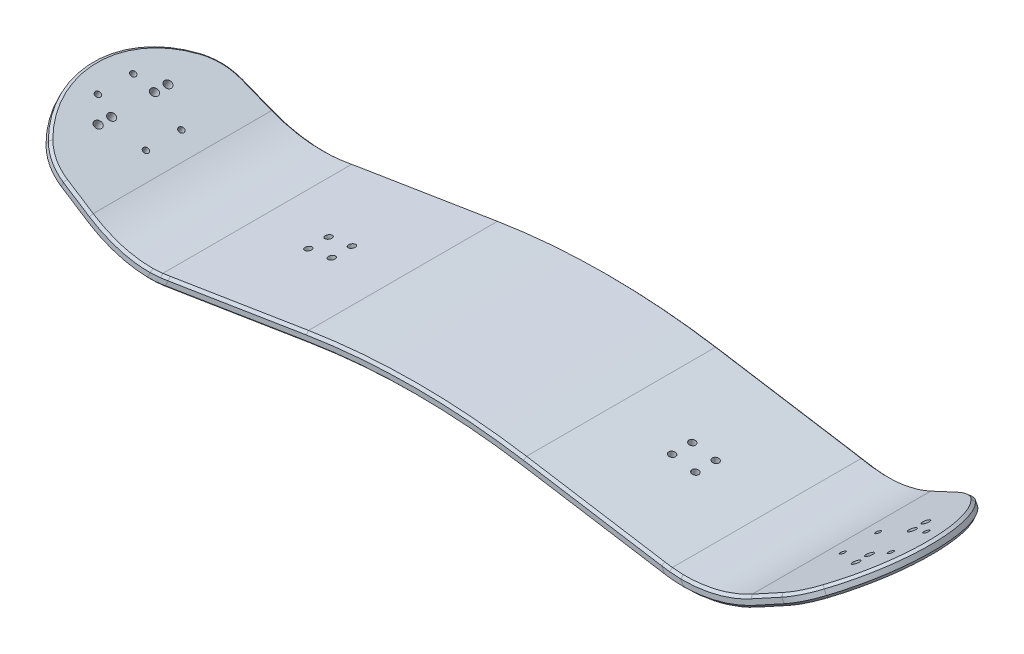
ISO-10303-21;
HEADER;
FILE_DESCRIPTION(('STEP AP214'),'2;1');
FILE_NAME('part.step','',(''),(''),'','','');
FILE_SCHEMA(('AUTOMOTIVE_DESIGN { 1 0 10303 214 1 1 1 1 }'));
ENDSEC;
DATA;
#1=APPLICATION_CONTEXT('core data for automotive mechanical design processes');
#2=APPLICATION_PROTOCOL_DEFINITION('international standard','automotive_design',2000,#1);
#3=PRODUCT_CONTEXT('',#1,'mechanical');
#4=PRODUCT('Part','Part','',(#3));
#5=PRODUCT_RELATED_PRODUCT_CATEGORY('part','',(#4));
#6=PRODUCT_DEFINITION_FORMATION('','',#4);
#7=PRODUCT_DEFINITION_CONTEXT('part definition',#1,'design');
#8=PRODUCT_DEFINITION('design','',#6,#7);
#9=PRODUCT_DEFINITION_SHAPE('','',#8);
#10=(LENGTH_UNIT() NAMED_UNIT(*) SI_UNIT(.MILLI.,.METRE.));
#11=(NAMED_UNIT(*) PLANE_ANGLE_UNIT() SI_UNIT($,.RADIAN.));
#12=(NAMED_UNIT(*) SI_UNIT($,.STERADIAN.) SOLID_ANGLE_UNIT());
#13=UNCERTAINTY_MEASURE_WITH_UNIT(LENGTH_MEASURE(1.E-05),#10,'distance_accuracy_value','');
#14=(GEOMETRIC_REPRESENTATION_CONTEXT(3) GLOBAL_UNCERTAINTY_ASSIGNED_CONTEXT((#13)) GLOBAL_UNIT_ASSIGNED_CONTEXT((#10,
#11,#12)) REPRESENTATION_CONTEXT('',''));
#15=CARTESIAN_POINT('',(0.,0.,0.));
#16=DIRECTION('',(0.,0.,1.));
#17=DIRECTION('',(1.,0.,0.));
#18=AXIS2_PLACEMENT_3D('',#15,#16,#17);
#19=CARTESIAN_POINT('',(-494.552114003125,80.6920782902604,115.));
#20=DIRECTION('',(-0.453990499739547,-0.891006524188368,0.));
#21=DIRECTION('',(0.891006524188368,-0.453990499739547,0.));
#22=AXIS2_PLACEMENT_3D('',#19,#20,#21);
#23=PLANE('',#22);
#24=CARTESIAN_POINT('',(-449.23731853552,57.6030367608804,-41.35));
#25=DIRECTION('',(0.453990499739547,0.891006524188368,0.));
#26=DIRECTION('',(-0.891006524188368,0.453990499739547,0.));
#27=AXIS2_PLACEMENT_3D('',#24,#25,#26);
#28=CIRCLE('',#27,4.49999999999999);
#29=CARTESIAN_POINT('',(-453.246847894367,59.6459940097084,-41.35));
#30=VERTEX_POINT('',#29);
#31=EDGE_CURVE('E3673',#30,#30,#28,.T.);
#32=ORIENTED_EDGE('',*,*,#31,.F.);
#33=EDGE_LOOP('',(#32));
#34=FACE_BOUND('',#33,.T.);
#35=CARTESIAN_POINT('',(-412.961769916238,39.1197215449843,21.));
#36=DIRECTION('',(0.453990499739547,0.891006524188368,0.));
#37=DIRECTION('',(-0.891006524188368,0.453990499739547,0.));
#38=AXIS2_PLACEMENT_3D('',#35,#36,#37);
#39=CIRCLE('',#38,3.29999999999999);
#40=CARTESIAN_POINT('',(-415.90209144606,40.6178901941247,21.));
#41=VERTEX_POINT('',#40);
#42=EDGE_CURVE('E1378',#41,#41,#39,.T.);
#43=ORIENTED_EDGE('',*,*,#42,.F.);
#44=EDGE_LOOP('',(#43));
#45=FACE_BOUND('',#44,.T.);
#46=DIRECTION('',(0.,0.,-1.));
#47=VECTOR('',#46,1.);
#48=CARTESIAN_POINT('',(-390.686606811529,27.7699590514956,115.));
#49=LINE('',#48,#47);
#50=CARTESIAN_POINT('',(-390.686606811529,27.7699590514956,105.753334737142));
#51=VERTEX_POINT('',#50);
#52=CARTESIAN_POINT('',(-390.686606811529,27.7699590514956,-105.753334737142));
#53=VERTEX_POINT('',#52);
#54=EDGE_CURVE('E1511',#51,#53,#49,.T.);
#55=ORIENTED_EDGE('',*,*,#54,.T.);
#56=DIRECTION('',(-0.888635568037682,0.452782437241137,0.0729033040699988));
#57=VECTOR('',#56,1.);
#58=CARTESIAN_POINT('',(-424.150347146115,44.8205863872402,-103.007982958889));
#59=LINE('',#58,#57);
#60=CARTESIAN_POINT('',(-424.150347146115,44.8205863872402,-103.00798295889));
#61=VERTEX_POINT('',#60);
#62=EDGE_CURVE('E11',#53,#61,#59,.T.);
#63=ORIENTED_EDGE('',*,*,#62,.T.);
#64=CARTESIAN_POINT('',(-420.122993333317,42.7685471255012,-41.1729641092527));
#65=DIRECTION('',(-0.453990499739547,-0.891006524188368,0.));
#66=DIRECTION('',(0.891006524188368,-0.453990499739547,0.));
#67=AXIS2_PLACEMENT_3D('',#64,#65,#66);
#68=CIRCLE('',#67,62.0000000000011);
#69=CARTESIAN_POINT('',(-456.749958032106,61.4309177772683,-87.5861236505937));
#70=VERTEX_POINT('',#69);
#71=EDGE_CURVE('E44',#61,#70,#68,.F.);
#72=ORIENTED_EDGE('',*,*,#71,.T.);
#73=CARTESIAN_POINT('',(-387.631331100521,26.2132183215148,0.));
#74=DIRECTION('',(-0.453990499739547,-0.891006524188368,0.));
#75=DIRECTION('',(0.891006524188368,-0.453990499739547,0.));
#76=AXIS2_PLACEMENT_3D('',#73,#74,#75);
#77=CIRCLE('',#76,117.000000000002);
#78=CARTESIAN_POINT('',(-456.749958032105,61.4309177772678,87.5861236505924));
#79=VERTEX_POINT('',#78);
#80=EDGE_CURVE('E2236',#70,#79,#77,.F.);
#81=ORIENTED_EDGE('',*,*,#80,.T.);
#82=CARTESIAN_POINT('',(-420.122993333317,42.7685471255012,41.1729641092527));
#83=DIRECTION('',(-0.453990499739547,-0.891006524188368,0.));
#84=DIRECTION('',(0.891006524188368,-0.453990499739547,0.));
#85=AXIS2_PLACEMENT_3D('',#82,#83,#84);
#86=CIRCLE('',#85,62.0000000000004);
#87=CARTESIAN_POINT('',(-424.150347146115,44.8205863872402,103.007982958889));
#88=VERTEX_POINT('',#87);
#89=EDGE_CURVE('E2232',#79,#88,#86,.F.);
#90=ORIENTED_EDGE('',*,*,#89,.T.);
#91=DIRECTION('',(0.888635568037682,-0.452782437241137,0.0729033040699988));
#92=VECTOR('',#91,1.);
#93=CARTESIAN_POINT('',(-390.491734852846,27.6706668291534,105.769321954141));
#94=LINE('',#93,#92);
#95=EDGE_CURVE('E2228',#88,#51,#94,.T.);
#96=ORIENTED_EDGE('',*,*,#95,.T.);
#97=EDGE_LOOP('',(#55,#63,#72,#81,#90,#96));
#98=FACE_BOUND('',#97,.T.);
#99=CARTESIAN_POINT('',(-412.961769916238,39.1197215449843,-21.));
#100=DIRECTION('',(0.453990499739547,0.891006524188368,0.));
#101=DIRECTION('',(-0.891006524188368,0.453990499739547,0.));
#102=AXIS2_PLACEMENT_3D('',#99,#100,#101);
#103=CIRCLE('',#102,3.29999999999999);
#104=CARTESIAN_POINT('',(-415.90209144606,40.6178901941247,-21.));
#105=VERTEX_POINT('',#104);
#106=EDGE_CURVE('E1396',#105,#105,#103,.T.);
#107=ORIENTED_EDGE('',*,*,#106,.F.);
#108=EDGE_LOOP('',(#107));
#109=FACE_BOUND('',#108,.T.);
#110=CARTESIAN_POINT('',(-469.986187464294,68.1751135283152,-21.));
#111=DIRECTION('',(0.453990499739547,0.891006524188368,0.));
#112=DIRECTION('',(-0.891006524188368,0.453990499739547,0.));
#113=AXIS2_PLACEMENT_3D('',#110,#111,#112);
#114=CIRCLE('',#113,3.29999999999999);
#115=CARTESIAN_POINT('',(-472.926508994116,69.6732821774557,-21.));
#116=VERTEX_POINT('',#115);
#117=EDGE_CURVE('E1377',#116,#116,#114,.T.);
#118=ORIENTED_EDGE('',*,*,#117,.F.);
#119=EDGE_LOOP('',(#118));
#120=FACE_BOUND('',#119,.T.);
#121=CARTESIAN_POINT('',(-469.986187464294,68.1751135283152,21.));
#122=DIRECTION('',(0.453990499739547,0.891006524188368,0.));
#123=DIRECTION('',(-0.891006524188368,0.453990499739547,0.));
#124=AXIS2_PLACEMENT_3D('',#121,#122,#123);
#125=CIRCLE('',#124,3.29999999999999);
#126=CARTESIAN_POINT('',(-472.926508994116,69.6732821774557,21.));
#127=VERTEX_POINT('',#126);
#128=EDGE_CURVE('E1390',#127,#127,#125,.T.);
#129=ORIENTED_EDGE('',*,*,#128,.F.);
#130=EDGE_LOOP('',(#129));
#131=FACE_BOUND('',#130,.T.);
#132=CARTESIAN_POINT('',(-449.23731853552,57.6030367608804,25.35));
#133=DIRECTION('',(0.453990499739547,0.891006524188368,0.));
#134=DIRECTION('',(-0.891006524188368,0.453990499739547,0.));
#135=AXIS2_PLACEMENT_3D('',#132,#133,#134);
#136=CIRCLE('',#135,4.49999999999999);
#137=CARTESIAN_POINT('',(-453.246847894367,59.6459940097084,25.35));
#138=VERTEX_POINT('',#137);
#139=EDGE_CURVE('E3684',#138,#138,#136,.T.);
#140=ORIENTED_EDGE('',*,*,#139,.F.);
#141=EDGE_LOOP('',(#140));
#142=FACE_BOUND('',#141,.T.);
#143=CARTESIAN_POINT('',(-449.23731853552,57.6030367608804,41.35));
#144=DIRECTION('',(0.453990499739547,0.891006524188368,0.));
#145=DIRECTION('',(-0.891006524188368,0.453990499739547,0.));
#146=AXIS2_PLACEMENT_3D('',#143,#144,#145);
#147=CIRCLE('',#146,4.49999999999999);
#148=CARTESIAN_POINT('',(-453.246847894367,59.6459940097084,41.35));
#149=VERTEX_POINT('',#148);
#150=EDGE_CURVE('E3681',#149,#149,#147,.T.);
#151=ORIENTED_EDGE('',*,*,#150,.F.);
#152=EDGE_LOOP('',(#151));
#153=FACE_BOUND('',#152,.T.);
#154=CARTESIAN_POINT('',(-449.23731853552,57.6030367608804,-25.35));
#155=DIRECTION('',(0.453990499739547,0.891006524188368,0.));
#156=DIRECTION('',(-0.891006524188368,0.453990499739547,0.));
#157=AXIS2_PLACEMENT_3D('',#154,#155,#156);
#158=CIRCLE('',#157,4.49999999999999);
#159=CARTESIAN_POINT('',(-453.246847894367,59.6459940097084,-25.35));
#160=VERTEX_POINT('',#159);
#161=EDGE_CURVE('E3670',#160,#160,#158,.T.);
#162=ORIENTED_EDGE('',*,*,#161,.F.);
#163=EDGE_LOOP('',(#162));
#164=FACE_BOUND('',#163,.T.);
#165=ADVANCED_FACE('F35',(#34,#45,#98,#109,#120,#131,#142,#153,#164),#23,.F.);
#166=CARTESIAN_POINT('',(494.552114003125,80.6920782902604,115.));
#167=DIRECTION('',(0.453990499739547,-0.891006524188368,0.));
#168=DIRECTION('',(0.891006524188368,0.453990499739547,0.));
#169=AXIS2_PLACEMENT_3D('',#166,#167,#168);
#170=PLANE('',#169);
#171=CARTESIAN_POINT('',(412.961769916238,39.1197215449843,21.));
#172=DIRECTION('',(-0.453990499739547,0.891006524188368,0.));
#173=DIRECTION('',(-0.891006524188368,-0.453990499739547,0.));
#174=AXIS2_PLACEMENT_3D('',#171,#172,#173);
#175=CIRCLE('',#174,3.29999999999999);
#176=CARTESIAN_POINT('',(410.021448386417,37.6215528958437,21.));
#177=VERTEX_POINT('',#176);
#178=EDGE_CURVE('E1370',#177,#177,#175,.T.);
#179=ORIENTED_EDGE('',*,*,#178,.F.);
#180=EDGE_LOOP('',(#179));
#181=FACE_BOUND('',#180,.T.);
#182=CARTESIAN_POINT('',(469.986187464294,68.1751135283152,-21.));
#183=DIRECTION('',(-0.453990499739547,0.891006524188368,0.));
#184=DIRECTION('',(-0.891006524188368,-0.453990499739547,0.));
#185=AXIS2_PLACEMENT_3D('',#182,#183,#184);
#186=CIRCLE('',#185,3.29999999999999);
#187=CARTESIAN_POINT('',(467.045865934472,66.6769448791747,-21.));
#188=VERTEX_POINT('',#187);
#189=EDGE_CURVE('E1369',#188,#188,#186,.T.);
#190=ORIENTED_EDGE('',*,*,#189,.F.);
#191=EDGE_LOOP('',(#190));
#192=FACE_BOUND('',#191,.T.);
#193=CARTESIAN_POINT('',(412.961769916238,39.1197215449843,-21.));
#194=DIRECTION('',(-0.453990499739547,0.891006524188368,0.));
#195=DIRECTION('',(-0.891006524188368,-0.453990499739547,0.));
#196=AXIS2_PLACEMENT_3D('',#193,#194,#195);
#197=CIRCLE('',#196,3.29999999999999);
#198=CARTESIAN_POINT('',(410.021448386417,37.6215528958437,-21.));
#199=VERTEX_POINT('',#198);
#200=EDGE_CURVE('E1434',#199,#199,#197,.T.);
#201=ORIENTED_EDGE('',*,*,#200,.F.);
#202=EDGE_LOOP('',(#201));
#203=FACE_BOUND('',#202,.T.);
#204=CARTESIAN_POINT('',(420.122993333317,42.7685471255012,-41.1729641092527));
#205=DIRECTION('',(0.453990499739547,-0.891006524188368,0.));
#206=DIRECTION('',(0.891006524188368,0.453990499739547,0.));
#207=AXIS2_PLACEMENT_3D('',#204,#205,#206);
#208=CIRCLE('',#207,62.);
#209=CARTESIAN_POINT('',(456.749958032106,61.4309177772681,-87.5861236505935));
#210=VERTEX_POINT('',#209);
#211=CARTESIAN_POINT('',(424.150347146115,44.8205863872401,-103.007982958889));
#212=VERTEX_POINT('',#211);
#213=EDGE_CURVE('E2224',#210,#212,#208,.F.);
#214=ORIENTED_EDGE('',*,*,#213,.T.);
#215=DIRECTION('',(-0.888635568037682,-0.452782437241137,-0.0729033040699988));
#216=VECTOR('',#215,1.);
#217=CARTESIAN_POINT('',(508.301467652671,87.6977238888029,-96.104258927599));
#218=LINE('',#217,#216);
#219=CARTESIAN_POINT('',(390.686606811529,27.7699590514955,-105.753334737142));
#220=VERTEX_POINT('',#219);
#221=EDGE_CURVE('E2226',#212,#220,#218,.T.);
#222=ORIENTED_EDGE('',*,*,#221,.T.);
#223=DIRECTION('',(0.,0.,-1.));
#224=VECTOR('',#223,1.);
#225=CARTESIAN_POINT('',(390.686606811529,27.7699590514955,115.));
#226=LINE('',#225,#224);
#227=CARTESIAN_POINT('',(390.686606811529,27.7699590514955,105.753334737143));
#228=VERTEX_POINT('',#227);
#229=EDGE_CURVE('E1658',#228,#220,#226,.T.);
#230=ORIENTED_EDGE('',*,*,#229,.F.);
#231=DIRECTION('',(0.888635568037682,0.452782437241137,-0.0729033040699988));
#232=VECTOR('',#231,1.);
#233=CARTESIAN_POINT('',(493.401039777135,80.1055766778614,97.3266840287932));
#234=LINE('',#233,#232);
#235=CARTESIAN_POINT('',(424.150347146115,44.8205863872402,103.007982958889));
#236=VERTEX_POINT('',#235);
#237=EDGE_CURVE('E1584',#228,#236,#234,.T.);
#238=ORIENTED_EDGE('',*,*,#237,.T.);
#239=CARTESIAN_POINT('',(420.122993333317,42.7685471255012,41.1729641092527));
#240=DIRECTION('',(0.453990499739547,-0.891006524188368,0.));
#241=DIRECTION('',(0.891006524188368,0.453990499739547,0.));
#242=AXIS2_PLACEMENT_3D('',#239,#240,#241);
#243=CIRCLE('',#242,62.0000000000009);
#244=CARTESIAN_POINT('',(456.749958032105,61.4309177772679,87.5861236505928));
#245=VERTEX_POINT('',#244);
#246=EDGE_CURVE('E2217',#236,#245,#243,.F.);
#247=ORIENTED_EDGE('',*,*,#246,.T.);
#248=CARTESIAN_POINT('',(387.631331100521,26.2132183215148,0.));
#249=DIRECTION('',(0.453990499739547,-0.891006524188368,0.));
#250=DIRECTION('',(0.891006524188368,0.453990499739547,0.));
#251=AXIS2_PLACEMENT_3D('',#248,#249,#250);
#252=CIRCLE('',#251,117.000000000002);
#253=EDGE_CURVE('E2218',#245,#210,#252,.F.);
#254=ORIENTED_EDGE('',*,*,#253,.T.);
#255=EDGE_LOOP('',(#214,#222,#230,#238,#247,#254));
#256=FACE_BOUND('',#255,.T.);
#257=CARTESIAN_POINT('',(469.986187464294,68.1751135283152,21.));
#258=DIRECTION('',(-0.453990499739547,0.891006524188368,0.));
#259=DIRECTION('',(-0.891006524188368,-0.453990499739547,0.));
#260=AXIS2_PLACEMENT_3D('',#257,#258,#259);
#261=CIRCLE('',#260,3.29999999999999);
#262=CARTESIAN_POINT('',(467.045865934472,66.6769448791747,21.));
#263=VERTEX_POINT('',#262);
#264=EDGE_CURVE('E1373',#263,#263,#261,.T.);
#265=ORIENTED_EDGE('',*,*,#264,.F.);
#266=EDGE_LOOP('',(#265));
#267=FACE_BOUND('',#266,.T.);
#268=CARTESIAN_POINT('',(449.23731853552,57.6030367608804,25.35));
#269=DIRECTION('',(-0.453990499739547,0.891006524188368,0.));
#270=DIRECTION('',(-0.891006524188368,-0.453990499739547,0.));
#271=AXIS2_PLACEMENT_3D('',#268,#269,#270);
#272=CIRCLE('',#271,4.49999999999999);
#273=CARTESIAN_POINT('',(445.227789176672,55.5600795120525,25.35));
#274=VERTEX_POINT('',#273);
#275=EDGE_CURVE('E1374',#274,#274,#272,.T.);
#276=ORIENTED_EDGE('',*,*,#275,.F.);
#277=EDGE_LOOP('',(#276));
#278=FACE_BOUND('',#277,.T.);
#279=CARTESIAN_POINT('',(449.23731853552,57.6030367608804,41.35));
#280=DIRECTION('',(-0.453990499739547,0.891006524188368,0.));
#281=DIRECTION('',(-0.891006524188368,-0.453990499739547,0.));
#282=AXIS2_PLACEMENT_3D('',#279,#280,#281);
#283=CIRCLE('',#282,4.49999999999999);
#284=CARTESIAN_POINT('',(445.227789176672,55.5600795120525,41.35));
#285=VERTEX_POINT('',#284);
#286=EDGE_CURVE('E1414',#285,#285,#283,.T.);
#287=ORIENTED_EDGE('',*,*,#286,.F.);
#288=EDGE_LOOP('',(#287));
#289=FACE_BOUND('',#288,.T.);
#290=CARTESIAN_POINT('',(449.23731853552,57.6030367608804,-41.35));
#291=DIRECTION('',(-0.453990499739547,0.891006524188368,0.));
#292=DIRECTION('',(-0.891006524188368,-0.453990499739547,0.));
#293=AXIS2_PLACEMENT_3D('',#290,#291,#292);
#294=CIRCLE('',#293,4.49999999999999);
#295=CARTESIAN_POINT('',(445.227789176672,55.5600795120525,-41.35));
#296=VERTEX_POINT('',#295);
#297=EDGE_CURVE('E1408',#296,#296,#294,.T.);
#298=ORIENTED_EDGE('',*,*,#297,.F.);
#299=EDGE_LOOP('',(#298));
#300=FACE_BOUND('',#299,.T.);
#301=CARTESIAN_POINT('',(449.23731853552,57.6030367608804,-25.35));
#302=DIRECTION('',(-0.453990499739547,0.891006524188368,0.));
#303=DIRECTION('',(-0.891006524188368,-0.453990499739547,0.));
#304=AXIS2_PLACEMENT_3D('',#301,#302,#303);
#305=CIRCLE('',#304,4.49999999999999);
#306=CARTESIAN_POINT('',(445.227789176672,55.5600795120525,-25.35));
#307=VERTEX_POINT('',#306);
#308=EDGE_CURVE('E1402',#307,#307,#305,.T.);
#309=ORIENTED_EDGE('',*,*,#308,.F.);
#310=EDGE_LOOP('',(#309));
#311=FACE_BOUND('',#310,.T.);
#312=ADVANCED_FACE('F2631',(#181,#192,#203,#256,#267,#278,#289,#300,#311),#170,.F.);
#313=CARTESIAN_POINT('',(-500.,70.,115.));
#314=DIRECTION('',(-0.453990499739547,-0.891006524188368,0.));
#315=DIRECTION('',(0.891006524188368,-0.453990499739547,0.));
#316=AXIS2_PLACEMENT_3D('',#313,#314,#315);
#317=PLANE('',#316);
#318=CARTESIAN_POINT('',(-454.685204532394,46.91095847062,-25.35));
#319=DIRECTION('',(-0.453990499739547,-0.891006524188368,0.));
#320=DIRECTION('',(0.891006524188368,-0.453990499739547,0.));
#321=AXIS2_PLACEMENT_3D('',#318,#319,#320);
#322=CIRCLE('',#321,4.49999999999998);
#323=CARTESIAN_POINT('',(-450.675675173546,44.868001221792,-25.35));
#324=VERTEX_POINT('',#323);
#325=EDGE_CURVE('E3667',#324,#324,#322,.T.);
#326=ORIENTED_EDGE('',*,*,#325,.F.);
#327=EDGE_LOOP('',(#326));
#328=FACE_BOUND('',#327,.T.);
#329=CARTESIAN_POINT('',(-454.685204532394,46.91095847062,-41.35));
#330=DIRECTION('',(-0.453990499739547,-0.891006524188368,0.));
#331=DIRECTION('',(0.891006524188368,-0.453990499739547,0.));
#332=AXIS2_PLACEMENT_3D('',#329,#330,#331);
#333=CIRCLE('',#332,4.49999999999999);
#334=CARTESIAN_POINT('',(-450.675675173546,44.868001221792,-41.35));
#335=VERTEX_POINT('',#334);
#336=EDGE_CURVE('E3678',#335,#335,#333,.T.);
#337=ORIENTED_EDGE('',*,*,#336,.F.);
#338=EDGE_LOOP('',(#337));
#339=FACE_BOUND('',#338,.T.);
#340=CARTESIAN_POINT('',(-454.685204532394,46.91095847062,41.35));
#341=DIRECTION('',(-0.453990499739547,-0.891006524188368,0.));
#342=DIRECTION('',(0.891006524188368,-0.453990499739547,0.));
#343=AXIS2_PLACEMENT_3D('',#340,#341,#342);
#344=CIRCLE('',#343,4.49999999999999);
#345=CARTESIAN_POINT('',(-450.675675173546,44.868001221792,41.35));
#346=VERTEX_POINT('',#345);
#347=EDGE_CURVE('E39',#346,#346,#344,.T.);
#348=ORIENTED_EDGE('',*,*,#347,.F.);
#349=EDGE_LOOP('',(#348));
#350=FACE_BOUND('',#349,.T.);
#351=CARTESIAN_POINT('',(-454.685204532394,46.91095847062,25.35));
#352=DIRECTION('',(-0.453990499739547,-0.891006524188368,0.));
#353=DIRECTION('',(0.891006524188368,-0.453990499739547,0.));
#354=AXIS2_PLACEMENT_3D('',#351,#352,#353);
#355=CIRCLE('',#354,4.49999999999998);
#356=CARTESIAN_POINT('',(-450.675675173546,44.868001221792,25.35));
#357=VERTEX_POINT('',#356);
#358=EDGE_CURVE('E3687',#357,#357,#355,.T.);
#359=ORIENTED_EDGE('',*,*,#358,.F.);
#360=EDGE_LOOP('',(#359));
#361=FACE_BOUND('',#360,.T.);
#362=CARTESIAN_POINT('',(-475.434073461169,57.4830352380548,21.));
#363=DIRECTION('',(-0.453990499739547,-0.891006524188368,0.));
#364=DIRECTION('',(0.891006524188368,-0.453990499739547,0.));
#365=AXIS2_PLACEMENT_3D('',#362,#363,#364);
#366=CIRCLE('',#365,3.29999999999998);
#367=CARTESIAN_POINT('',(-472.493751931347,55.9848665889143,21.));
#368=VERTEX_POINT('',#367);
#369=EDGE_CURVE('E1385',#368,#368,#366,.T.);
#370=ORIENTED_EDGE('',*,*,#369,.F.);
#371=EDGE_LOOP('',(#370));
#372=FACE_BOUND('',#371,.T.);
#373=CARTESIAN_POINT('',(-418.409655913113,28.4276432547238,21.));
#374=DIRECTION('',(-0.453990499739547,-0.891006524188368,0.));
#375=DIRECTION('',(0.891006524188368,-0.453990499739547,0.));
#376=AXIS2_PLACEMENT_3D('',#373,#374,#375);
#377=CIRCLE('',#376,3.29999999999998);
#378=CARTESIAN_POINT('',(-415.469334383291,26.9294746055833,21.));
#379=VERTEX_POINT('',#378);
#380=EDGE_CURVE('E1375',#379,#379,#377,.T.);
#381=ORIENTED_EDGE('',*,*,#380,.F.);
#382=EDGE_LOOP('',(#381));
#383=FACE_BOUND('',#382,.T.);
#384=CARTESIAN_POINT('',(-475.434073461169,57.4830352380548,-21.));
#385=DIRECTION('',(-0.453990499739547,-0.891006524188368,0.));
#386=DIRECTION('',(0.891006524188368,-0.453990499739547,0.));
#387=AXIS2_PLACEMENT_3D('',#384,#385,#386);
#388=CIRCLE('',#387,3.29999999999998);
#389=CARTESIAN_POINT('',(-472.493751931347,55.9848665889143,-21.));
#390=VERTEX_POINT('',#389);
#391=EDGE_CURVE('E1382',#390,#390,#388,.T.);
#392=ORIENTED_EDGE('',*,*,#391,.F.);
#393=EDGE_LOOP('',(#392));
#394=FACE_BOUND('',#393,.T.);
#395=CARTESIAN_POINT('',(-418.409655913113,28.4276432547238,-21.));
#396=DIRECTION('',(-0.453990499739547,-0.891006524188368,0.));
#397=DIRECTION('',(0.891006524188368,-0.453990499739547,0.));
#398=AXIS2_PLACEMENT_3D('',#395,#396,#397);
#399=CIRCLE('',#398,3.29999999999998);
#400=CARTESIAN_POINT('',(-415.469334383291,26.9294746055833,-21.));
#401=VERTEX_POINT('',#400);
#402=EDGE_CURVE('E1399',#401,#401,#399,.T.);
#403=ORIENTED_EDGE('',*,*,#402,.F.);
#404=EDGE_LOOP('',(#403));
#405=FACE_BOUND('',#404,.T.);
#406=CARTESIAN_POINT('',(-425.570879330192,32.0764688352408,-41.1729641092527));
#407=DIRECTION('',(-0.453990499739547,-0.891006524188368,0.));
#408=DIRECTION('',(0.891006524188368,-0.453990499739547,0.));
#409=AXIS2_PLACEMENT_3D('',#406,#407,#408);
#410=CIRCLE('',#409,62.0000000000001);
#411=CARTESIAN_POINT('',(-462.197844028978,50.7388394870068,-87.5861236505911));
#412=VERTEX_POINT('',#411);
#413=CARTESIAN_POINT('',(-429.59823314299,34.1285080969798,-103.007982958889));
#414=VERTEX_POINT('',#413);
#415=EDGE_CURVE('E2289',#412,#414,#410,.T.);
#416=ORIENTED_EDGE('',*,*,#415,.T.);
#417=DIRECTION('',(0.888635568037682,-0.452782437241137,-0.0729033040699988));
#418=VECTOR('',#417,1.);
#419=CARTESIAN_POINT('',(-513.749353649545,77.0056455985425,-96.1042589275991));
#420=LINE('',#419,#418);
#421=CARTESIAN_POINT('',(-396.134492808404,17.0778807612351,-105.753334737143));
#422=VERTEX_POINT('',#421);
#423=EDGE_CURVE('E2291',#414,#422,#420,.T.);
#424=ORIENTED_EDGE('',*,*,#423,.T.);
#425=DIRECTION('',(0.,0.,-1.));
#426=VECTOR('',#425,1.);
#427=CARTESIAN_POINT('',(-396.134492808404,17.0778807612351,115.));
#428=LINE('',#427,#426);
#429=CARTESIAN_POINT('',(-396.134492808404,17.0778807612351,105.753334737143));
#430=VERTEX_POINT('',#429);
#431=EDGE_CURVE('E1793',#430,#422,#428,.T.);
#432=ORIENTED_EDGE('',*,*,#431,.F.);
#433=DIRECTION('',(-0.888635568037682,0.452782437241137,-0.0729033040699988));
#434=VECTOR('',#433,1.);
#435=CARTESIAN_POINT('',(-498.84892577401,69.413498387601,97.3266840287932));
#436=LINE('',#435,#434);
#437=CARTESIAN_POINT('',(-429.59823314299,34.1285080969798,103.007982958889));
#438=VERTEX_POINT('',#437);
#439=EDGE_CURVE('E2279',#430,#438,#436,.T.);
#440=ORIENTED_EDGE('',*,*,#439,.T.);
#441=CARTESIAN_POINT('',(-425.570879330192,32.0764688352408,41.1729641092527));
#442=DIRECTION('',(-0.453990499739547,-0.891006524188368,0.));
#443=DIRECTION('',(0.891006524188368,-0.453990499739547,0.));
#444=AXIS2_PLACEMENT_3D('',#441,#442,#443);
#445=CIRCLE('',#444,62.0000000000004);
#446=CARTESIAN_POINT('',(-462.19784402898,50.7388394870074,87.5861236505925));
#447=VERTEX_POINT('',#446);
#448=EDGE_CURVE('E2283',#438,#447,#445,.T.);
#449=ORIENTED_EDGE('',*,*,#448,.T.);
#450=CARTESIAN_POINT('',(-393.079217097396,15.5211400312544,0.));
#451=DIRECTION('',(-0.453990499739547,-0.891006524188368,0.));
#452=DIRECTION('',(0.891006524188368,-0.453990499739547,0.));
#453=AXIS2_PLACEMENT_3D('',#450,#451,#452);
#454=CIRCLE('',#453,116.999999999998);
#455=EDGE_CURVE('E2287',#447,#412,#454,.T.);
#456=ORIENTED_EDGE('',*,*,#455,.T.);
#457=EDGE_LOOP('',(#416,#424,#432,#440,#449,#456));
#458=FACE_BOUND('',#457,.T.);
#459=ADVANCED_FACE('F1822',(#328,#339,#350,#361,#372,#383,#394,#405,#458),#317,.T.);
#460=CARTESIAN_POINT('',(-325.,156.687183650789,115.));
#461=DIRECTION('',(0.,0.,-1.));
#462=DIRECTION('',(-1.,0.,0.));
#463=AXIS2_PLACEMENT_3D('',#460,#461,#462);
#464=CYLINDRICAL_SURFACE('',#463,156.687183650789);
#465=CARTESIAN_POINT('',(-317.244744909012,0.192041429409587,-111.34273638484));
#466=CARTESIAN_POINT('',(-344.415699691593,-1.18784708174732,-109.651873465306));
#467=CARTESIAN_POINT('',(-371.908961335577,4.69690741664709,-107.703953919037));
#468=CARTESIAN_POINT('',(-396.134492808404,17.0778807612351,-105.753334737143));
#469=B_SPLINE_CURVE_WITH_KNOTS('',3,(#465,#466,#467,#468),.UNSPECIFIED.,.F.,.F.,(4,4),
(1.05004205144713,1.5707963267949),.UNSPECIFIED.);
#470=CARTESIAN_POINT('',(-317.244744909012,0.192041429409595,-111.34273638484));
#471=VERTEX_POINT('',#470);
#472=EDGE_CURVE('E1844',#422,#471,#469,.F.);
#473=ORIENTED_EDGE('',*,*,#472,.T.);
#474=CARTESIAN_POINT('',(-300.089477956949,1.99284176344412,-111.97051745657));
#475=CARTESIAN_POINT('',(-305.780015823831,1.07669117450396,-111.899915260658));
#476=CARTESIAN_POINT('',(-311.498869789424,0.476980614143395,-111.700468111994));
#477=CARTESIAN_POINT('',(-317.244744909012,0.192041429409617,-111.34273638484));
#478=B_SPLINE_CURVE_WITH_KNOTS('',3,(#474,#475,#476,#477),.UNSPECIFIED.,.F.,.F.,(4,4),(0.,
0.0169308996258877),.UNSPECIFIED.);
#479=CARTESIAN_POINT('',(-300.089477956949,1.99284176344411,-111.97051745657));
#480=VERTEX_POINT('',#479);
#481=EDGE_CURVE('E1852',#471,#480,#478,.F.);
#482=ORIENTED_EDGE('',*,*,#481,.T.);
#483=DIRECTION('',(0.,0.,-1.));
#484=VECTOR('',#483,1.);
#485=CARTESIAN_POINT('',(-300.089477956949,1.99284176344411,115.));
#486=LINE('',#485,#484);
#487=CARTESIAN_POINT('',(-300.089477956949,1.99284176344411,111.97051745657));
#488=VERTEX_POINT('',#487);
#489=EDGE_CURVE('E1789',#488,#480,#486,.T.);
#490=ORIENTED_EDGE('',*,*,#489,.F.);
#491=CARTESIAN_POINT('',(-317.244744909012,0.192041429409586,111.34273638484));
#492=CARTESIAN_POINT('',(-311.498869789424,0.476980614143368,111.700468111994));
#493=CARTESIAN_POINT('',(-305.780015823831,1.07669117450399,111.899915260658));
#494=CARTESIAN_POINT('',(-300.089477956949,1.99284176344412,111.97051745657));
#495=B_SPLINE_CURVE_WITH_KNOTS('',3,(#491,#492,#493,#494),.UNSPECIFIED.,.F.,.F.,(4,4),(0.,
0.0169308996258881),.UNSPECIFIED.);
#496=CARTESIAN_POINT('',(-317.244744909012,0.192041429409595,111.34273638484));
#497=VERTEX_POINT('',#496);
#498=EDGE_CURVE('E1732',#488,#497,#495,.F.);
#499=ORIENTED_EDGE('',*,*,#498,.T.);
#500=CARTESIAN_POINT('',(-396.134492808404,17.0778807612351,105.753334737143));
#501=CARTESIAN_POINT('',(-371.908961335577,4.6969074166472,107.703953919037));
#502=CARTESIAN_POINT('',(-344.415699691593,-1.18784708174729,109.651873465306));
#503=CARTESIAN_POINT('',(-317.244744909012,0.192041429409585,111.34273638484));
#504=B_SPLINE_CURVE_WITH_KNOTS('',3,(#500,#501,#502,#503),.UNSPECIFIED.,.F.,.F.,(4,4),
(1.5707963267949,2.09155060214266),.UNSPECIFIED.);
#505=EDGE_CURVE('E2547',#497,#430,#504,.F.);
#506=ORIENTED_EDGE('',*,*,#505,.T.);
#507=ORIENTED_EDGE('',*,*,#431,.T.);
#508=EDGE_LOOP('',(#473,#482,#490,#499,#506,#507));
#509=FACE_BOUND('',#508,.T.);
#510=ADVANCED_FACE('F1545',(#509),#464,.T.);
#511=CARTESIAN_POINT('',(-325.,156.687183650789,115.));
#512=DIRECTION('',(0.,0.,-1.));
#513=DIRECTION('',(-1.,0.,0.));
#514=AXIS2_PLACEMENT_3D('',#511,#512,#513);
#515=CYLINDRICAL_SURFACE('',#514,144.687183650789);
#516=DIRECTION('',(0.,0.,-1.));
#517=VECTOR('',#516,1.);
#518=CARTESIAN_POINT('',(-301.997268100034,13.8402185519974,115.));
#519=LINE('',#518,#517);
#520=CARTESIAN_POINT('',(-301.997268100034,13.8402185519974,111.883525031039));
#521=VERTEX_POINT('',#520);
#522=CARTESIAN_POINT('',(-301.997268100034,13.8402185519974,-111.890456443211));
#523=VERTEX_POINT('',#522);
#524=EDGE_CURVE('E1519',#521,#523,#519,.T.);
#525=ORIENTED_EDGE('',*,*,#524,.T.);
#526=CARTESIAN_POINT('',(-314.450500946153,12.3851074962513,-111.34273638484));
#527=CARTESIAN_POINT('',(-310.281920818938,12.6899297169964,-111.609521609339));
#528=CARTESIAN_POINT('',(-306.130622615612,13.1746925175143,-111.787628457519));
#529=CARTESIAN_POINT('',(-301.997268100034,13.8402185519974,-111.890456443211));
#530=B_SPLINE_CURVE_WITH_KNOTS('',3,(#526,#527,#528,#529),.UNSPECIFIED.,.F.,.F.,(4,4),(0.,
0.0128096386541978),.UNSPECIFIED.);
#531=CARTESIAN_POINT('',(-314.450500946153,12.3851074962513,-111.34273638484));
#532=VERTEX_POINT('',#531);
#533=EDGE_CURVE('E1578',#523,#532,#530,.F.);
#534=ORIENTED_EDGE('',*,*,#533,.T.);
#535=CARTESIAN_POINT('',(-390.686606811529,27.7699590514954,-105.753334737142));
#536=CARTESIAN_POINT('',(-367.309344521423,15.8175105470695,-107.712355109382));
#537=CARTESIAN_POINT('',(-340.633536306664,10.4341905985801,-109.668145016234));
#538=CARTESIAN_POINT('',(-314.450500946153,12.3851074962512,-111.34273638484));
#539=B_SPLINE_CURVE_WITH_KNOTS('',3,(#535,#536,#537,#538),.UNSPECIFIED.,.F.,.F.,(4,4),
(1.02658020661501,1.5707963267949),.UNSPECIFIED.);
#540=EDGE_CURVE('E1569',#532,#53,#539,.F.);
#541=ORIENTED_EDGE('',*,*,#540,.T.);
#542=ORIENTED_EDGE('',*,*,#54,.F.);
#543=CARTESIAN_POINT('',(-314.450500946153,12.3851074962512,111.34273638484));
#544=CARTESIAN_POINT('',(-340.633536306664,10.4341905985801,109.668145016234));
#545=CARTESIAN_POINT('',(-367.309344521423,15.8175105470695,107.712355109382));
#546=CARTESIAN_POINT('',(-390.686606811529,27.7699590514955,105.753334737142));
#547=B_SPLINE_CURVE_WITH_KNOTS('',3,(#543,#544,#545,#546),.UNSPECIFIED.,.F.,.F.,(4,4),
(1.5707963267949,2.11501244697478),.UNSPECIFIED.);
#548=CARTESIAN_POINT('',(-314.450500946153,12.3851074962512,111.34273638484));
#549=VERTEX_POINT('',#548);
#550=EDGE_CURVE('E1596',#51,#549,#547,.F.);
#551=ORIENTED_EDGE('',*,*,#550,.T.);
#552=CARTESIAN_POINT('',(-301.997268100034,13.8402185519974,111.890456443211));
#553=CARTESIAN_POINT('',(-306.130622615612,13.1746925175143,111.787628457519));
#554=CARTESIAN_POINT('',(-310.281920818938,12.6899297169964,111.609521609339));
#555=CARTESIAN_POINT('',(-314.450500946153,12.3851074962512,111.34273638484));
#556=B_SPLINE_CURVE_WITH_KNOTS('',3,(#552,#553,#554,#555),.UNSPECIFIED.,.F.,.F.,(4,4),(0.,
0.012809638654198),.UNSPECIFIED.);
#557=EDGE_CURVE('E1527',#549,#521,#556,.F.);
#558=ORIENTED_EDGE('',*,*,#557,.T.);
#559=EDGE_LOOP('',(#525,#534,#541,#542,#551,#558));
#560=FACE_BOUND('',#559,.T.);
#561=ADVANCED_FACE('F1534',(#560),#515,.F.);
#562=CARTESIAN_POINT('',(-325.,156.687183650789,115.));
#563=DIRECTION('',(0.,0.,-1.));
#564=DIRECTION('',(-1.,0.,0.));
#565=AXIS2_PLACEMENT_3D('',#562,#563,#564);
#566=PLANE('',#565);
#567=CARTESIAN_POINT('',(0.,-760.812816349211,115.));
#568=DIRECTION('',(0.,0.,-1.));
#569=DIRECTION('',(-1.,0.,0.));
#570=AXIS2_PLACEMENT_3D('',#567,#568,#569);
#571=CIRCLE('',#570,803.812816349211);
#572=CARTESIAN_POINT('',(-127.792180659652,32.7766255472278,115.));
#573=VERTEX_POINT('',#572);
#574=CARTESIAN_POINT('',(127.792180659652,32.7766255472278,115.));
#575=VERTEX_POINT('',#574);
#576=EDGE_CURVE('E2022',#573,#575,#571,.T.);
#577=ORIENTED_EDGE('',*,*,#576,.T.);
#578=DIRECTION('',(0.987281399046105,-0.158982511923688,0.));
#579=VECTOR('',#578,1.);
#580=CARTESIAN_POINT('',(298.064159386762,5.35762736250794,115.));
#581=LINE('',#580,#579);
#582=CARTESIAN_POINT('',(295.900554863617,5.70603388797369,115.));
#583=VERTEX_POINT('',#582);
#584=EDGE_CURVE('E2011',#575,#583,#581,.T.);
#585=ORIENTED_EDGE('',*,*,#584,.T.);
#586=DIRECTION('',(-0.453990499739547,0.891006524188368,0.));
#587=VECTOR('',#586,1.);
#588=CARTESIAN_POINT('',(106.855214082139,376.728405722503,115.));
#589=LINE('',#588,#587);
#590=CARTESIAN_POINT('',(292.527240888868,12.3265353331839,115.));
#591=VERTEX_POINT('',#590);
#592=EDGE_CURVE('E1899',#583,#591,#589,.T.);
#593=ORIENTED_EDGE('',*,*,#592,.T.);
#594=DIRECTION('',(-0.987281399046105,0.158982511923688,0.));
#595=VECTOR('',#594,1.);
#596=CARTESIAN_POINT('',(-332.05064402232,112.902684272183,115.));
#597=LINE('',#596,#595);
#598=CARTESIAN_POINT('',(128.746075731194,38.7003139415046,115.));
#599=VERTEX_POINT('',#598);
#600=EDGE_CURVE('E2025',#591,#599,#597,.T.);
#601=ORIENTED_EDGE('',*,*,#600,.T.);
#602=CARTESIAN_POINT('',(0.,-760.812816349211,115.));
#603=DIRECTION('',(0.,0.,-1.));
#604=DIRECTION('',(-1.,0.,0.));
#605=AXIS2_PLACEMENT_3D('',#602,#603,#604);
#606=CIRCLE('',#605,809.812816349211);
#607=CARTESIAN_POINT('',(-128.746075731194,38.7003139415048,115.));
#608=VERTEX_POINT('',#607);
#609=EDGE_CURVE('E1952',#599,#608,#606,.F.);
#610=ORIENTED_EDGE('',*,*,#609,.T.);
#611=DIRECTION('',(-0.987281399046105,-0.158982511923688,0.));
#612=VECTOR('',#611,1.);
#613=CARTESIAN_POINT('',(-301.520320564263,10.8783743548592,115.));
#614=LINE('',#613,#612);
#615=CARTESIAN_POINT('',(-292.527240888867,12.3265353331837,115.));
#616=VERTEX_POINT('',#615);
#617=EDGE_CURVE('E2028',#608,#616,#614,.T.);
#618=ORIENTED_EDGE('',*,*,#617,.T.);
#619=DIRECTION('',(0.453990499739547,0.891006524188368,0.));
#620=VECTOR('',#619,1.);
#621=CARTESIAN_POINT('',(-300.480820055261,-3.2832426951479,115.));
#622=LINE('',#621,#620);
#623=CARTESIAN_POINT('',(-295.900554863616,5.70603388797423,115.));
#624=VERTEX_POINT('',#623);
#625=EDGE_CURVE('E1885',#616,#624,#622,.F.);
#626=ORIENTED_EDGE('',*,*,#625,.T.);
#627=DIRECTION('',(0.987281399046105,0.158982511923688,0.));
#628=VECTOR('',#627,1.);
#629=CARTESIAN_POINT('',(-127.792180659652,32.7766255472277,115.));
#630=LINE('',#629,#628);
#631=EDGE_CURVE('E2024',#624,#573,#630,.T.);
#632=ORIENTED_EDGE('',*,*,#631,.T.);
#633=EDGE_LOOP('',(#577,#585,#593,#601,#610,#618,#626,#632));
#634=FACE_BOUND('',#633,.T.);
#635=ADVANCED_FACE('F1544',(#634),#566,.F.);
#636=CARTESIAN_POINT('',(-325.,156.687183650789,-115.));
#637=DIRECTION('',(0.,0.,-1.));
#638=DIRECTION('',(-1.,0.,0.));
#639=AXIS2_PLACEMENT_3D('',#636,#637,#638);
#640=PLANE('',#639);
#641=DIRECTION('',(-0.453990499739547,0.891006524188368,0.));
#642=VECTOR('',#641,1.);
#643=CARTESIAN_POINT('',(300.480820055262,-3.2832426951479,-115.));
#644=LINE('',#643,#642);
#645=CARTESIAN_POINT('',(292.527240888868,12.326535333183,-115.));
#646=VERTEX_POINT('',#645);
#647=CARTESIAN_POINT('',(295.900554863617,5.7060338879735,-115.));
#648=VERTEX_POINT('',#647);
#649=EDGE_CURVE('E410',#646,#648,#644,.F.);
#650=ORIENTED_EDGE('',*,*,#649,.T.);
#651=DIRECTION('',(-0.987281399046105,0.158982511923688,0.));
#652=VECTOR('',#651,1.);
#653=CARTESIAN_POINT('',(-333.004539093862,106.978995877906,-115.));
#654=LINE('',#653,#652);
#655=CARTESIAN_POINT('',(127.792180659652,32.7766255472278,-115.));
#656=VERTEX_POINT('',#655);
#657=EDGE_CURVE('E1747',#648,#656,#654,.T.);
#658=ORIENTED_EDGE('',*,*,#657,.T.);
#659=CARTESIAN_POINT('',(0.,-760.812816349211,-115.));
#660=DIRECTION('',(0.,0.,-1.));
#661=DIRECTION('',(-1.,0.,0.));
#662=AXIS2_PLACEMENT_3D('',#659,#660,#661);
#663=CIRCLE('',#662,803.812816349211);
#664=CARTESIAN_POINT('',(-127.792180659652,32.7766255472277,-115.));
#665=VERTEX_POINT('',#664);
#666=EDGE_CURVE('E394',#656,#665,#663,.F.);
#667=ORIENTED_EDGE('',*,*,#666,.T.);
#668=DIRECTION('',(-0.987281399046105,-0.158982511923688,0.));
#669=VECTOR('',#668,1.);
#670=CARTESIAN_POINT('',(-300.56642549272,4.95468596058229,-115.));
#671=LINE('',#670,#669);
#672=CARTESIAN_POINT('',(-295.900554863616,5.70603388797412,-115.));
#673=VERTEX_POINT('',#672);
#674=EDGE_CURVE('E387',#665,#673,#671,.T.);
#675=ORIENTED_EDGE('',*,*,#674,.T.);
#676=DIRECTION('',(0.453990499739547,0.891006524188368,0.));
#677=VECTOR('',#676,1.);
#678=CARTESIAN_POINT('',(-240.825007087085,113.797882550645,-115.));
#679=LINE('',#678,#677);
#680=CARTESIAN_POINT('',(-292.527240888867,12.3265353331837,-115.));
#681=VERTEX_POINT('',#680);
#682=EDGE_CURVE('E391',#673,#681,#679,.T.);
#683=ORIENTED_EDGE('',*,*,#682,.T.);
#684=DIRECTION('',(0.987281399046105,0.158982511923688,0.));
#685=VECTOR('',#684,1.);
#686=CARTESIAN_POINT('',(-128.746075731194,38.7003139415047,-115.));
#687=LINE('',#686,#685);
#688=CARTESIAN_POINT('',(-128.746075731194,38.7003139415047,-115.));
#689=VERTEX_POINT('',#688);
#690=EDGE_CURVE('E2328',#681,#689,#687,.T.);
#691=ORIENTED_EDGE('',*,*,#690,.T.);
#692=CARTESIAN_POINT('',(0.,-760.812816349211,-115.));
#693=DIRECTION('',(0.,0.,-1.));
#694=DIRECTION('',(-1.,0.,0.));
#695=AXIS2_PLACEMENT_3D('',#692,#693,#694);
#696=CIRCLE('',#695,809.812816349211);
#697=CARTESIAN_POINT('',(128.746075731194,38.7003139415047,-115.));
#698=VERTEX_POINT('',#697);
#699=EDGE_CURVE('E3007',#689,#698,#696,.T.);
#700=ORIENTED_EDGE('',*,*,#699,.T.);
#701=DIRECTION('',(0.987281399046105,-0.158982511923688,0.));
#702=VECTOR('',#701,1.);
#703=CARTESIAN_POINT('',(290.363636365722,12.6749418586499,-115.));
#704=LINE('',#703,#702);
#705=EDGE_CURVE('E398',#698,#646,#704,.T.);
#706=ORIENTED_EDGE('',*,*,#705,.T.);
#707=EDGE_LOOP('',(#650,#658,#667,#675,#683,#691,#700,#706));
#708=FACE_BOUND('',#707,.T.);
#709=ADVANCED_FACE('F390',(#708),#640,.T.);
#710=CARTESIAN_POINT('',(-418.806593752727,1689.26056811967,-41.1729641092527));
#711=DIRECTION('',(0.453990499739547,-0.891006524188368,0.));
#712=DIRECTION('',(0.891006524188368,0.453990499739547,0.));
#713=AXIS2_PLACEMENT_3D('',#710,#711,#712);
#714=CYLINDRICAL_SURFACE('',#713,65.);
#715=DIRECTION('',(0.453990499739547,-0.891006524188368,0.));
#716=VECTOR('',#715,1.);
#717=CARTESIAN_POINT('',(-380.407356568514,1708.8259567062,-89.8319216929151));
#718=LINE('',#717,#716);
#719=CARTESIAN_POINT('',(459.884202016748,59.6609161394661,-89.8319216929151));
#720=VERTEX_POINT('',#719);
#721=CARTESIAN_POINT('',(462.608145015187,54.3148769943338,-89.8319216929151));
#722=VERTEX_POINT('',#721);
#723=EDGE_CURVE('E1505',#720,#722,#718,.T.);
#724=ORIENTED_EDGE('',*,*,#723,.T.);
#725=CARTESIAN_POINT('',(424.208907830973,34.7494884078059,-41.1729641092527));
#726=DIRECTION('',(0.453990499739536,-0.891006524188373,0.));
#727=DIRECTION('',(0.891006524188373,0.453990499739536,0.));
#728=AXIS2_PLACEMENT_3D('',#725,#726,#727);
#729=CIRCLE('',#728,65.);
#730=CARTESIAN_POINT('',(428.431133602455,36.9008198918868,-106.));
#731=VERTEX_POINT('',#730);
#732=EDGE_CURVE('E2297',#722,#731,#729,.F.);
#733=ORIENTED_EDGE('',*,*,#732,.T.);
#734=DIRECTION('',(0.453990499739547,-0.891006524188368,0.));
#735=VECTOR('',#734,1.);
#736=CARTESIAN_POINT('',(-414.584367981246,1691.41189960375,-106.));
#737=LINE('',#736,#735);
#738=CARTESIAN_POINT('',(425.707190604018,42.2468590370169,-106.));
#739=VERTEX_POINT('',#738);
#740=EDGE_CURVE('E1508',#739,#731,#737,.T.);
#741=ORIENTED_EDGE('',*,*,#740,.F.);
#742=CARTESIAN_POINT('',(421.484964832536,40.095527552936,-41.1729641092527));
#743=DIRECTION('',(0.453990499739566,-0.891006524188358,0.));
#744=DIRECTION('',(0.891006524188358,0.453990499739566,0.));
#745=AXIS2_PLACEMENT_3D('',#742,#743,#744);
#746=CIRCLE('',#745,65.);
#747=EDGE_CURVE('E2293',#739,#720,#746,.T.);
#748=ORIENTED_EDGE('',*,*,#747,.T.);
#749=EDGE_LOOP('',(#724,#733,#741,#748));
#750=FACE_BOUND('',#749,.T.);
#751=ADVANCED_FACE('F2470',(#750),#714,.T.);
#752=CARTESIAN_POINT('',(-451.298255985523,1672.70523931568,0.));
#753=DIRECTION('',(0.453990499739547,-0.891006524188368,0.));
#754=DIRECTION('',(0.891006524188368,0.453990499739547,0.));
#755=AXIS2_PLACEMENT_3D('',#752,#753,#754);
#756=CYLINDRICAL_SURFACE('',#755,120.);
#757=DIRECTION('',(0.453990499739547,-0.891006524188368,0.));
#758=VECTOR('',#757,1.);
#759=CARTESIAN_POINT('',(-380.407356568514,1708.8259567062,89.8319216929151));
#760=LINE('',#759,#758);
#761=CARTESIAN_POINT('',(459.884202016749,59.6609161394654,89.8319216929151));
#762=VERTEX_POINT('',#761);
#763=CARTESIAN_POINT('',(462.608145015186,54.3148769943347,89.8319216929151));
#764=VERTEX_POINT('',#763);
#765=EDGE_CURVE('E1502',#762,#764,#760,.T.);
#766=ORIENTED_EDGE('',*,*,#765,.T.);
#767=CARTESIAN_POINT('',(391.717245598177,18.19415960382,0.));
#768=DIRECTION('',(0.453990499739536,-0.891006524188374,0.));
#769=DIRECTION('',(0.891006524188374,0.453990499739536,0.));
#770=AXIS2_PLACEMENT_3D('',#767,#768,#769);
#771=CIRCLE('',#770,120.);
#772=EDGE_CURVE('E2263',#764,#722,#771,.F.);
#773=ORIENTED_EDGE('',*,*,#772,.T.);
#774=ORIENTED_EDGE('',*,*,#723,.F.);
#775=CARTESIAN_POINT('',(388.99330259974,23.5401987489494,0.));
#776=DIRECTION('',(0.453990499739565,-0.891006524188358,0.));
#777=DIRECTION('',(0.891006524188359,0.453990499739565,0.));
#778=AXIS2_PLACEMENT_3D('',#775,#776,#777);
#779=CIRCLE('',#778,120.);
#780=EDGE_CURVE('E2303',#720,#762,#779,.T.);
#781=ORIENTED_EDGE('',*,*,#780,.T.);
#782=EDGE_LOOP('',(#766,#773,#774,#781));
#783=FACE_BOUND('',#782,.T.);
#784=ADVANCED_FACE('F2466',(#783),#756,.T.);
#785=CARTESIAN_POINT('',(-418.806593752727,1689.26056811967,41.1729641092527));
#786=DIRECTION('',(0.453990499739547,-0.891006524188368,0.));
#787=DIRECTION('',(0.891006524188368,0.453990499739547,0.));
#788=AXIS2_PLACEMENT_3D('',#785,#786,#787);
#789=CYLINDRICAL_SURFACE('',#788,65.);
#790=DIRECTION('',(0.453990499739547,-0.891006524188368,0.));
#791=VECTOR('',#790,1.);
#792=CARTESIAN_POINT('',(-414.584367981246,1691.41189960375,106.));
#793=LINE('',#792,#791);
#794=CARTESIAN_POINT('',(425.707190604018,42.2468590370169,106.));
#795=VERTEX_POINT('',#794);
#796=CARTESIAN_POINT('',(428.431133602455,36.9008198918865,106.));
#797=VERTEX_POINT('',#796);
#798=EDGE_CURVE('E1499',#795,#797,#793,.T.);
#799=ORIENTED_EDGE('',*,*,#798,.T.);
#800=CARTESIAN_POINT('',(424.208907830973,34.7494884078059,41.1729641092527));
#801=DIRECTION('',(0.453990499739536,-0.891006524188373,0.));
#802=DIRECTION('',(0.891006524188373,0.453990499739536,0.));
#803=AXIS2_PLACEMENT_3D('',#800,#801,#802);
#804=CIRCLE('',#803,65.);
#805=EDGE_CURVE('E2264',#797,#764,#804,.F.);
#806=ORIENTED_EDGE('',*,*,#805,.T.);
#807=ORIENTED_EDGE('',*,*,#765,.F.);
#808=CARTESIAN_POINT('',(421.484964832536,40.095527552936,41.1729641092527));
#809=DIRECTION('',(0.453990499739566,-0.891006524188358,0.));
#810=DIRECTION('',(0.891006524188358,0.453990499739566,0.));
#811=AXIS2_PLACEMENT_3D('',#808,#809,#810);
#812=CIRCLE('',#811,65.);
#813=EDGE_CURVE('E2310',#762,#795,#812,.T.);
#814=ORIENTED_EDGE('',*,*,#813,.T.);
#815=EDGE_LOOP('',(#799,#806,#807,#814));
#816=FACE_BOUND('',#815,.T.);
#817=ADVANCED_FACE('F2460',(#816),#789,.T.);
#818=CARTESIAN_POINT('',(-524.287490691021,1635.51536669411,115.));
#819=DIRECTION('',(-0.0649573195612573,-0.0330974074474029,-0.997339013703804));
#820=DIRECTION('',(-0.997885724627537,0.,0.0649929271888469));
#821=AXIS2_PLACEMENT_3D('',#818,#819,#820);
#822=PLANE('',#821);
#823=CARTESIAN_POINT('',(394.967393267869,19.8501925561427,108.745351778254));
#824=CARTESIAN_POINT('',(371.205694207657,7.70627063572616,110.695970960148));
#825=CARTESIAN_POINT('',(344.238830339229,1.93418817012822,112.643890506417));
#826=CARTESIAN_POINT('',(317.588102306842,3.28765674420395,114.334753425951));
#827=B_SPLINE_CURVE_WITH_KNOTS('',3,(#823,#824,#825,#826),.UNSPECIFIED.,.F.,.F.,(4,4),
(1.5707963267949,2.09155060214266),.UNSPECIFIED.);
#828=CARTESIAN_POINT('',(317.588102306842,3.2876567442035,114.334753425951));
#829=VERTEX_POINT('',#828);
#830=CARTESIAN_POINT('',(394.967393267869,19.8501925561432,108.745351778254));
#831=VERTEX_POINT('',#830);
#832=EDGE_CURVE('E2408',#829,#831,#827,.F.);
#833=ORIENTED_EDGE('',*,*,#832,.T.);
#834=DIRECTION('',(0.888635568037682,0.452782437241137,-0.0729033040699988));
#835=VECTOR('',#834,1.);
#836=CARTESIAN_POINT('',(428.431133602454,36.9008198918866,106.));
#837=LINE('',#836,#835);
#838=EDGE_CURVE('E2416',#831,#797,#837,.T.);
#839=ORIENTED_EDGE('',*,*,#838,.T.);
#840=ORIENTED_EDGE('',*,*,#798,.F.);
#841=DIRECTION('',(-0.888635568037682,-0.452782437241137,0.0729033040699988));
#842=VECTOR('',#841,1.);
#843=CARTESIAN_POINT('',(316.004067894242,-13.6496738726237,115.));
#844=LINE('',#843,#842);
#845=CARTESIAN_POINT('',(392.243450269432,25.1962317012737,108.745351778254));
#846=VERTEX_POINT('',#845);
#847=EDGE_CURVE('E2417',#795,#846,#844,.T.);
#848=ORIENTED_EDGE('',*,*,#847,.T.);
#849=CARTESIAN_POINT('',(314.426635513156,9.49238468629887,114.334753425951));
#850=CARTESIAN_POINT('',(341.152560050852,7.50101672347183,112.660162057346));
#851=CARTESIAN_POINT('',(368.381474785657,12.9959565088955,110.704372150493));
#852=CARTESIAN_POINT('',(392.243450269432,25.1962317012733,108.745351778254));
#853=B_SPLINE_CURVE_WITH_KNOTS('',3,(#849,#850,#851,#852),.UNSPECIFIED.,.F.,.F.,(4,4),
(1.5707963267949,2.11501244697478),.UNSPECIFIED.);
#854=CARTESIAN_POINT('',(314.426635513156,9.49238468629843,114.334753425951));
#855=VERTEX_POINT('',#854);
#856=EDGE_CURVE('E2209',#846,#855,#853,.F.);
#857=ORIENTED_EDGE('',*,*,#856,.T.);
#858=DIRECTION('',(-0.453990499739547,0.891006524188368,0.));
#859=VECTOR('',#858,1.);
#860=CARTESIAN_POINT('',(-516.178643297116,1639.64703080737,114.334753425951));
#861=LINE('',#860,#859);
#862=EDGE_CURVE('E2317',#855,#829,#861,.F.);
#863=ORIENTED_EDGE('',*,*,#862,.T.);
#864=EDGE_LOOP('',(#833,#839,#840,#848,#857,#863));
#865=FACE_BOUND('',#864,.T.);
#866=ADVANCED_FACE('F2407',(#865),#822,.F.);
#867=CARTESIAN_POINT('',(-524.287490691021,1635.51536669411,-115.));
#868=DIRECTION('',(-0.0649573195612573,-0.0330974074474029,0.997339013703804));
#869=DIRECTION('',(0.997885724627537,0.,0.0649929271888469));
#870=AXIS2_PLACEMENT_3D('',#867,#868,#869);
#871=PLANE('',#870);
#872=DIRECTION('',(-0.888635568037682,-0.452782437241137,-0.0729033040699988));
#873=VECTOR('',#872,1.);
#874=CARTESIAN_POINT('',(394.772521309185,19.7509003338,-108.761338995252));
#875=LINE('',#874,#873);
#876=CARTESIAN_POINT('',(394.967393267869,19.8501925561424,-108.745351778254));
#877=VERTEX_POINT('',#876);
#878=EDGE_CURVE('E2489',#731,#877,#875,.T.);
#879=ORIENTED_EDGE('',*,*,#878,.T.);
#880=CARTESIAN_POINT('',(317.588102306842,3.28765674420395,-114.334753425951));
#881=CARTESIAN_POINT('',(344.238830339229,1.93418817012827,-112.643890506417));
#882=CARTESIAN_POINT('',(371.205694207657,7.70627063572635,-110.695970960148));
#883=CARTESIAN_POINT('',(394.967393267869,19.8501925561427,-108.745351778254));
#884=B_SPLINE_CURVE_WITH_KNOTS('',3,(#880,#881,#882,#883),.UNSPECIFIED.,.F.,.F.,(4,4),
(1.05004205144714,1.5707963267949),.UNSPECIFIED.);
#885=CARTESIAN_POINT('',(317.588102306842,3.28765674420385,-114.334753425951));
#886=VERTEX_POINT('',#885);
#887=EDGE_CURVE('E2496',#877,#886,#884,.F.);
#888=ORIENTED_EDGE('',*,*,#887,.T.);
#889=DIRECTION('',(-0.453990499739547,0.891006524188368,0.));
#890=VECTOR('',#889,1.);
#891=CARTESIAN_POINT('',(310.106115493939,17.971882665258,-114.334753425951));
#892=LINE('',#891,#890);
#893=CARTESIAN_POINT('',(314.426635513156,9.49238468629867,-114.334753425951));
#894=VERTEX_POINT('',#893);
#895=EDGE_CURVE('E1881',#886,#894,#892,.T.);
#896=ORIENTED_EDGE('',*,*,#895,.T.);
#897=CARTESIAN_POINT('',(392.243450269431,25.1962317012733,-108.745351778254));
#898=CARTESIAN_POINT('',(368.381474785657,12.9959565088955,-110.704372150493));
#899=CARTESIAN_POINT('',(341.152560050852,7.50101672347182,-112.660162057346));
#900=CARTESIAN_POINT('',(314.426635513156,9.49238468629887,-114.334753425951));
#901=B_SPLINE_CURVE_WITH_KNOTS('',3,(#897,#898,#899,#900),.UNSPECIFIED.,.F.,.F.,(4,4),
(1.02658020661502,1.5707963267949),.UNSPECIFIED.);
#902=CARTESIAN_POINT('',(392.243450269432,25.1962317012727,-108.745351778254));
#903=VERTEX_POINT('',#902);
#904=EDGE_CURVE('E2497',#894,#903,#901,.F.);
#905=ORIENTED_EDGE('',*,*,#904,.T.);
#906=DIRECTION('',(0.888635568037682,0.452782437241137,0.0729033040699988));
#907=VECTOR('',#906,1.);
#908=CARTESIAN_POINT('',(316.004067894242,-13.6496738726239,-115.));
#909=LINE('',#908,#907);
#910=EDGE_CURVE('E1854',#903,#739,#909,.T.);
#911=ORIENTED_EDGE('',*,*,#910,.T.);
#912=ORIENTED_EDGE('',*,*,#740,.T.);
#913=EDGE_LOOP('',(#879,#888,#896,#905,#911,#912));
#914=FACE_BOUND('',#913,.T.);
#915=ADVANCED_FACE('F2459',(#914),#871,.F.);
#916=CARTESIAN_POINT('',(-300.089477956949,1.99284176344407,115.));
#917=DIRECTION('',(0.158982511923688,-0.987281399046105,0.));
#918=DIRECTION('',(0.987281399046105,0.158982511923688,0.));
#919=AXIS2_PLACEMENT_3D('',#916,#917,#918);
#920=PLANE('',#919);
#921=CARTESIAN_POINT('',(-227.524295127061,13.6780563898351,-12.0014555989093));
#922=DIRECTION('',(0.158982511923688,-0.987281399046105,0.));
#923=DIRECTION('',(0.987281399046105,0.158982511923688,0.));
#924=AXIS2_PLACEMENT_3D('',#921,#922,#923);
#925=CIRCLE('',#924,3.99999999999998);
#926=CARTESIAN_POINT('',(-223.575169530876,14.3139864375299,-12.0014555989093));
#927=VERTEX_POINT('',#926);
#928=EDGE_CURVE('E1443',#927,#927,#925,.T.);
#929=ORIENTED_EDGE('',*,*,#928,.F.);
#930=EDGE_LOOP('',(#929));
#931=FACE_BOUND('',#930,.T.);
#932=CARTESIAN_POINT('',(-227.523825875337,13.6781319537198,11.9985443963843));
#933=DIRECTION('',(0.158982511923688,-0.987281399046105,0.));
#934=DIRECTION('',(0.987281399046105,0.158982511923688,0.));
#935=AXIS2_PLACEMENT_3D('',#932,#933,#934);
#936=CIRCLE('',#935,3.99999999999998);
#937=CARTESIAN_POINT('',(-223.574700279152,14.3140620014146,11.9985443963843));
#938=VERTEX_POINT('',#937);
#939=EDGE_CURVE('E1449',#938,#938,#936,.T.);
#940=ORIENTED_EDGE('',*,*,#939,.F.);
#941=EDGE_LOOP('',(#940));
#942=FACE_BOUND('',#941,.T.);
#943=CARTESIAN_POINT('',(-199.880885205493,18.1294911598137,11.9985443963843));
#944=DIRECTION('',(0.158982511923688,-0.987281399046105,0.));
#945=DIRECTION('',(0.987281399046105,0.158982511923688,0.));
#946=AXIS2_PLACEMENT_3D('',#943,#944,#945);
#947=CIRCLE('',#946,4.);
#948=CARTESIAN_POINT('',(-195.931759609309,18.7654212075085,11.9985443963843));
#949=VERTEX_POINT('',#948);
#950=EDGE_CURVE('E1455',#949,#949,#947,.T.);
#951=ORIENTED_EDGE('',*,*,#950,.F.);
#952=EDGE_LOOP('',(#951));
#953=FACE_BOUND('',#952,.T.);
#954=CARTESIAN_POINT('',(-199.88041595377,18.1295667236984,-12.0014555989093));
#955=DIRECTION('',(0.158982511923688,-0.987281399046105,0.));
#956=DIRECTION('',(0.987281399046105,0.158982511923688,0.));
#957=AXIS2_PLACEMENT_3D('',#954,#955,#956);
#958=CIRCLE('',#957,4.);
#959=CARTESIAN_POINT('',(-195.931290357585,18.7654967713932,-12.0014555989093));
#960=VERTEX_POINT('',#959);
#961=EDGE_CURVE('E1461',#960,#960,#958,.T.);
#962=ORIENTED_EDGE('',*,*,#961,.F.);
#963=EDGE_LOOP('',(#962));
#964=FACE_BOUND('',#963,.T.);
#965=CARTESIAN_POINT('',(-295.423607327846,2.74418969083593,-112.));
#966=CARTESIAN_POINT('',(-296.978959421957,2.49373041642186,-112.000000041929));
#967=CARTESIAN_POINT('',(-298.534311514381,2.24327114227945,-111.990172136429));
#968=CARTESIAN_POINT('',(-300.089477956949,1.99284176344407,-111.97051745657));
#969=B_SPLINE_CURVE_WITH_KNOTS('',3,(#965,#966,#967,#968),.UNSPECIFIED.,.F.,.F.,(4,4),
(4.69693809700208,4.71238898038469),.UNSPECIFIED.);
#970=CARTESIAN_POINT('',(-295.423607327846,2.74418969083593,-112.));
#971=VERTEX_POINT('',#970);
#972=EDGE_CURVE('E1856',#480,#971,#969,.F.);
#973=ORIENTED_EDGE('',*,*,#972,.T.);
#974=DIRECTION('',(0.987281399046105,0.158982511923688,0.));
#975=VECTOR('',#974,1.);
#976=CARTESIAN_POINT('',(-300.089477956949,1.99284176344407,-112.));
#977=LINE('',#976,#975);
#978=CARTESIAN_POINT('',(-127.315233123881,29.8147813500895,-112.));
#979=VERTEX_POINT('',#978);
#980=EDGE_CURVE('E430',#971,#979,#977,.T.);
#981=ORIENTED_EDGE('',*,*,#980,.T.);
#982=DIRECTION('',(0.,0.,-1.));
#983=VECTOR('',#982,1.);
#984=CARTESIAN_POINT('',(-127.315233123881,29.8147813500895,115.));
#985=LINE('',#984,#983);
#986=CARTESIAN_POINT('',(-127.315233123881,29.8147813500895,112.));
#987=VERTEX_POINT('',#986);
#988=EDGE_CURVE('E1794',#987,#979,#985,.T.);
#989=ORIENTED_EDGE('',*,*,#988,.F.);
#990=DIRECTION('',(-0.987281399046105,-0.158982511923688,0.));
#991=VECTOR('',#990,1.);
#992=CARTESIAN_POINT('',(-297.587211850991,2.39578316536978,112.));
#993=LINE('',#992,#991);
#994=CARTESIAN_POINT('',(-295.423607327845,2.74418969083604,112.));
#995=VERTEX_POINT('',#994);
#996=EDGE_CURVE('E1786',#987,#995,#993,.T.);
#997=ORIENTED_EDGE('',*,*,#996,.T.);
#998=CARTESIAN_POINT('',(-300.089477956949,1.99284176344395,111.97051745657));
#999=CARTESIAN_POINT('',(-298.534311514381,2.24327114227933,111.99017213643));
#1000=CARTESIAN_POINT('',(-296.978959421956,2.49373041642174,112.000000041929));
#1001=CARTESIAN_POINT('',(-295.423607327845,2.74418969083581,112.));
#1002=B_SPLINE_CURVE_WITH_KNOTS('',3,(#998,#999,#1000,#1001),.UNSPECIFIED.,.F.,.F.,(4,4),
(4.71238898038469,4.7278398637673),.UNSPECIFIED.);
#1003=EDGE_CURVE('E1858',#995,#488,#1002,.F.);
#1004=ORIENTED_EDGE('',*,*,#1003,.T.);
#1005=ORIENTED_EDGE('',*,*,#489,.T.);
#1006=EDGE_LOOP('',(#973,#981,#989,#997,#1004,#1005));
#1007=FACE_BOUND('',#1006,.T.);
#1008=ADVANCED_FACE('F1823',(#931,#942,#953,#964,#1007),#920,.T.);
#1009=CARTESIAN_POINT('',(0.,-760.812816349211,115.));
#1010=DIRECTION('',(0.,0.,-1.));
#1011=DIRECTION('',(-1.,0.,0.));
#1012=AXIS2_PLACEMENT_3D('',#1009,#1010,#1011);
#1013=CYLINDRICAL_SURFACE('',#1012,800.812816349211);
#1014=ORIENTED_EDGE('',*,*,#988,.T.);
#1015=CARTESIAN_POINT('',(0.,-760.812816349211,-112.));
#1016=DIRECTION('',(0.,0.,-1.));
#1017=DIRECTION('',(-1.,0.,0.));
#1018=AXIS2_PLACEMENT_3D('',#1015,#1016,#1017);
#1019=CIRCLE('',#1018,800.812816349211);
#1020=CARTESIAN_POINT('',(127.315233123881,29.8147813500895,-112.));
#1021=VERTEX_POINT('',#1020);
#1022=EDGE_CURVE('E1750',#979,#1021,#1019,.T.);
#1023=ORIENTED_EDGE('',*,*,#1022,.T.);
#1024=DIRECTION('',(0.,0.,-1.));
#1025=VECTOR('',#1024,1.);
#1026=CARTESIAN_POINT('',(127.315233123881,29.8147813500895,115.));
#1027=LINE('',#1026,#1025);
#1028=CARTESIAN_POINT('',(127.315233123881,29.8147813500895,112.));
#1029=VERTEX_POINT('',#1028);
#1030=EDGE_CURVE('E1760',#1029,#1021,#1027,.T.);
#1031=ORIENTED_EDGE('',*,*,#1030,.F.);
#1032=CARTESIAN_POINT('',(0.,-760.812816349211,112.));
#1033=DIRECTION('',(0.,0.,-1.));
#1034=DIRECTION('',(-1.,0.,0.));
#1035=AXIS2_PLACEMENT_3D('',#1032,#1033,#1034);
#1036=CIRCLE('',#1035,800.812816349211);
#1037=EDGE_CURVE('E1748',#1029,#987,#1036,.F.);
#1038=ORIENTED_EDGE('',*,*,#1037,.T.);
#1039=EDGE_LOOP('',(#1014,#1023,#1031,#1038));
#1040=FACE_BOUND('',#1039,.T.);
#1041=ADVANCED_FACE('F2018',(#1040),#1013,.F.);
#1042=CARTESIAN_POINT('',(300.089477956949,1.99284176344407,115.));
#1043=DIRECTION('',(-0.158982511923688,-0.987281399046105,0.));
#1044=DIRECTION('',(0.987281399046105,-0.158982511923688,0.));
#1045=AXIS2_PLACEMENT_3D('',#1042,#1043,#1044);
#1046=PLANE('',#1045);
#1047=CARTESIAN_POINT('',(199.88041595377,18.1295667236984,-11.9979898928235));
#1048=DIRECTION('',(-0.158982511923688,-0.987281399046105,0.));
#1049=DIRECTION('',(0.987281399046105,-0.158982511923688,0.));
#1050=AXIS2_PLACEMENT_3D('',#1047,#1048,#1049);
#1051=CIRCLE('',#1050,3.99999999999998);
#1052=CARTESIAN_POINT('',(203.829541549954,17.4936366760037,-11.9979898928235));
#1053=VERTEX_POINT('',#1052);
#1054=EDGE_CURVE('E1467',#1053,#1053,#1051,.T.);
#1055=ORIENTED_EDGE('',*,*,#1054,.F.);
#1056=EDGE_LOOP('',(#1055));
#1057=FACE_BOUND('',#1056,.T.);
#1058=CARTESIAN_POINT('',(199.880885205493,18.1294911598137,12.0020101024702));
#1059=DIRECTION('',(-0.158982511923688,-0.987281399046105,0.));
#1060=DIRECTION('',(0.987281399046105,-0.158982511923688,0.));
#1061=AXIS2_PLACEMENT_3D('',#1058,#1059,#1060);
#1062=CIRCLE('',#1061,3.99999999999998);
#1063=CARTESIAN_POINT('',(203.830010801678,17.493561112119,12.0020101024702));
#1064=VERTEX_POINT('',#1063);
#1065=EDGE_CURVE('E1473',#1064,#1064,#1062,.T.);
#1066=ORIENTED_EDGE('',*,*,#1065,.F.);
#1067=EDGE_LOOP('',(#1066));
#1068=FACE_BOUND('',#1067,.T.);
#1069=CARTESIAN_POINT('',(227.523825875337,13.6781319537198,12.0020101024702));
#1070=DIRECTION('',(-0.158982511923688,-0.987281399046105,0.));
#1071=DIRECTION('',(0.987281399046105,-0.158982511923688,0.));
#1072=AXIS2_PLACEMENT_3D('',#1069,#1070,#1071);
#1073=CIRCLE('',#1072,4.);
#1074=CARTESIAN_POINT('',(231.472951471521,13.0422019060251,12.0020101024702));
#1075=VERTEX_POINT('',#1074);
#1076=EDGE_CURVE('E1479',#1075,#1075,#1073,.T.);
#1077=ORIENTED_EDGE('',*,*,#1076,.F.);
#1078=EDGE_LOOP('',(#1077));
#1079=FACE_BOUND('',#1078,.T.);
#1080=CARTESIAN_POINT('',(227.524295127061,13.6780563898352,-11.9979898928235));
#1081=DIRECTION('',(-0.158982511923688,-0.987281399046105,0.));
#1082=DIRECTION('',(0.987281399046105,-0.158982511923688,0.));
#1083=AXIS2_PLACEMENT_3D('',#1080,#1081,#1082);
#1084=CIRCLE('',#1083,4.);
#1085=CARTESIAN_POINT('',(231.473420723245,13.0421263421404,-11.9979898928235));
#1086=VERTEX_POINT('',#1085);
#1087=EDGE_CURVE('E884',#1086,#1086,#1084,.T.);
#1088=ORIENTED_EDGE('',*,*,#1087,.F.);
#1089=EDGE_LOOP('',(#1088));
#1090=FACE_BOUND('',#1089,.T.);
#1091=ORIENTED_EDGE('',*,*,#1030,.T.);
#1092=DIRECTION('',(0.987281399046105,-0.158982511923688,0.));
#1093=VECTOR('',#1092,1.);
#1094=CARTESIAN_POINT('',(300.089477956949,1.99284176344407,-112.));
#1095=LINE('',#1094,#1093);
#1096=CARTESIAN_POINT('',(295.423607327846,2.74418969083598,-112.));
#1097=VERTEX_POINT('',#1096);
#1098=EDGE_CURVE('E1745',#1021,#1097,#1095,.T.);
#1099=ORIENTED_EDGE('',*,*,#1098,.T.);
#1100=CARTESIAN_POINT('',(300.089477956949,1.99284176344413,-111.97051745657));
#1101=CARTESIAN_POINT('',(298.534311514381,2.24327114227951,-111.99017213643));
#1102=CARTESIAN_POINT('',(296.978959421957,2.49373041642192,-112.000000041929));
#1103=CARTESIAN_POINT('',(295.423607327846,2.74418969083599,-112.));
#1104=B_SPLINE_CURVE_WITH_KNOTS('',3,(#1100,#1101,#1102,#1103),.UNSPECIFIED.,.F.,.F.,(4,4),
(4.71238898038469,4.7278398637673),.UNSPECIFIED.);
#1105=CARTESIAN_POINT('',(300.089477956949,1.99284176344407,-111.97051745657));
#1106=VERTEX_POINT('',#1105);
#1107=EDGE_CURVE('E1776',#1097,#1106,#1104,.F.);
#1108=ORIENTED_EDGE('',*,*,#1107,.T.);
#1109=DIRECTION('',(0.,0.,-1.));
#1110=VECTOR('',#1109,1.);
#1111=CARTESIAN_POINT('',(300.089477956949,1.99284176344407,115.));
#1112=LINE('',#1111,#1110);
#1113=CARTESIAN_POINT('',(300.089477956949,1.99284176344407,111.97051745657));
#1114=VERTEX_POINT('',#1113);
#1115=EDGE_CURVE('E1676',#1114,#1106,#1112,.T.);
#1116=ORIENTED_EDGE('',*,*,#1115,.F.);
#1117=CARTESIAN_POINT('',(295.423607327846,2.74418969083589,112.));
#1118=CARTESIAN_POINT('',(296.978959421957,2.49373041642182,112.000000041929));
#1119=CARTESIAN_POINT('',(298.534311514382,2.2432711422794,111.99017213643));
#1120=CARTESIAN_POINT('',(300.08947795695,1.99284176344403,111.97051745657));
#1121=B_SPLINE_CURVE_WITH_KNOTS('',3,(#1117,#1118,#1119,#1120),.UNSPECIFIED.,.F.,.F.,(4,4),
(4.69693809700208,4.71238898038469),.UNSPECIFIED.);
#1122=CARTESIAN_POINT('',(295.423607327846,2.74418969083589,112.));
#1123=VERTEX_POINT('',#1122);
#1124=EDGE_CURVE('E871',#1114,#1123,#1121,.F.);
#1125=ORIENTED_EDGE('',*,*,#1124,.T.);
#1126=DIRECTION('',(-0.987281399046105,0.158982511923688,0.));
#1127=VECTOR('',#1126,1.);
#1128=CARTESIAN_POINT('',(127.315233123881,29.8147813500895,112.));
#1129=LINE('',#1128,#1127);
#1130=EDGE_CURVE('E1758',#1123,#1029,#1129,.T.);
#1131=ORIENTED_EDGE('',*,*,#1130,.T.);
#1132=EDGE_LOOP('',(#1091,#1099,#1108,#1116,#1125,#1131));
#1133=FACE_BOUND('',#1132,.T.);
#1134=ADVANCED_FACE('F1701',(#1057,#1068,#1079,#1090,#1133),#1046,.T.);
#1135=CARTESIAN_POINT('',(325.,156.687183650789,115.));
#1136=DIRECTION('',(0.,0.,-1.));
#1137=DIRECTION('',(-1.,0.,0.));
#1138=AXIS2_PLACEMENT_3D('',#1135,#1136,#1137);
#1139=CYLINDRICAL_SURFACE('',#1138,156.687183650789);
#1140=ORIENTED_EDGE('',*,*,#1115,.T.);
#1141=CARTESIAN_POINT('',(317.244744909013,0.192041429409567,-111.34273638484));
#1142=CARTESIAN_POINT('',(311.498869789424,0.476980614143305,-111.700468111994));
#1143=CARTESIAN_POINT('',(305.780015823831,1.07669117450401,-111.899915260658));
#1144=CARTESIAN_POINT('',(300.089477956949,1.99284176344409,-111.97051745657));
#1145=B_SPLINE_CURVE_WITH_KNOTS('',3,(#1141,#1142,#1143,#1144),.UNSPECIFIED.,.F.,.F.,(4,4),(0.,
0.0169308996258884),.UNSPECIFIED.);
#1146=CARTESIAN_POINT('',(317.244744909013,0.192041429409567,-111.34273638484));
#1147=VERTEX_POINT('',#1146);
#1148=EDGE_CURVE('E1731',#1106,#1147,#1145,.F.);
#1149=ORIENTED_EDGE('',*,*,#1148,.T.);
#1150=CARTESIAN_POINT('',(396.134492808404,17.0778807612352,-105.753334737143));
#1151=CARTESIAN_POINT('',(371.908961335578,4.69690741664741,-107.703953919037));
#1152=CARTESIAN_POINT('',(344.415699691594,-1.1878470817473,-109.651873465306));
#1153=CARTESIAN_POINT('',(317.244744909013,0.192041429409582,-111.34273638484));
#1154=B_SPLINE_CURVE_WITH_KNOTS('',3,(#1150,#1151,#1152,#1153),.UNSPECIFIED.,.F.,.F.,(4,4),
(1.05004205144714,1.5707963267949),.UNSPECIFIED.);
#1155=CARTESIAN_POINT('',(396.134492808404,17.0778807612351,-105.753334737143));
#1156=VERTEX_POINT('',#1155);
#1157=EDGE_CURVE('E1723',#1147,#1156,#1154,.F.);
#1158=ORIENTED_EDGE('',*,*,#1157,.T.);
#1159=DIRECTION('',(0.,0.,-1.));
#1160=VECTOR('',#1159,1.);
#1161=CARTESIAN_POINT('',(396.134492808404,17.0778807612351,115.));
#1162=LINE('',#1161,#1160);
#1163=CARTESIAN_POINT('',(396.134492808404,17.0778807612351,105.753334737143));
#1164=VERTEX_POINT('',#1163);
#1165=EDGE_CURVE('E1660',#1164,#1156,#1162,.T.);
#1166=ORIENTED_EDGE('',*,*,#1165,.F.);
#1167=CARTESIAN_POINT('',(317.244744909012,0.192041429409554,111.34273638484));
#1168=CARTESIAN_POINT('',(344.415699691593,-1.18784708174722,109.651873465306));
#1169=CARTESIAN_POINT('',(371.908961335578,4.69690741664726,107.703953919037));
#1170=CARTESIAN_POINT('',(396.134492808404,17.0778807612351,105.753334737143));
#1171=B_SPLINE_CURVE_WITH_KNOTS('',3,(#1167,#1168,#1169,#1170),.UNSPECIFIED.,.F.,.F.,(4,4),
(1.5707963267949,2.09155060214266),.UNSPECIFIED.);
#1172=CARTESIAN_POINT('',(317.244744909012,0.192041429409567,111.34273638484));
#1173=VERTEX_POINT('',#1172);
#1174=EDGE_CURVE('E1733',#1164,#1173,#1171,.F.);
#1175=ORIENTED_EDGE('',*,*,#1174,.T.);
#1176=CARTESIAN_POINT('',(300.089477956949,1.99284176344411,111.97051745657));
#1177=CARTESIAN_POINT('',(305.780015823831,1.07669117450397,111.899915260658));
#1178=CARTESIAN_POINT('',(311.498869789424,0.47698061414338,111.700468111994));
#1179=CARTESIAN_POINT('',(317.244744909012,0.192041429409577,111.34273638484));
#1180=B_SPLINE_CURVE_WITH_KNOTS('',3,(#1176,#1177,#1178,#1179),.UNSPECIFIED.,.F.,.F.,(4,4),(0.,
0.0169308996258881),.UNSPECIFIED.);
#1181=EDGE_CURVE('E424',#1173,#1114,#1180,.F.);
#1182=ORIENTED_EDGE('',*,*,#1181,.T.);
#1183=EDGE_LOOP('',(#1140,#1149,#1158,#1166,#1175,#1182));
#1184=FACE_BOUND('',#1183,.T.);
#1185=ADVANCED_FACE('F1690',(#1184),#1139,.T.);
#1186=CARTESIAN_POINT('',(500.,70.,115.));
#1187=DIRECTION('',(0.453990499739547,-0.891006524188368,0.));
#1188=DIRECTION('',(0.891006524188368,0.453990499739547,0.));
#1189=AXIS2_PLACEMENT_3D('',#1186,#1187,#1188);
#1190=PLANE('',#1189);
#1191=CARTESIAN_POINT('',(454.685204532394,46.91095847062,-25.35));
#1192=DIRECTION('',(0.453990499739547,-0.891006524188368,0.));
#1193=DIRECTION('',(0.891006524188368,0.453990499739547,0.));
#1194=AXIS2_PLACEMENT_3D('',#1191,#1192,#1193);
#1195=CIRCLE('',#1194,4.49999999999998);
#1196=CARTESIAN_POINT('',(458.694733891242,48.9539157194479,-25.35));
#1197=VERTEX_POINT('',#1196);
#1198=EDGE_CURVE('E1405',#1197,#1197,#1195,.T.);
#1199=ORIENTED_EDGE('',*,*,#1198,.F.);
#1200=EDGE_LOOP('',(#1199));
#1201=FACE_BOUND('',#1200,.T.);
#1202=CARTESIAN_POINT('',(454.685204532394,46.91095847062,-41.35));
#1203=DIRECTION('',(0.453990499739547,-0.891006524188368,0.));
#1204=DIRECTION('',(0.891006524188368,0.453990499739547,0.));
#1205=AXIS2_PLACEMENT_3D('',#1202,#1203,#1204);
#1206=CIRCLE('',#1205,4.49999999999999);
#1207=CARTESIAN_POINT('',(458.694733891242,48.9539157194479,-41.35));
#1208=VERTEX_POINT('',#1207);
#1209=EDGE_CURVE('E1411',#1208,#1208,#1206,.T.);
#1210=ORIENTED_EDGE('',*,*,#1209,.F.);
#1211=EDGE_LOOP('',(#1210));
#1212=FACE_BOUND('',#1211,.T.);
#1213=CARTESIAN_POINT('',(454.685204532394,46.91095847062,41.35));
#1214=DIRECTION('',(0.453990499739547,-0.891006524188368,0.));
#1215=DIRECTION('',(0.891006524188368,0.453990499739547,0.));
#1216=AXIS2_PLACEMENT_3D('',#1213,#1214,#1215);
#1217=CIRCLE('',#1216,4.49999999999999);
#1218=CARTESIAN_POINT('',(458.694733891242,48.9539157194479,41.35));
#1219=VERTEX_POINT('',#1218);
#1220=EDGE_CURVE('E1417',#1219,#1219,#1217,.T.);
#1221=ORIENTED_EDGE('',*,*,#1220,.F.);
#1222=EDGE_LOOP('',(#1221));
#1223=FACE_BOUND('',#1222,.T.);
#1224=CARTESIAN_POINT('',(454.685204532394,46.91095847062,25.35));
#1225=DIRECTION('',(0.453990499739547,-0.891006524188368,0.));
#1226=DIRECTION('',(0.891006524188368,0.453990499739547,0.));
#1227=AXIS2_PLACEMENT_3D('',#1224,#1225,#1226);
#1228=CIRCLE('',#1227,4.49999999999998);
#1229=CARTESIAN_POINT('',(458.694733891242,48.9539157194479,25.35));
#1230=VERTEX_POINT('',#1229);
#1231=EDGE_CURVE('E1371',#1230,#1230,#1228,.T.);
#1232=ORIENTED_EDGE('',*,*,#1231,.F.);
#1233=EDGE_LOOP('',(#1232));
#1234=FACE_BOUND('',#1233,.T.);
#1235=CARTESIAN_POINT('',(475.434073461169,57.4830352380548,21.));
#1236=DIRECTION('',(0.453990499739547,-0.891006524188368,0.));
#1237=DIRECTION('',(0.891006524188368,0.453990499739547,0.));
#1238=AXIS2_PLACEMENT_3D('',#1235,#1236,#1237);
#1239=CIRCLE('',#1238,3.29999999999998);
#1240=CARTESIAN_POINT('',(478.37439499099,58.9812038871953,21.));
#1241=VERTEX_POINT('',#1240);
#1242=EDGE_CURVE('E1424',#1241,#1241,#1239,.T.);
#1243=ORIENTED_EDGE('',*,*,#1242,.F.);
#1244=EDGE_LOOP('',(#1243));
#1245=FACE_BOUND('',#1244,.T.);
#1246=CARTESIAN_POINT('',(418.409655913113,28.4276432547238,21.));
#1247=DIRECTION('',(0.453990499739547,-0.891006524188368,0.));
#1248=DIRECTION('',(0.891006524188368,0.453990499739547,0.));
#1249=AXIS2_PLACEMENT_3D('',#1246,#1247,#1248);
#1250=CIRCLE('',#1249,3.29999999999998);
#1251=CARTESIAN_POINT('',(421.349977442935,29.9258119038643,21.));
#1252=VERTEX_POINT('',#1251);
#1253=EDGE_CURVE('E1361',#1252,#1252,#1250,.T.);
#1254=ORIENTED_EDGE('',*,*,#1253,.F.);
#1255=EDGE_LOOP('',(#1254));
#1256=FACE_BOUND('',#1255,.T.);
#1257=CARTESIAN_POINT('',(475.434073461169,57.4830352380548,-21.));
#1258=DIRECTION('',(0.453990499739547,-0.891006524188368,0.));
#1259=DIRECTION('',(0.891006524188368,0.453990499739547,0.));
#1260=AXIS2_PLACEMENT_3D('',#1257,#1258,#1259);
#1261=CIRCLE('',#1260,3.29999999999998);
#1262=CARTESIAN_POINT('',(478.37439499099,58.9812038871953,-21.));
#1263=VERTEX_POINT('',#1262);
#1264=EDGE_CURVE('E1431',#1263,#1263,#1261,.T.);
#1265=ORIENTED_EDGE('',*,*,#1264,.F.);
#1266=EDGE_LOOP('',(#1265));
#1267=FACE_BOUND('',#1266,.T.);
#1268=CARTESIAN_POINT('',(418.409655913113,28.4276432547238,-21.));
#1269=DIRECTION('',(0.453990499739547,-0.891006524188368,0.));
#1270=DIRECTION('',(0.891006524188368,0.453990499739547,0.));
#1271=AXIS2_PLACEMENT_3D('',#1268,#1269,#1270);
#1272=CIRCLE('',#1271,3.29999999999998);
#1273=CARTESIAN_POINT('',(421.349977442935,29.9258119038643,-21.));
#1274=VERTEX_POINT('',#1273);
#1275=EDGE_CURVE('E1437',#1274,#1274,#1272,.T.);
#1276=ORIENTED_EDGE('',*,*,#1275,.F.);
#1277=EDGE_LOOP('',(#1276));
#1278=FACE_BOUND('',#1277,.T.);
#1279=ORIENTED_EDGE('',*,*,#1165,.T.);
#1280=DIRECTION('',(0.888635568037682,0.452782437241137,0.0729033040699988));
#1281=VECTOR('',#1280,1.);
#1282=CARTESIAN_POINT('',(429.598233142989,34.1285080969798,-103.007982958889));
#1283=LINE('',#1282,#1281);
#1284=CARTESIAN_POINT('',(429.598233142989,34.1285080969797,-103.007982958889));
#1285=VERTEX_POINT('',#1284);
#1286=EDGE_CURVE('E2277',#1156,#1285,#1283,.T.);
#1287=ORIENTED_EDGE('',*,*,#1286,.T.);
#1288=CARTESIAN_POINT('',(425.570879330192,32.0764688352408,-41.1729641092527));
#1289=DIRECTION('',(0.453990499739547,-0.891006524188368,0.));
#1290=DIRECTION('',(0.891006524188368,0.453990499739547,0.));
#1291=AXIS2_PLACEMENT_3D('',#1288,#1289,#1290);
#1292=CIRCLE('',#1291,62.0000000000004);
#1293=CARTESIAN_POINT('',(462.19784402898,50.7388394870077,-87.5861236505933));
#1294=VERTEX_POINT('',#1293);
#1295=EDGE_CURVE('E2269',#1285,#1294,#1292,.T.);
#1296=ORIENTED_EDGE('',*,*,#1295,.T.);
#1297=CARTESIAN_POINT('',(393.079217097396,15.5211400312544,0.));
#1298=DIRECTION('',(0.453990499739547,-0.891006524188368,0.));
#1299=DIRECTION('',(0.891006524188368,0.453990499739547,0.));
#1300=AXIS2_PLACEMENT_3D('',#1297,#1298,#1299);
#1301=CIRCLE('',#1300,117.000000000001);
#1302=CARTESIAN_POINT('',(462.197844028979,50.7388394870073,87.5861236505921));
#1303=VERTEX_POINT('',#1302);
#1304=EDGE_CURVE('E2262',#1294,#1303,#1301,.T.);
#1305=ORIENTED_EDGE('',*,*,#1304,.T.);
#1306=CARTESIAN_POINT('',(425.570879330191,32.0764688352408,41.1729641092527));
#1307=DIRECTION('',(0.453990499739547,-0.891006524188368,0.));
#1308=DIRECTION('',(0.891006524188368,0.453990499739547,0.));
#1309=AXIS2_PLACEMENT_3D('',#1306,#1307,#1308);
#1310=CIRCLE('',#1309,62.);
#1311=CARTESIAN_POINT('',(429.598233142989,34.1285080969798,103.007982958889));
#1312=VERTEX_POINT('',#1311);
#1313=EDGE_CURVE('E2265',#1303,#1312,#1310,.T.);
#1314=ORIENTED_EDGE('',*,*,#1313,.T.);
#1315=DIRECTION('',(-0.888635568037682,-0.452782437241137,0.0729033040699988));
#1316=VECTOR('',#1315,1.);
#1317=CARTESIAN_POINT('',(395.93962084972,16.9785885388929,105.769321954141));
#1318=LINE('',#1317,#1316);
#1319=EDGE_CURVE('E2267',#1312,#1164,#1318,.T.);
#1320=ORIENTED_EDGE('',*,*,#1319,.T.);
#1321=EDGE_LOOP('',(#1279,#1287,#1296,#1305,#1314,#1320));
#1322=FACE_BOUND('',#1321,.T.);
#1323=ADVANCED_FACE('F1700',(#1201,#1212,#1223,#1234,#1245,#1256,#1267,#1278,#1322),#1190,.T.);
#1324=CARTESIAN_POINT('',(325.,156.687183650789,115.));
#1325=DIRECTION('',(0.,0.,-1.));
#1326=DIRECTION('',(-1.,0.,0.));
#1327=AXIS2_PLACEMENT_3D('',#1324,#1325,#1326);
#1328=CYLINDRICAL_SURFACE('',#1327,144.687183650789);
#1329=CARTESIAN_POINT('',(314.450500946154,12.3851074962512,-111.34273638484));
#1330=CARTESIAN_POINT('',(340.633536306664,10.4341905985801,-109.668145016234));
#1331=CARTESIAN_POINT('',(367.309344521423,15.8175105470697,-107.712355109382));
#1332=CARTESIAN_POINT('',(390.686606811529,27.7699590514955,-105.753334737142));
#1333=B_SPLINE_CURVE_WITH_KNOTS('',3,(#1329,#1330,#1331,#1332),.UNSPECIFIED.,.F.,.F.,(4,4),
(1.02658020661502,1.5707963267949),.UNSPECIFIED.);
#1334=CARTESIAN_POINT('',(314.450500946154,12.3851074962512,-111.34273638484));
#1335=VERTEX_POINT('',#1334);
#1336=EDGE_CURVE('E1633',#220,#1335,#1333,.F.);
#1337=ORIENTED_EDGE('',*,*,#1336,.T.);
#1338=CARTESIAN_POINT('',(301.997268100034,13.8402185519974,-111.890456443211));
#1339=CARTESIAN_POINT('',(306.130622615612,13.1746925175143,-111.787628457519));
#1340=CARTESIAN_POINT('',(310.281920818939,12.6899297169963,-111.609521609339));
#1341=CARTESIAN_POINT('',(314.450500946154,12.3851074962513,-111.34273638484));
#1342=B_SPLINE_CURVE_WITH_KNOTS('',3,(#1338,#1339,#1340,#1341),.UNSPECIFIED.,.F.,.F.,(4,4),(0.,
0.0128096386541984),.UNSPECIFIED.);
#1343=CARTESIAN_POINT('',(301.997268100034,13.8402185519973,-111.883525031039));
#1344=VERTEX_POINT('',#1343);
#1345=EDGE_CURVE('E1629',#1335,#1344,#1342,.F.);
#1346=ORIENTED_EDGE('',*,*,#1345,.T.);
#1347=DIRECTION('',(0.,0.,-1.));
#1348=VECTOR('',#1347,1.);
#1349=CARTESIAN_POINT('',(301.997268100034,13.8402185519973,115.));
#1350=LINE('',#1349,#1348);
#1351=CARTESIAN_POINT('',(301.997268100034,13.8402185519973,111.890456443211));
#1352=VERTEX_POINT('',#1351);
#1353=EDGE_CURVE('E1661',#1352,#1344,#1350,.T.);
#1354=ORIENTED_EDGE('',*,*,#1353,.F.);
#1355=CARTESIAN_POINT('',(314.450500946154,12.3851074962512,111.34273638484));
#1356=CARTESIAN_POINT('',(310.281920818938,12.6899297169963,111.609521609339));
#1357=CARTESIAN_POINT('',(306.130622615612,13.1746925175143,111.787628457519));
#1358=CARTESIAN_POINT('',(301.997268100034,13.8402185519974,111.890456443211));
#1359=B_SPLINE_CURVE_WITH_KNOTS('',3,(#1355,#1356,#1357,#1358),.UNSPECIFIED.,.F.,.F.,(4,4),(0.,
0.0128096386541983),.UNSPECIFIED.);
#1360=CARTESIAN_POINT('',(314.450500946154,12.3851074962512,111.34273638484));
#1361=VERTEX_POINT('',#1360);
#1362=EDGE_CURVE('E1637',#1352,#1361,#1359,.F.);
#1363=ORIENTED_EDGE('',*,*,#1362,.T.);
#1364=CARTESIAN_POINT('',(390.686606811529,27.7699590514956,105.753334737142));
#1365=CARTESIAN_POINT('',(367.309344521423,15.8175105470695,107.712355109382));
#1366=CARTESIAN_POINT('',(340.633536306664,10.4341905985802,109.668145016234));
#1367=CARTESIAN_POINT('',(314.450500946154,12.3851074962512,111.34273638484));
#1368=B_SPLINE_CURVE_WITH_KNOTS('',3,(#1364,#1365,#1366,#1367),.UNSPECIFIED.,.F.,.F.,(4,4),
(1.5707963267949,2.11501244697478),.UNSPECIFIED.);
#1369=EDGE_CURVE('E1634',#1361,#228,#1368,.F.);
#1370=ORIENTED_EDGE('',*,*,#1369,.T.);
#1371=ORIENTED_EDGE('',*,*,#229,.T.);
#1372=EDGE_LOOP('',(#1337,#1346,#1354,#1363,#1370,#1371));
#1373=FACE_BOUND('',#1372,.T.);
#1374=ADVANCED_FACE('F2064',(#1373),#1328,.F.);
#1375=CARTESIAN_POINT('',(301.997268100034,13.8402185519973,115.));
#1376=DIRECTION('',(-0.158982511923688,-0.987281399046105,0.));
#1377=DIRECTION('',(0.987281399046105,-0.158982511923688,0.));
#1378=AXIS2_PLACEMENT_3D('',#1375,#1376,#1377);
#1379=PLANE('',#1378);
#1380=CARTESIAN_POINT('',(201.788206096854,29.9769435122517,-11.9979898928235));
#1381=DIRECTION('',(0.158982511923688,0.987281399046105,0.));
#1382=DIRECTION('',(0.987281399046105,-0.158982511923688,0.));
#1383=AXIS2_PLACEMENT_3D('',#1380,#1381,#1382);
#1384=CIRCLE('',#1383,3.99999999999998);
#1385=CARTESIAN_POINT('',(205.737331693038,29.3410134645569,-11.9979898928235));
#1386=VERTEX_POINT('',#1385);
#1387=EDGE_CURVE('E1464',#1386,#1386,#1384,.T.);
#1388=ORIENTED_EDGE('',*,*,#1387,.F.);
#1389=EDGE_LOOP('',(#1388));
#1390=FACE_BOUND('',#1389,.T.);
#1391=CARTESIAN_POINT('',(201.788675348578,29.976867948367,12.0020101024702));
#1392=DIRECTION('',(0.158982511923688,0.987281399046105,0.));
#1393=DIRECTION('',(-0.987281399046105,0.158982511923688,0.));
#1394=AXIS2_PLACEMENT_3D('',#1391,#1392,#1393);
#1395=CIRCLE('',#1394,3.99999999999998);
#1396=CARTESIAN_POINT('',(197.839549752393,30.6127979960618,12.0020101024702));
#1397=VERTEX_POINT('',#1396);
#1398=EDGE_CURVE('E1470',#1397,#1397,#1395,.T.);
#1399=ORIENTED_EDGE('',*,*,#1398,.F.);
#1400=EDGE_LOOP('',(#1399));
#1401=FACE_BOUND('',#1400,.T.);
#1402=CARTESIAN_POINT('',(229.431616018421,25.5255087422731,12.0020101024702));
#1403=DIRECTION('',(0.158982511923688,0.987281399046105,0.));
#1404=DIRECTION('',(0.987281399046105,-0.158982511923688,0.));
#1405=AXIS2_PLACEMENT_3D('',#1402,#1403,#1404);
#1406=CIRCLE('',#1405,4.);
#1407=CARTESIAN_POINT('',(233.380741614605,24.8895786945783,12.0020101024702));
#1408=VERTEX_POINT('',#1407);
#1409=EDGE_CURVE('E1476',#1408,#1408,#1406,.T.);
#1410=ORIENTED_EDGE('',*,*,#1409,.F.);
#1411=EDGE_LOOP('',(#1410));
#1412=FACE_BOUND('',#1411,.T.);
#1413=CARTESIAN_POINT('',(229.432085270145,25.5254331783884,-11.9979898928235));
#1414=DIRECTION('',(0.158982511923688,0.987281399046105,0.));
#1415=DIRECTION('',(-0.987281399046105,0.158982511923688,0.));
#1416=AXIS2_PLACEMENT_3D('',#1413,#1414,#1415);
#1417=CIRCLE('',#1416,4.);
#1418=CARTESIAN_POINT('',(225.48295967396,26.1613632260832,-11.9979898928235));
#1419=VERTEX_POINT('',#1418);
#1420=EDGE_CURVE('E1482',#1419,#1419,#1417,.T.);
#1421=ORIENTED_EDGE('',*,*,#1420,.F.);
#1422=EDGE_LOOP('',(#1421));
#1423=FACE_BOUND('',#1422,.T.);
#1424=CARTESIAN_POINT('',(293.004188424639,15.2883795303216,-112.));
#1425=CARTESIAN_POINT('',(296.002324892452,14.8055878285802,-112.000000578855));
#1426=CARTESIAN_POINT('',(299.000461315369,14.3227961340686,-111.963480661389));
#1427=CARTESIAN_POINT('',(301.997268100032,13.8402185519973,-111.890456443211));
#1428=B_SPLINE_CURVE_WITH_KNOTS('',3,(#1424,#1425,#1426,#1427),.UNSPECIFIED.,.F.,.F.,(4,4),
(4.71238898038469,4.74217249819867),.UNSPECIFIED.);
#1429=CARTESIAN_POINT('',(293.004188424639,15.2883795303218,-112.));
#1430=VERTEX_POINT('',#1429);
#1431=EDGE_CURVE('E2081',#1344,#1430,#1428,.F.);
#1432=ORIENTED_EDGE('',*,*,#1431,.T.);
#1433=DIRECTION('',(-0.987281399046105,0.158982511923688,0.));
#1434=VECTOR('',#1433,1.);
#1435=CARTESIAN_POINT('',(129.223023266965,41.6621581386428,-112.));
#1436=LINE('',#1435,#1434);
#1437=CARTESIAN_POINT('',(129.223023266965,41.6621581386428,-112.));
#1438=VERTEX_POINT('',#1437);
#1439=EDGE_CURVE('E2073',#1430,#1438,#1436,.T.);
#1440=ORIENTED_EDGE('',*,*,#1439,.T.);
#1441=DIRECTION('',(0.,0.,-1.));
#1442=VECTOR('',#1441,1.);
#1443=CARTESIAN_POINT('',(129.223023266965,41.6621581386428,115.));
#1444=LINE('',#1443,#1442);
#1445=CARTESIAN_POINT('',(129.223023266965,41.6621581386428,112.));
#1446=VERTEX_POINT('',#1445);
#1447=EDGE_CURVE('E2045',#1446,#1438,#1444,.T.);
#1448=ORIENTED_EDGE('',*,*,#1447,.F.);
#1449=DIRECTION('',(0.987281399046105,-0.158982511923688,0.));
#1450=VECTOR('',#1449,1.);
#1451=CARTESIAN_POINT('',(301.997268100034,13.8402185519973,112.));
#1452=LINE('',#1451,#1450);
#1453=CARTESIAN_POINT('',(293.004188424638,15.2883795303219,112.));
#1454=VERTEX_POINT('',#1453);
#1455=EDGE_CURVE('E2043',#1446,#1454,#1452,.T.);
#1456=ORIENTED_EDGE('',*,*,#1455,.T.);
#1457=CARTESIAN_POINT('',(301.997268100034,13.8402185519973,111.890456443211));
#1458=CARTESIAN_POINT('',(299.00046131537,14.3227961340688,111.963480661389));
#1459=CARTESIAN_POINT('',(296.002324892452,14.8055878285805,112.000000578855));
#1460=CARTESIAN_POINT('',(293.004188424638,15.2883795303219,112.));
#1461=B_SPLINE_CURVE_WITH_KNOTS('',3,(#1457,#1458,#1459,#1460),.UNSPECIFIED.,.F.,.F.,(4,4),
(4.68260546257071,4.71238898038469),.UNSPECIFIED.);
#1462=EDGE_CURVE('E2049',#1454,#1352,#1461,.F.);
#1463=ORIENTED_EDGE('',*,*,#1462,.T.);
#1464=ORIENTED_EDGE('',*,*,#1353,.T.);
#1465=EDGE_LOOP('',(#1432,#1440,#1448,#1456,#1463,#1464));
#1466=FACE_BOUND('',#1465,.T.);
#1467=ADVANCED_FACE('F2055',(#1390,#1401,#1412,#1423,#1466),#1379,.F.);
#1468=CARTESIAN_POINT('',(0.,-760.812816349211,115.));
#1469=DIRECTION('',(0.,0.,-1.));
#1470=DIRECTION('',(-1.,0.,0.));
#1471=AXIS2_PLACEMENT_3D('',#1468,#1469,#1470);
#1472=CYLINDRICAL_SURFACE('',#1471,812.812816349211);
#1473=ORIENTED_EDGE('',*,*,#1447,.T.);
#1474=CARTESIAN_POINT('',(0.,-760.812816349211,-112.));
#1475=DIRECTION('',(0.,0.,-1.));
#1476=DIRECTION('',(-1.,0.,0.));
#1477=AXIS2_PLACEMENT_3D('',#1474,#1475,#1476);
#1478=CIRCLE('',#1477,812.812816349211);
#1479=CARTESIAN_POINT('',(-129.223023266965,41.6621581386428,-112.));
#1480=VERTEX_POINT('',#1479);
#1481=EDGE_CURVE('E2040',#1438,#1480,#1478,.F.);
#1482=ORIENTED_EDGE('',*,*,#1481,.T.);
#1483=DIRECTION('',(0.,0.,-1.));
#1484=VECTOR('',#1483,1.);
#1485=CARTESIAN_POINT('',(-129.223023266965,41.6621581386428,115.));
#1486=LINE('',#1485,#1484);
#1487=CARTESIAN_POINT('',(-129.223023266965,41.6621581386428,112.));
#1488=VERTEX_POINT('',#1487);
#1489=EDGE_CURVE('E2085',#1488,#1480,#1486,.T.);
#1490=ORIENTED_EDGE('',*,*,#1489,.F.);
#1491=CARTESIAN_POINT('',(0.,-760.812816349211,112.));
#1492=DIRECTION('',(0.,0.,-1.));
#1493=DIRECTION('',(-1.,0.,0.));
#1494=AXIS2_PLACEMENT_3D('',#1491,#1492,#1493);
#1495=CIRCLE('',#1494,812.812816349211);
#1496=EDGE_CURVE('E2036',#1488,#1446,#1495,.T.);
#1497=ORIENTED_EDGE('',*,*,#1496,.T.);
#1498=EDGE_LOOP('',(#1473,#1482,#1490,#1497));
#1499=FACE_BOUND('',#1498,.T.);
#1500=ADVANCED_FACE('F2063',(#1499),#1472,.T.);
#1501=CARTESIAN_POINT('',(-301.997268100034,13.8402185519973,115.));
#1502=DIRECTION('',(0.158982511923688,-0.987281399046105,0.));
#1503=DIRECTION('',(0.987281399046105,0.158982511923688,0.));
#1504=AXIS2_PLACEMENT_3D('',#1501,#1502,#1503);
#1505=PLANE('',#1504);
#1506=CARTESIAN_POINT('',(-229.432085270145,25.5254331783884,-12.0014555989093));
#1507=DIRECTION('',(-0.158982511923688,0.987281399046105,0.));
#1508=DIRECTION('',(0.987281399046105,0.158982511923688,0.));
#1509=AXIS2_PLACEMENT_3D('',#1506,#1507,#1508);
#1510=CIRCLE('',#1509,3.99999999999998);
#1511=CARTESIAN_POINT('',(-225.48295967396,26.1613632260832,-12.0014555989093));
#1512=VERTEX_POINT('',#1511);
#1513=EDGE_CURVE('E1440',#1512,#1512,#1510,.T.);
#1514=ORIENTED_EDGE('',*,*,#1513,.F.);
#1515=EDGE_LOOP('',(#1514));
#1516=FACE_BOUND('',#1515,.T.);
#1517=CARTESIAN_POINT('',(-229.431616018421,25.5255087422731,11.9985443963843));
#1518=DIRECTION('',(-0.158982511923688,0.987281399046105,0.));
#1519=DIRECTION('',(-0.987281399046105,-0.158982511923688,0.));
#1520=AXIS2_PLACEMENT_3D('',#1517,#1518,#1519);
#1521=CIRCLE('',#1520,3.99999999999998);
#1522=CARTESIAN_POINT('',(-233.380741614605,24.8895786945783,11.9985443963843));
#1523=VERTEX_POINT('',#1522);
#1524=EDGE_CURVE('E1446',#1523,#1523,#1521,.T.);
#1525=ORIENTED_EDGE('',*,*,#1524,.F.);
#1526=EDGE_LOOP('',(#1525));
#1527=FACE_BOUND('',#1526,.T.);
#1528=CARTESIAN_POINT('',(-201.788675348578,29.976867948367,11.9985443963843));
#1529=DIRECTION('',(-0.158982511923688,0.987281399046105,0.));
#1530=DIRECTION('',(0.987281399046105,0.158982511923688,0.));
#1531=AXIS2_PLACEMENT_3D('',#1528,#1529,#1530);
#1532=CIRCLE('',#1531,4.);
#1533=CARTESIAN_POINT('',(-197.839549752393,30.6127979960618,11.9985443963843));
#1534=VERTEX_POINT('',#1533);
#1535=EDGE_CURVE('E1452',#1534,#1534,#1532,.T.);
#1536=ORIENTED_EDGE('',*,*,#1535,.F.);
#1537=EDGE_LOOP('',(#1536));
#1538=FACE_BOUND('',#1537,.T.);
#1539=CARTESIAN_POINT('',(-201.788206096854,29.9769435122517,-12.0014555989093));
#1540=DIRECTION('',(-0.158982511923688,0.987281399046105,0.));
#1541=DIRECTION('',(-0.987281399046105,-0.158982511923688,0.));
#1542=AXIS2_PLACEMENT_3D('',#1539,#1540,#1541);
#1543=CIRCLE('',#1542,4.);
#1544=CARTESIAN_POINT('',(-205.737331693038,29.3410134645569,-12.0014555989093));
#1545=VERTEX_POINT('',#1544);
#1546=EDGE_CURVE('E1458',#1545,#1545,#1543,.T.);
#1547=ORIENTED_EDGE('',*,*,#1546,.F.);
#1548=EDGE_LOOP('',(#1547));
#1549=FACE_BOUND('',#1548,.T.);
#1550=ORIENTED_EDGE('',*,*,#1489,.T.);
#1551=DIRECTION('',(-0.987281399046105,-0.158982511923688,0.));
#1552=VECTOR('',#1551,1.);
#1553=CARTESIAN_POINT('',(-290.840583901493,15.6367860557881,-112.));
#1554=LINE('',#1553,#1552);
#1555=CARTESIAN_POINT('',(-293.004188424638,15.2883795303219,-112.));
#1556=VERTEX_POINT('',#1555);
#1557=EDGE_CURVE('E1641',#1480,#1556,#1554,.T.);
#1558=ORIENTED_EDGE('',*,*,#1557,.T.);
#1559=CARTESIAN_POINT('',(-301.997268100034,13.8402185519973,-111.890456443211));
#1560=CARTESIAN_POINT('',(-299.00046131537,14.3227961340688,-111.963480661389));
#1561=CARTESIAN_POINT('',(-296.002324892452,14.8055878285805,-112.000000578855));
#1562=CARTESIAN_POINT('',(-293.004188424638,15.2883795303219,-112.));
#1563=B_SPLINE_CURVE_WITH_KNOTS('',3,(#1559,#1560,#1561,#1562),.UNSPECIFIED.,.F.,.F.,(4,4),
(4.68260546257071,4.71238898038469),.UNSPECIFIED.);
#1564=EDGE_CURVE('E1645',#1556,#523,#1563,.F.);
#1565=ORIENTED_EDGE('',*,*,#1564,.T.);
#1566=ORIENTED_EDGE('',*,*,#524,.F.);
#1567=CARTESIAN_POINT('',(-293.004188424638,15.288379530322,112.));
#1568=CARTESIAN_POINT('',(-296.002324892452,14.8055878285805,112.000000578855));
#1569=CARTESIAN_POINT('',(-299.00046131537,14.3227961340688,111.963480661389));
#1570=CARTESIAN_POINT('',(-301.997268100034,13.8402185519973,111.890456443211));
#1571=B_SPLINE_CURVE_WITH_KNOTS('',3,(#1567,#1568,#1569,#1570),.UNSPECIFIED.,.F.,.F.,(4,4),
(4.71238898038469,4.74217249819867),.UNSPECIFIED.);
#1572=CARTESIAN_POINT('',(-293.004188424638,15.2883795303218,112.));
#1573=VERTEX_POINT('',#1572);
#1574=EDGE_CURVE('E1650',#521,#1573,#1571,.F.);
#1575=ORIENTED_EDGE('',*,*,#1574,.T.);
#1576=DIRECTION('',(0.987281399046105,0.158982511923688,0.));
#1577=VECTOR('',#1576,1.);
#1578=CARTESIAN_POINT('',(-301.997268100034,13.8402185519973,112.));
#1579=LINE('',#1578,#1577);
#1580=EDGE_CURVE('E2080',#1573,#1488,#1579,.T.);
#1581=ORIENTED_EDGE('',*,*,#1580,.T.);
#1582=EDGE_LOOP('',(#1550,#1558,#1565,#1566,#1575,#1581));
#1583=FACE_BOUND('',#1582,.T.);
#1584=ADVANCED_FACE('F1547',(#1516,#1527,#1538,#1549,#1583),#1505,.F.);
#1585=CARTESIAN_POINT('',(170.789357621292,1202.49933494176,-41.1729641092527));
#1586=DIRECTION('',(-0.453990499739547,-0.891006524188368,0.));
#1587=DIRECTION('',(0.891006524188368,-0.453990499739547,0.));
#1588=AXIS2_PLACEMENT_3D('',#1585,#1586,#1587);
#1589=CYLINDRICAL_SURFACE('',#1588,65.);
#1590=DIRECTION('',(-0.453990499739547,-0.891006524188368,0.));
#1591=VECTOR('',#1590,1.);
#1592=CARTESIAN_POINT('',(166.567131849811,1204.65066642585,-106.));
#1593=LINE('',#1592,#1591);
#1594=CARTESIAN_POINT('',(-425.707190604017,42.2468590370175,-106.));
#1595=VERTEX_POINT('',#1594);
#1596=CARTESIAN_POINT('',(-428.431133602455,36.900819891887,-106.));
#1597=VERTEX_POINT('',#1596);
#1598=EDGE_CURVE('E1496',#1595,#1597,#1593,.T.);
#1599=ORIENTED_EDGE('',*,*,#1598,.T.);
#1600=CARTESIAN_POINT('',(-424.208907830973,34.7494884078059,-41.1729641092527));
#1601=DIRECTION('',(-0.453990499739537,-0.891006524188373,0.));
#1602=DIRECTION('',(0.891006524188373,-0.453990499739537,0.));
#1603=AXIS2_PLACEMENT_3D('',#1600,#1601,#1602);
#1604=CIRCLE('',#1603,65.);
#1605=CARTESIAN_POINT('',(-462.608145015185,54.3148769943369,-89.8319216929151));
#1606=VERTEX_POINT('',#1605);
#1607=EDGE_CURVE('E2301',#1597,#1606,#1604,.F.);
#1608=ORIENTED_EDGE('',*,*,#1607,.T.);
#1609=DIRECTION('',(-0.453990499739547,-0.891006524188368,0.));
#1610=VECTOR('',#1609,1.);
#1611=CARTESIAN_POINT('',(132.390120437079,1222.06472352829,-89.8319216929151));
#1612=LINE('',#1611,#1610);
#1613=CARTESIAN_POINT('',(-459.884202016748,59.660916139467,-89.8319216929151));
#1614=VERTEX_POINT('',#1613);
#1615=EDGE_CURVE('E1493',#1614,#1606,#1612,.T.);
#1616=ORIENTED_EDGE('',*,*,#1615,.F.);
#1617=CARTESIAN_POINT('',(-421.484964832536,40.0955275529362,-41.1729641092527));
#1618=DIRECTION('',(-0.453990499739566,-0.891006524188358,0.));
#1619=DIRECTION('',(0.891006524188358,-0.453990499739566,0.));
#1620=AXIS2_PLACEMENT_3D('',#1617,#1618,#1619);
#1621=CIRCLE('',#1620,65.);
#1622=EDGE_CURVE('E2299',#1614,#1595,#1621,.T.);
#1623=ORIENTED_EDGE('',*,*,#1622,.T.);
#1624=EDGE_LOOP('',(#1599,#1608,#1616,#1623));
#1625=FACE_BOUND('',#1624,.T.);
#1626=ADVANCED_FACE('F2537',(#1625),#1589,.T.);
#1627=CARTESIAN_POINT('',(203.281019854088,1185.94400613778,0.));
#1628=DIRECTION('',(-0.453990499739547,-0.891006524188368,0.));
#1629=DIRECTION('',(0.891006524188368,-0.453990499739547,0.));
#1630=AXIS2_PLACEMENT_3D('',#1627,#1628,#1629);
#1631=CYLINDRICAL_SURFACE('',#1630,120.);
#1632=ORIENTED_EDGE('',*,*,#1615,.T.);
#1633=CARTESIAN_POINT('',(-391.717245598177,18.1941596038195,0.));
#1634=DIRECTION('',(-0.453990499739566,-0.891006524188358,0.));
#1635=DIRECTION('',(0.891006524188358,-0.453990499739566,0.));
#1636=AXIS2_PLACEMENT_3D('',#1633,#1634,#1635);
#1637=CIRCLE('',#1636,120.);
#1638=CARTESIAN_POINT('',(-462.608145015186,54.3148769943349,89.8319216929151));
#1639=VERTEX_POINT('',#1638);
#1640=EDGE_CURVE('E2308',#1606,#1639,#1637,.F.);
#1641=ORIENTED_EDGE('',*,*,#1640,.T.);
#1642=DIRECTION('',(-0.453990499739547,-0.891006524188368,0.));
#1643=VECTOR('',#1642,1.);
#1644=CARTESIAN_POINT('',(132.390120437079,1222.06472352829,89.8319216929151));
#1645=LINE('',#1644,#1643);
#1646=CARTESIAN_POINT('',(-459.884202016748,59.6609161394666,89.8319216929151));
#1647=VERTEX_POINT('',#1646);
#1648=EDGE_CURVE('E1490',#1647,#1639,#1645,.T.);
#1649=ORIENTED_EDGE('',*,*,#1648,.F.);
#1650=CARTESIAN_POINT('',(-388.99330259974,23.5401987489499,0.));
#1651=DIRECTION('',(-0.453990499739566,-0.891006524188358,0.));
#1652=DIRECTION('',(0.891006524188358,-0.453990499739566,0.));
#1653=AXIS2_PLACEMENT_3D('',#1650,#1651,#1652);
#1654=CIRCLE('',#1653,120.);
#1655=EDGE_CURVE('E2306',#1647,#1614,#1654,.T.);
#1656=ORIENTED_EDGE('',*,*,#1655,.T.);
#1657=EDGE_LOOP('',(#1632,#1641,#1649,#1656));
#1658=FACE_BOUND('',#1657,.T.);
#1659=ADVANCED_FACE('F2569',(#1658),#1631,.T.);
#1660=CARTESIAN_POINT('',(170.789357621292,1202.49933494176,41.1729641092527));
#1661=DIRECTION('',(-0.453990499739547,-0.891006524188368,0.));
#1662=DIRECTION('',(0.891006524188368,-0.453990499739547,0.));
#1663=AXIS2_PLACEMENT_3D('',#1660,#1661,#1662);
#1664=CYLINDRICAL_SURFACE('',#1663,65.);
#1665=ORIENTED_EDGE('',*,*,#1648,.T.);
#1666=CARTESIAN_POINT('',(-424.208907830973,34.7494884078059,41.1729641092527));
#1667=DIRECTION('',(-0.453990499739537,-0.891006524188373,0.));
#1668=DIRECTION('',(0.891006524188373,-0.453990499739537,0.));
#1669=AXIS2_PLACEMENT_3D('',#1666,#1667,#1668);
#1670=CIRCLE('',#1669,65.);
#1671=CARTESIAN_POINT('',(-428.431133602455,36.900819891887,106.));
#1672=VERTEX_POINT('',#1671);
#1673=EDGE_CURVE('E2315',#1639,#1672,#1670,.F.);
#1674=ORIENTED_EDGE('',*,*,#1673,.T.);
#1675=DIRECTION('',(-0.453990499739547,-0.891006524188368,0.));
#1676=VECTOR('',#1675,1.);
#1677=CARTESIAN_POINT('',(166.567131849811,1204.65066642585,106.));
#1678=LINE('',#1677,#1676);
#1679=CARTESIAN_POINT('',(-425.707190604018,42.2468590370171,106.));
#1680=VERTEX_POINT('',#1679);
#1681=EDGE_CURVE('E1487',#1680,#1672,#1678,.T.);
#1682=ORIENTED_EDGE('',*,*,#1681,.F.);
#1683=CARTESIAN_POINT('',(-421.484964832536,40.095527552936,41.1729641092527));
#1684=DIRECTION('',(-0.453990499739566,-0.891006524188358,0.));
#1685=DIRECTION('',(0.891006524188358,-0.453990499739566,0.));
#1686=AXIS2_PLACEMENT_3D('',#1683,#1684,#1685);
#1687=CIRCLE('',#1686,65.);
#1688=EDGE_CURVE('E2313',#1680,#1647,#1687,.T.);
#1689=ORIENTED_EDGE('',*,*,#1688,.T.);
#1690=EDGE_LOOP('',(#1665,#1674,#1682,#1689));
#1691=FACE_BOUND('',#1690,.T.);
#1692=ADVANCED_FACE('F2351',(#1691),#1664,.T.);
#1693=CARTESIAN_POINT('',(276.270254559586,1148.7541335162,115.));
#1694=DIRECTION('',(-0.0649573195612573,0.0330974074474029,0.997339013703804));
#1695=DIRECTION('',(0.997885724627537,0.,0.0649929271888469));
#1696=AXIS2_PLACEMENT_3D('',#1693,#1694,#1695);
#1697=PLANE('',#1696);
#1698=ORIENTED_EDGE('',*,*,#1681,.T.);
#1699=DIRECTION('',(0.888635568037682,-0.452782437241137,0.0729033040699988));
#1700=VECTOR('',#1699,1.);
#1701=CARTESIAN_POINT('',(-318.728010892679,-18.9957130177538,115.));
#1702=LINE('',#1701,#1700);
#1703=CARTESIAN_POINT('',(-394.967393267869,19.8501925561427,108.745351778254));
#1704=VERTEX_POINT('',#1703);
#1705=EDGE_CURVE('E2361',#1672,#1704,#1702,.T.);
#1706=ORIENTED_EDGE('',*,*,#1705,.T.);
#1707=CARTESIAN_POINT('',(-317.588102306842,3.28765674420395,114.334753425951));
#1708=CARTESIAN_POINT('',(-344.238830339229,1.93418817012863,112.643890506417));
#1709=CARTESIAN_POINT('',(-371.205694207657,7.70627063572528,110.695970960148));
#1710=CARTESIAN_POINT('',(-394.967393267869,19.8501925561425,108.745351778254));
#1711=B_SPLINE_CURVE_WITH_KNOTS('',3,(#1707,#1708,#1709,#1710),.UNSPECIFIED.,.F.,.F.,(4,4),
(1.5707963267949,2.09155060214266),.UNSPECIFIED.);
#1712=CARTESIAN_POINT('',(-317.588102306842,3.28765674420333,114.334753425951));
#1713=VERTEX_POINT('',#1712);
#1714=EDGE_CURVE('E2368',#1704,#1713,#1711,.F.);
#1715=ORIENTED_EDGE('',*,*,#1714,.T.);
#1716=DIRECTION('',(0.453990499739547,0.891006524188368,0.));
#1717=VECTOR('',#1716,1.);
#1718=CARTESIAN_POINT('',(-310.106115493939,17.9718826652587,114.334753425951));
#1719=LINE('',#1718,#1717);
#1720=CARTESIAN_POINT('',(-314.426635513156,9.49238468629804,114.334753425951));
#1721=VERTEX_POINT('',#1720);
#1722=EDGE_CURVE('E1951',#1713,#1721,#1719,.T.);
#1723=ORIENTED_EDGE('',*,*,#1722,.T.);
#1724=CARTESIAN_POINT('',(-392.243450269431,25.1962317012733,108.745351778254));
#1725=CARTESIAN_POINT('',(-368.381474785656,12.9959565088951,110.704372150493));
#1726=CARTESIAN_POINT('',(-341.152560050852,7.50101672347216,112.660162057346));
#1727=CARTESIAN_POINT('',(-314.426635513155,9.49238468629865,114.334753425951));
#1728=B_SPLINE_CURVE_WITH_KNOTS('',3,(#1724,#1725,#1726,#1727),.UNSPECIFIED.,.F.,.F.,(4,4),
(1.5707963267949,2.11501244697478),.UNSPECIFIED.);
#1729=CARTESIAN_POINT('',(-392.243450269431,25.1962317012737,108.745351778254));
#1730=VERTEX_POINT('',#1729);
#1731=EDGE_CURVE('E2333',#1721,#1730,#1728,.F.);
#1732=ORIENTED_EDGE('',*,*,#1731,.T.);
#1733=DIRECTION('',(-0.888635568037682,0.452782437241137,-0.0729033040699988));
#1734=VECTOR('',#1733,1.);
#1735=CARTESIAN_POINT('',(-425.707190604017,42.2468590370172,106.));
#1736=LINE('',#1735,#1734);
#1737=EDGE_CURVE('E2338',#1730,#1680,#1736,.T.);
#1738=ORIENTED_EDGE('',*,*,#1737,.T.);
#1739=EDGE_LOOP('',(#1698,#1706,#1715,#1723,#1732,#1738));
#1740=FACE_BOUND('',#1739,.T.);
#1741=ADVANCED_FACE('F2340',(#1740),#1697,.T.);
#1742=CARTESIAN_POINT('',(276.270254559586,1148.7541335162,-115.));
#1743=DIRECTION('',(-0.0649573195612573,0.0330974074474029,-0.997339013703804));
#1744=DIRECTION('',(-0.997885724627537,0.,0.0649929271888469));
#1745=AXIS2_PLACEMENT_3D('',#1742,#1743,#1744);
#1746=PLANE('',#1745);
#1747=DIRECTION('',(0.453990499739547,0.891006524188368,0.));
#1748=VECTOR('',#1747,1.);
#1749=CARTESIAN_POINT('',(268.161407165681,1152.88579762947,-114.334753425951));
#1750=LINE('',#1749,#1748);
#1751=CARTESIAN_POINT('',(-314.426635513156,9.49238468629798,-114.334753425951));
#1752=VERTEX_POINT('',#1751);
#1753=CARTESIAN_POINT('',(-317.588102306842,3.2876567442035,-114.334753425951));
#1754=VERTEX_POINT('',#1753);
#1755=EDGE_CURVE('E409',#1752,#1754,#1750,.F.);
#1756=ORIENTED_EDGE('',*,*,#1755,.T.);
#1757=CARTESIAN_POINT('',(-394.967393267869,19.8501925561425,-108.745351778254));
#1758=CARTESIAN_POINT('',(-371.205694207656,7.70627063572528,-110.695970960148));
#1759=CARTESIAN_POINT('',(-344.238830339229,1.93418817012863,-112.643890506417));
#1760=CARTESIAN_POINT('',(-317.588102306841,3.28765674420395,-114.334753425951));
#1761=B_SPLINE_CURVE_WITH_KNOTS('',3,(#1757,#1758,#1759,#1760),.UNSPECIFIED.,.F.,.F.,(4,4),
(1.05004205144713,1.5707963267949),.UNSPECIFIED.);
#1762=CARTESIAN_POINT('',(-394.967393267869,19.8501925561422,-108.745351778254));
#1763=VERTEX_POINT('',#1762);
#1764=EDGE_CURVE('E2271',#1754,#1763,#1761,.F.);
#1765=ORIENTED_EDGE('',*,*,#1764,.T.);
#1766=DIRECTION('',(-0.888635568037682,0.452782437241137,0.0729033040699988));
#1767=VECTOR('',#1766,1.);
#1768=CARTESIAN_POINT('',(-318.72801089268,-18.9957130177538,-115.));
#1769=LINE('',#1768,#1767);
#1770=EDGE_CURVE('E2523',#1763,#1597,#1769,.T.);
#1771=ORIENTED_EDGE('',*,*,#1770,.T.);
#1772=ORIENTED_EDGE('',*,*,#1598,.F.);
#1773=DIRECTION('',(0.888635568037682,-0.452782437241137,-0.0729033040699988));
#1774=VECTOR('',#1773,1.);
#1775=CARTESIAN_POINT('',(-392.048578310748,25.0969394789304,-108.761338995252));
#1776=LINE('',#1775,#1774);
#1777=CARTESIAN_POINT('',(-392.243450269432,25.1962317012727,-108.745351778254));
#1778=VERTEX_POINT('',#1777);
#1779=EDGE_CURVE('E2508',#1595,#1778,#1776,.T.);
#1780=ORIENTED_EDGE('',*,*,#1779,.T.);
#1781=CARTESIAN_POINT('',(-314.426635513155,9.49238468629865,-114.334753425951));
#1782=CARTESIAN_POINT('',(-341.152560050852,7.50101672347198,-112.660162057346));
#1783=CARTESIAN_POINT('',(-368.381474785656,12.9959565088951,-110.704372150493));
#1784=CARTESIAN_POINT('',(-392.243450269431,25.1962317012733,-108.745351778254));
#1785=B_SPLINE_CURVE_WITH_KNOTS('',3,(#1781,#1782,#1783,#1784),.UNSPECIFIED.,.F.,.F.,(4,4),
(1.02658020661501,1.5707963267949),.UNSPECIFIED.);
#1786=EDGE_CURVE('E2503',#1778,#1752,#1785,.F.);
#1787=ORIENTED_EDGE('',*,*,#1786,.T.);
#1788=EDGE_LOOP('',(#1756,#1765,#1771,#1772,#1780,#1787));
#1789=FACE_BOUND('',#1788,.T.);
#1790=ADVANCED_FACE('F2350',(#1789),#1746,.T.);
#1791=CARTESIAN_POINT('',(-240.825007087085,113.797882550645,135.));
#1792=DIRECTION('',(0.453990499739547,0.891006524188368,0.));
#1793=DIRECTION('',(-0.891006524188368,0.453990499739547,0.));
#1794=AXIS2_PLACEMENT_3D('',#1791,#1792,#1793);
#1795=CYLINDRICAL_SURFACE('',#1794,250.);
#1796=ORIENTED_EDGE('',*,*,#682,.F.);
#1797=CARTESIAN_POINT('',(-300.607724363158,4.97572878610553,-114.970159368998));
#1798=CARTESIAN_POINT('',(-299.03879272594,5.21914444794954,-114.990052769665));
#1799=CARTESIAN_POINT('',(-297.46967379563,5.4625891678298,-115.000000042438));
#1800=CARTESIAN_POINT('',(-295.900554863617,5.70603388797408,-115.));
#1801=B_SPLINE_CURVE_WITH_KNOTS('',3,(#1797,#1798,#1799,#1800),.UNSPECIFIED.,.F.,.F.,(4,4),
(4.69693809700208,4.71238898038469),.UNSPECIFIED.);
#1802=CARTESIAN_POINT('',(-300.607724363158,4.97572878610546,-114.970159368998));
#1803=VERTEX_POINT('',#1802);
#1804=EDGE_CURVE('E403',#673,#1803,#1801,.F.);
#1805=ORIENTED_EDGE('',*,*,#1804,.T.);
#1806=CARTESIAN_POINT('',(-317.588102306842,3.28765674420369,-114.334753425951));
#1807=CARTESIAN_POINT('',(-311.899269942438,3.54015067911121,-114.696830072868));
#1808=CARTESIAN_POINT('',(-306.238713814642,4.10229234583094,-114.898699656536));
#1809=CARTESIAN_POINT('',(-300.607724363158,4.97572878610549,-114.970159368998));
#1810=B_SPLINE_CURVE_WITH_KNOTS('',3,(#1806,#1807,#1808,#1809),.UNSPECIFIED.,.F.,.F.,(4,4),(0.,
0.0169308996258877),.UNSPECIFIED.);
#1811=EDGE_CURVE('E425',#1803,#1754,#1810,.F.);
#1812=ORIENTED_EDGE('',*,*,#1811,.T.);
#1813=ORIENTED_EDGE('',*,*,#1755,.F.);
#1814=CARTESIAN_POINT('',(-301.599920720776,10.9189326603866,-114.889125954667));
#1815=CARTESIAN_POINT('',(-305.856322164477,10.2586352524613,-114.785049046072));
#1816=CARTESIAN_POINT('',(-310.132122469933,9.78340097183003,-114.604778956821));
#1817=CARTESIAN_POINT('',(-314.426635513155,9.4923846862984,-114.334753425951));
#1818=B_SPLINE_CURVE_WITH_KNOTS('',3,(#1814,#1815,#1816,#1817),.UNSPECIFIED.,.F.,.F.,(4,4),(0.,
0.0128096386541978),.UNSPECIFIED.);
#1819=CARTESIAN_POINT('',(-301.599920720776,10.9189326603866,-114.889125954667));
#1820=VERTEX_POINT('',#1819);
#1821=EDGE_CURVE('E1600',#1752,#1820,#1818,.F.);
#1822=ORIENTED_EDGE('',*,*,#1821,.T.);
#1823=CARTESIAN_POINT('',(-292.527240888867,12.3265353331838,-115.));
#1824=CARTESIAN_POINT('',(-295.551914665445,11.8572650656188,-115.000000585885));
#1825=CARTESIAN_POINT('',(-298.57658839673,11.387994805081,-114.963037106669));
#1826=CARTESIAN_POINT('',(-301.599920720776,10.9189326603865,-114.889125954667));
#1827=B_SPLINE_CURVE_WITH_KNOTS('',3,(#1823,#1824,#1825,#1826),.UNSPECIFIED.,.F.,.F.,(4,4),
(4.68260546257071,4.71238898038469),.UNSPECIFIED.);
#1828=EDGE_CURVE('E407',#1820,#681,#1827,.F.);
#1829=ORIENTED_EDGE('',*,*,#1828,.T.);
#1830=EDGE_LOOP('',(#1796,#1805,#1812,#1813,#1822,#1829));
#1831=FACE_BOUND('',#1830,.T.);
#1832=ADVANCED_FACE('F402',(#1831),#1795,.T.);
#1833=CARTESIAN_POINT('',(-532.41797318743,1631.37267894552,135.));
#1834=DIRECTION('',(0.453990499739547,-0.891006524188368,0.));
#1835=DIRECTION('',(0.891006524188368,0.453990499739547,0.));
#1836=AXIS2_PLACEMENT_3D('',#1833,#1834,#1835);
#1837=CYLINDRICAL_SURFACE('',#1836,250.);
#1838=CARTESIAN_POINT('',(300.607724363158,4.97572878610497,-114.970159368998));
#1839=CARTESIAN_POINT('',(306.238713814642,4.10229234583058,-114.898699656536));
#1840=CARTESIAN_POINT('',(311.899269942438,3.54015067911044,-114.696830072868));
#1841=CARTESIAN_POINT('',(317.588102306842,3.28765674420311,-114.334753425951));
#1842=B_SPLINE_CURVE_WITH_KNOTS('',3,(#1838,#1839,#1840,#1841),.UNSPECIFIED.,.F.,.F.,(4,4),(0.,
0.0169308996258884),.UNSPECIFIED.);
#1843=CARTESIAN_POINT('',(300.607724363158,4.97572878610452,-114.970159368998));
#1844=VERTEX_POINT('',#1843);
#1845=EDGE_CURVE('E1734',#886,#1844,#1842,.F.);
#1846=ORIENTED_EDGE('',*,*,#1845,.T.);
#1847=CARTESIAN_POINT('',(295.900554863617,5.70603388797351,-115.));
#1848=CARTESIAN_POINT('',(297.469673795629,5.46258916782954,-115.000000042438));
#1849=CARTESIAN_POINT('',(299.03879272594,5.21914444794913,-114.990052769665));
#1850=CARTESIAN_POINT('',(300.607724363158,4.97572878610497,-114.970159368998));
#1851=B_SPLINE_CURVE_WITH_KNOTS('',3,(#1847,#1848,#1849,#1850),.UNSPECIFIED.,.F.,.F.,(4,4),
(4.71238898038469,4.7278398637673),.UNSPECIFIED.);
#1852=EDGE_CURVE('E2696',#1844,#648,#1851,.F.);
#1853=ORIENTED_EDGE('',*,*,#1852,.T.);
#1854=ORIENTED_EDGE('',*,*,#649,.F.);
#1855=CARTESIAN_POINT('',(301.599920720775,10.9189326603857,-114.889125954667));
#1856=CARTESIAN_POINT('',(298.576588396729,11.3879948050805,-114.963037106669));
#1857=CARTESIAN_POINT('',(295.551914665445,11.8572650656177,-115.000000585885));
#1858=CARTESIAN_POINT('',(292.527240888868,12.3265353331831,-115.));
#1859=B_SPLINE_CURVE_WITH_KNOTS('',3,(#1855,#1856,#1857,#1858),.UNSPECIFIED.,.F.,.F.,(4,4),
(4.71238898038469,4.74217249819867),.UNSPECIFIED.);
#1860=CARTESIAN_POINT('',(301.599920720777,10.9189326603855,-114.889125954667));
#1861=VERTEX_POINT('',#1860);
#1862=EDGE_CURVE('E2694',#646,#1861,#1859,.F.);
#1863=ORIENTED_EDGE('',*,*,#1862,.T.);
#1864=CARTESIAN_POINT('',(314.426635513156,9.49238468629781,-114.334753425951));
#1865=CARTESIAN_POINT('',(310.132122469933,9.78340097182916,-114.604778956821));
#1866=CARTESIAN_POINT('',(305.856322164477,10.258635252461,-114.785049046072));
#1867=CARTESIAN_POINT('',(301.599920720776,10.9189326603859,-114.889125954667));
#1868=B_SPLINE_CURVE_WITH_KNOTS('',3,(#1864,#1865,#1866,#1867),.UNSPECIFIED.,.F.,.F.,(4,4),(0.,
0.0128096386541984),.UNSPECIFIED.);
#1869=EDGE_CURVE('E1862',#1861,#894,#1868,.F.);
#1870=ORIENTED_EDGE('',*,*,#1869,.T.);
#1871=ORIENTED_EDGE('',*,*,#895,.F.);
#1872=EDGE_LOOP('',(#1846,#1853,#1854,#1863,#1870,#1871));
#1873=FACE_BOUND('',#1872,.T.);
#1874=ADVANCED_FACE('F2648',(#1873),#1837,.T.);
#1875=CARTESIAN_POINT('',(106.855214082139,376.728405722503,-135.));
#1876=DIRECTION('',(-0.453990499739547,0.891006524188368,0.));
#1877=DIRECTION('',(-0.891006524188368,-0.453990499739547,0.));
#1878=AXIS2_PLACEMENT_3D('',#1875,#1876,#1877);
#1879=CYLINDRICAL_SURFACE('',#1878,250.);
#1880=CARTESIAN_POINT('',(300.607724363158,4.97572878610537,114.970159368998));
#1881=CARTESIAN_POINT('',(299.038792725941,5.2191444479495,114.990052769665));
#1882=CARTESIAN_POINT('',(297.46967379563,5.4625891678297,115.000000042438));
#1883=CARTESIAN_POINT('',(295.900554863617,5.70603388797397,115.));
#1884=B_SPLINE_CURVE_WITH_KNOTS('',3,(#1880,#1881,#1882,#1883),.UNSPECIFIED.,.F.,.F.,(4,4),
(4.69693809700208,4.71238898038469),.UNSPECIFIED.);
#1885=CARTESIAN_POINT('',(300.607724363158,4.97572878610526,114.970159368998));
#1886=VERTEX_POINT('',#1885);
#1887=EDGE_CURVE('E1986',#583,#1886,#1884,.F.);
#1888=ORIENTED_EDGE('',*,*,#1887,.T.);
#1889=CARTESIAN_POINT('',(317.588102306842,3.28765674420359,114.334753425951));
#1890=CARTESIAN_POINT('',(311.899269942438,3.54015067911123,114.696830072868));
#1891=CARTESIAN_POINT('',(306.238713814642,4.10229234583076,114.898699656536));
#1892=CARTESIAN_POINT('',(300.607724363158,4.97572878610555,114.970159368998));
#1893=B_SPLINE_CURVE_WITH_KNOTS('',3,(#1889,#1890,#1891,#1892),.UNSPECIFIED.,.F.,.F.,(4,4),(0.,
0.0169308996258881),.UNSPECIFIED.);
#1894=EDGE_CURVE('E2403',#1886,#829,#1893,.F.);
#1895=ORIENTED_EDGE('',*,*,#1894,.T.);
#1896=ORIENTED_EDGE('',*,*,#862,.F.);
#1897=CARTESIAN_POINT('',(301.599920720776,10.9189326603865,114.889125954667));
#1898=CARTESIAN_POINT('',(305.856322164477,10.2586352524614,114.785049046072));
#1899=CARTESIAN_POINT('',(310.132122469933,9.78340097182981,114.604778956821));
#1900=CARTESIAN_POINT('',(314.426635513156,9.49238468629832,114.334753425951));
#1901=B_SPLINE_CURVE_WITH_KNOTS('',3,(#1897,#1898,#1899,#1900),.UNSPECIFIED.,.F.,.F.,(4,4),(0.,
0.0128096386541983),.UNSPECIFIED.);
#1902=CARTESIAN_POINT('',(301.599920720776,10.9189326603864,114.889125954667));
#1903=VERTEX_POINT('',#1902);
#1904=EDGE_CURVE('E2175',#855,#1903,#1901,.F.);
#1905=ORIENTED_EDGE('',*,*,#1904,.T.);
#1906=CARTESIAN_POINT('',(292.527240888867,12.3265353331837,115.));
#1907=CARTESIAN_POINT('',(295.551914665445,11.8572650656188,115.000000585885));
#1908=CARTESIAN_POINT('',(298.57658839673,11.3879948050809,114.963037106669));
#1909=CARTESIAN_POINT('',(301.599920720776,10.9189326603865,114.889125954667));
#1910=B_SPLINE_CURVE_WITH_KNOTS('',3,(#1906,#1907,#1908,#1909),.UNSPECIFIED.,.F.,.F.,(4,4),
(4.68260546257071,4.71238898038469),.UNSPECIFIED.);
#1911=EDGE_CURVE('E1356',#1903,#591,#1910,.F.);
#1912=ORIENTED_EDGE('',*,*,#1911,.T.);
#1913=ORIENTED_EDGE('',*,*,#592,.F.);
#1914=EDGE_LOOP('',(#1888,#1895,#1896,#1905,#1912,#1913));
#1915=FACE_BOUND('',#1914,.T.);
#1916=ADVANCED_FACE('F1920',(#1915),#1879,.T.);
#1917=CARTESIAN_POINT('',(284.400737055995,1144.61144576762,-135.));
#1918=DIRECTION('',(-0.453990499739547,-0.891006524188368,0.));
#1919=DIRECTION('',(0.891006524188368,-0.453990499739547,0.));
#1920=AXIS2_PLACEMENT_3D('',#1917,#1918,#1919);
#1921=CYLINDRICAL_SURFACE('',#1920,250.);
#1922=ORIENTED_EDGE('',*,*,#1722,.F.);
#1923=CARTESIAN_POINT('',(-300.607724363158,4.97572878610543,114.970159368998));
#1924=CARTESIAN_POINT('',(-306.238713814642,4.10229234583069,114.898699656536));
#1925=CARTESIAN_POINT('',(-311.899269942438,3.54015067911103,114.696830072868));
#1926=CARTESIAN_POINT('',(-317.588102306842,3.28765674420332,114.334753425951));
#1927=B_SPLINE_CURVE_WITH_KNOTS('',3,(#1923,#1924,#1925,#1926),.UNSPECIFIED.,.F.,.F.,(4,4),(0.,
0.0169308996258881),.UNSPECIFIED.);
#1928=CARTESIAN_POINT('',(-300.607724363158,4.97572878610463,114.970159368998));
#1929=VERTEX_POINT('',#1928);
#1930=EDGE_CURVE('E1949',#1713,#1929,#1927,.F.);
#1931=ORIENTED_EDGE('',*,*,#1930,.T.);
#1932=CARTESIAN_POINT('',(-295.900554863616,5.70603388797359,115.));
#1933=CARTESIAN_POINT('',(-297.469673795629,5.4625891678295,115.000000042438));
#1934=CARTESIAN_POINT('',(-299.03879272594,5.21914444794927,114.990052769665));
#1935=CARTESIAN_POINT('',(-300.607724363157,4.97572878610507,114.970159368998));
#1936=B_SPLINE_CURVE_WITH_KNOTS('',3,(#1932,#1933,#1934,#1935),.UNSPECIFIED.,.F.,.F.,(4,4),
(4.71238898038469,4.7278398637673),.UNSPECIFIED.);
#1937=EDGE_CURVE('E1940',#1929,#624,#1936,.F.);
#1938=ORIENTED_EDGE('',*,*,#1937,.T.);
#1939=ORIENTED_EDGE('',*,*,#625,.F.);
#1940=CARTESIAN_POINT('',(-301.599920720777,10.9189326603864,114.889125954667));
#1941=CARTESIAN_POINT('',(-298.57658839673,11.3879948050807,114.963037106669));
#1942=CARTESIAN_POINT('',(-295.551914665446,11.8572650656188,115.000000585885));
#1943=CARTESIAN_POINT('',(-292.527240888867,12.3265353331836,115.));
#1944=B_SPLINE_CURVE_WITH_KNOTS('',3,(#1940,#1941,#1942,#1943),.UNSPECIFIED.,.F.,.F.,(4,4),
(4.71238898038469,4.74217249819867),.UNSPECIFIED.);
#1945=CARTESIAN_POINT('',(-301.599920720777,10.9189326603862,114.889125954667));
#1946=VERTEX_POINT('',#1945);
#1947=EDGE_CURVE('E1907',#616,#1946,#1944,.F.);
#1948=ORIENTED_EDGE('',*,*,#1947,.T.);
#1949=CARTESIAN_POINT('',(-314.426635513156,9.49238468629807,114.334753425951));
#1950=CARTESIAN_POINT('',(-310.132122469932,9.78340097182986,114.604778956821));
#1951=CARTESIAN_POINT('',(-305.856322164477,10.258635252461,114.785049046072));
#1952=CARTESIAN_POINT('',(-301.599920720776,10.9189326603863,114.889125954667));
#1953=B_SPLINE_CURVE_WITH_KNOTS('',3,(#1949,#1950,#1951,#1952),.UNSPECIFIED.,.F.,.F.,(4,4),(0.,
0.012809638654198),.UNSPECIFIED.);
#1954=EDGE_CURVE('E1953',#1946,#1721,#1953,.F.);
#1955=ORIENTED_EDGE('',*,*,#1954,.T.);
#1956=EDGE_LOOP('',(#1922,#1931,#1938,#1939,#1948,#1955));
#1957=FACE_BOUND('',#1956,.T.);
#1958=ADVANCED_FACE('F1912',(#1957),#1921,.T.);
#1959=CARTESIAN_POINT('',(0.,-760.812816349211,112.));
#1960=DIRECTION('',(0.,0.,1.));
#1961=DIRECTION('',(1.,0.,0.));
#1962=AXIS2_PLACEMENT_3D('',#1959,#1960,#1961);
#1963=CONICAL_SURFACE('',#1962,800.812816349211,0.785398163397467);
#1964=DIRECTION('',(-0.112417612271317,0.69811337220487,0.70710678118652));
#1965=VECTOR('',#1964,1.);
#1966=CARTESIAN_POINT('',(-127.315233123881,29.8147813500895,112.));
#1967=LINE('',#1966,#1965);
#1968=EDGE_CURVE('E1979',#987,#573,#1967,.T.);
#1969=ORIENTED_EDGE('',*,*,#1968,.F.);
#1970=ORIENTED_EDGE('',*,*,#1037,.F.);
#1971=DIRECTION('',(-0.112417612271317,-0.698113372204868,-0.707106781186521));
#1972=VECTOR('',#1971,1.);
#1973=CARTESIAN_POINT('',(127.792180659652,32.7766255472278,115.));
#1974=LINE('',#1973,#1972);
#1975=EDGE_CURVE('E435',#575,#1029,#1974,.T.);
#1976=ORIENTED_EDGE('',*,*,#1975,.F.);
#1977=ORIENTED_EDGE('',*,*,#576,.F.);
#1978=EDGE_LOOP('',(#1969,#1970,#1976,#1977));
#1979=FACE_BOUND('',#1978,.T.);
#1980=ADVANCED_FACE('F851',(#1979),#1963,.F.);
#1981=CARTESIAN_POINT('',(300.089477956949,1.99284176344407,112.));
#1982=DIRECTION('',(-0.112417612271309,-0.698113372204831,0.707106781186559));
#1983=DIRECTION('',(0.,-0.711617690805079,-0.702566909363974));
#1984=AXIS2_PLACEMENT_3D('',#1981,#1982,#1983);
#1985=PLANE('',#1984);
#1986=ORIENTED_EDGE('',*,*,#1975,.T.);
#1987=ORIENTED_EDGE('',*,*,#1130,.F.);
#1988=CARTESIAN_POINT('',(295.900554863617,5.70603388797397,115.));
#1989=CARTESIAN_POINT('',(295.423607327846,2.74418969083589,112.));
#1990=B_SPLINE_CURVE_WITH_KNOTS('',1,(#1988,#1989),.UNSPECIFIED.,.F.,.F.,(2,2),(0.,1.),.UNSPECIFIED.);
#1991=EDGE_CURVE('E1981',#583,#1123,#1990,.T.);
#1992=ORIENTED_EDGE('',*,*,#1991,.F.);
#1993=ORIENTED_EDGE('',*,*,#584,.F.);
#1994=EDGE_LOOP('',(#1986,#1987,#1992,#1993));
#1995=FACE_BOUND('',#1994,.T.);
#1996=ADVANCED_FACE('F847',(#1995),#1985,.T.);
#1997=CARTESIAN_POINT('',(-300.089477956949,1.99284176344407,112.));
#1998=DIRECTION('',(0.112417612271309,-0.698113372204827,0.707106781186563));
#1999=DIRECTION('',(0.,-0.711617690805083,-0.70256690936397));
#2000=AXIS2_PLACEMENT_3D('',#1997,#1998,#1999);
#2001=PLANE('',#2000);
#2002=ORIENTED_EDGE('',*,*,#1968,.T.);
#2003=ORIENTED_EDGE('',*,*,#631,.F.);
#2004=CARTESIAN_POINT('',(-295.423607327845,2.74418969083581,112.));
#2005=CARTESIAN_POINT('',(-295.900554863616,5.70603388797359,115.));
#2006=B_SPLINE_CURVE_WITH_KNOTS('',1,(#2004,#2005),.UNSPECIFIED.,.F.,.F.,(2,2),(0.,1.),.UNSPECIFIED.);
#2007=EDGE_CURVE('E834',#995,#624,#2006,.T.);
#2008=ORIENTED_EDGE('',*,*,#2007,.F.);
#2009=ORIENTED_EDGE('',*,*,#996,.F.);
#2010=EDGE_LOOP('',(#2002,#2003,#2008,#2009));
#2011=FACE_BOUND('',#2010,.T.);
#2012=ADVANCED_FACE('F838',(#2011),#2001,.T.);
#2013=CARTESIAN_POINT('',(300.08947795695,1.99284176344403,111.97051745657));
#2014=CARTESIAN_POINT('',(298.534311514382,2.2432711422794,111.99017213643));
#2015=CARTESIAN_POINT('',(296.978959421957,2.49373041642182,112.000000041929));
#2016=CARTESIAN_POINT('',(295.423607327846,2.74418969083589,112.));
#2017=CARTESIAN_POINT('',(300.607724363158,4.97572878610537,114.970159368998));
#2018=CARTESIAN_POINT('',(299.038792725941,5.2191444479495,114.990052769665));
#2019=CARTESIAN_POINT('',(297.46967379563,5.4625891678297,115.000000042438));
#2020=CARTESIAN_POINT('',(295.900554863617,5.70603388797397,115.));
#2021=B_SPLINE_SURFACE_WITH_KNOTS('',1,3,((#2013,#2014,#2015,#2016),(#2017,#2018,#2019,#2020)),
.UNSPECIFIED.,.F.,.F.,.F.,(2,2),(4,4),(0.,1.),(4.69693809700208,4.71238898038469),.UNSPECIFIED.);
#2022=CARTESIAN_POINT('',(300.607724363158,4.97572878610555,114.970159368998));
#2023=CARTESIAN_POINT('',(300.089477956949,1.99284176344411,111.97051745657));
#2024=B_SPLINE_CURVE_WITH_KNOTS('',1,(#2022,#2023),.UNSPECIFIED.,.F.,.F.,(2,2),(0.,1.),.UNSPECIFIED.);
#2025=EDGE_CURVE('E1954',#1886,#1114,#2024,.T.);
#2026=ORIENTED_EDGE('',*,*,#1991,.T.);
#2027=ORIENTED_EDGE('',*,*,#1124,.F.);
#2028=ORIENTED_EDGE('',*,*,#2025,.F.);
#2029=ORIENTED_EDGE('',*,*,#1887,.F.);
#2030=EDGE_LOOP('',(#2026,#2027,#2028,#2029));
#2031=FACE_BOUND('',#2030,.T.);
#2032=ADVANCED_FACE('F800',(#2031),#2021,.T.);
#2033=CARTESIAN_POINT('',(-295.423607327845,2.74418969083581,112.));
#2034=CARTESIAN_POINT('',(-296.978959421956,2.49373041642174,112.000000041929));
#2035=CARTESIAN_POINT('',(-298.534311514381,2.24327114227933,111.99017213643));
#2036=CARTESIAN_POINT('',(-300.089477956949,1.99284176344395,111.97051745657));
#2037=CARTESIAN_POINT('',(-295.900554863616,5.70603388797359,115.));
#2038=CARTESIAN_POINT('',(-297.469673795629,5.4625891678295,115.000000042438));
#2039=CARTESIAN_POINT('',(-299.03879272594,5.21914444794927,114.990052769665));
#2040=CARTESIAN_POINT('',(-300.607724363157,4.97572878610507,114.970159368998));
#2041=B_SPLINE_SURFACE_WITH_KNOTS('',1,3,((#2033,#2034,#2035,#2036),(#2037,#2038,#2039,#2040)),
.UNSPECIFIED.,.F.,.F.,.F.,(2,2),(4,4),(0.,1.),(4.71238898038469,4.7278398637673),.UNSPECIFIED.);
#2042=CARTESIAN_POINT('',(-300.089477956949,1.99284176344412,111.97051745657));
#2043=CARTESIAN_POINT('',(-300.607724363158,4.97572878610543,114.970159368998));
#2044=B_SPLINE_CURVE_WITH_KNOTS('',1,(#2042,#2043),.UNSPECIFIED.,.F.,.F.,(2,2),(0.,1.),.UNSPECIFIED.);
#2045=EDGE_CURVE('E785',#488,#1929,#2044,.T.);
#2046=ORIENTED_EDGE('',*,*,#2007,.T.);
#2047=ORIENTED_EDGE('',*,*,#1937,.F.);
#2048=ORIENTED_EDGE('',*,*,#2045,.F.);
#2049=ORIENTED_EDGE('',*,*,#1003,.F.);
#2050=EDGE_LOOP('',(#2046,#2047,#2048,#2049));
#2051=FACE_BOUND('',#2050,.T.);
#2052=ADVANCED_FACE('F789',(#2051),#2041,.T.);
#2053=CARTESIAN_POINT('',(317.244744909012,0.192041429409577,111.34273638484));
#2054=CARTESIAN_POINT('',(311.498869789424,0.47698061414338,111.700468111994));
#2055=CARTESIAN_POINT('',(305.780015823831,1.07669117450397,111.899915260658));
#2056=CARTESIAN_POINT('',(300.089477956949,1.99284176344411,111.97051745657));
#2057=CARTESIAN_POINT('',(317.588102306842,3.28765674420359,114.334753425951));
#2058=CARTESIAN_POINT('',(311.899269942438,3.54015067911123,114.696830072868));
#2059=CARTESIAN_POINT('',(306.238713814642,4.10229234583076,114.898699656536));
#2060=CARTESIAN_POINT('',(300.607724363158,4.97572878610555,114.970159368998));
#2061=B_SPLINE_SURFACE_WITH_KNOTS('',1,3,((#2053,#2054,#2055,#2056),(#2057,#2058,#2059,#2060)),
.UNSPECIFIED.,.F.,.F.,.F.,(2,2),(4,4),(0.,1.),(0.,0.0169308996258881),.UNSPECIFIED.);
#2062=CARTESIAN_POINT('',(317.588102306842,3.28765674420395,114.334753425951));
#2063=CARTESIAN_POINT('',(317.244744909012,0.192041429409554,111.34273638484));
#2064=B_SPLINE_CURVE_WITH_KNOTS('',1,(#2062,#2063),.UNSPECIFIED.,.F.,.F.,(2,2),(0.,1.),.UNSPECIFIED.);
#2065=EDGE_CURVE('E1955',#829,#1173,#2064,.T.);
#2066=ORIENTED_EDGE('',*,*,#2025,.T.);
#2067=ORIENTED_EDGE('',*,*,#1181,.F.);
#2068=ORIENTED_EDGE('',*,*,#2065,.F.);
#2069=ORIENTED_EDGE('',*,*,#1894,.F.);
#2070=EDGE_LOOP('',(#2066,#2067,#2068,#2069));
#2071=FACE_BOUND('',#2070,.T.);
#2072=ADVANCED_FACE('F751',(#2071),#2061,.T.);
#2073=CARTESIAN_POINT('',(-300.089477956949,1.99284176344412,111.97051745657));
#2074=CARTESIAN_POINT('',(-305.780015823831,1.07669117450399,111.899915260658));
#2075=CARTESIAN_POINT('',(-311.498869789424,0.476980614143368,111.700468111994));
#2076=CARTESIAN_POINT('',(-317.244744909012,0.192041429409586,111.34273638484));
#2077=CARTESIAN_POINT('',(-300.607724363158,4.97572878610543,114.970159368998));
#2078=CARTESIAN_POINT('',(-306.238713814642,4.10229234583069,114.898699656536));
#2079=CARTESIAN_POINT('',(-311.899269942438,3.54015067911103,114.696830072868));
#2080=CARTESIAN_POINT('',(-317.588102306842,3.28765674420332,114.334753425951));
#2081=B_SPLINE_SURFACE_WITH_KNOTS('',1,3,((#2073,#2074,#2075,#2076),(#2077,#2078,#2079,#2080)),
.UNSPECIFIED.,.F.,.F.,.F.,(2,2),(4,4),(0.,1.),(0.,0.0169308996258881),.UNSPECIFIED.);
#2082=CARTESIAN_POINT('',(-317.244744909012,0.192041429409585,111.34273638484));
#2083=CARTESIAN_POINT('',(-317.588102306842,3.28765674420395,114.334753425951));
#2084=B_SPLINE_CURVE_WITH_KNOTS('',1,(#2082,#2083),.UNSPECIFIED.,.F.,.F.,(2,2),(0.,1.),.UNSPECIFIED.);
#2085=EDGE_CURVE('E736',#497,#1713,#2084,.T.);
#2086=ORIENTED_EDGE('',*,*,#2045,.T.);
#2087=ORIENTED_EDGE('',*,*,#1930,.F.);
#2088=ORIENTED_EDGE('',*,*,#2085,.F.);
#2089=ORIENTED_EDGE('',*,*,#498,.F.);
#2090=EDGE_LOOP('',(#2086,#2087,#2088,#2089));
#2091=FACE_BOUND('',#2090,.T.);
#2092=ADVANCED_FACE('F740',(#2091),#2081,.T.);
#2093=CARTESIAN_POINT('',(396.134492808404,17.0778807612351,105.753334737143));
#2094=CARTESIAN_POINT('',(371.908961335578,4.69690741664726,107.703953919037));
#2095=CARTESIAN_POINT('',(344.415699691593,-1.18784708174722,109.651873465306));
#2096=CARTESIAN_POINT('',(317.244744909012,0.192041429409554,111.34273638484));
#2097=CARTESIAN_POINT('',(394.967393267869,19.8501925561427,108.745351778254));
#2098=CARTESIAN_POINT('',(371.205694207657,7.70627063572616,110.695970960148));
#2099=CARTESIAN_POINT('',(344.238830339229,1.93418817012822,112.643890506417));
#2100=CARTESIAN_POINT('',(317.588102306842,3.28765674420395,114.334753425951));
#2101=B_SPLINE_SURFACE_WITH_KNOTS('',1,3,((#2093,#2094,#2095,#2096),(#2097,#2098,#2099,#2100)),
.UNSPECIFIED.,.F.,.F.,.F.,(2,2),(4,4),(0.,1.),(1.5707963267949,2.09155060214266),.UNSPECIFIED.);
#2102=CARTESIAN_POINT('',(396.134492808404,17.0778807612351,105.753334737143));
#2103=CARTESIAN_POINT('',(394.967393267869,19.8501925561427,108.745351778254));
#2104=B_SPLINE_CURVE_WITH_KNOTS('',1,(#2102,#2103),.UNSPECIFIED.,.F.,.F.,(2,2),(0.,1.),.UNSPECIFIED.);
#2105=EDGE_CURVE('E1962',#831,#1164,#2104,.F.);
#2106=ORIENTED_EDGE('',*,*,#2065,.T.);
#2107=ORIENTED_EDGE('',*,*,#1174,.F.);
#2108=ORIENTED_EDGE('',*,*,#2105,.F.);
#2109=ORIENTED_EDGE('',*,*,#832,.F.);
#2110=EDGE_LOOP('',(#2106,#2107,#2108,#2109));
#2111=FACE_BOUND('',#2110,.T.);
#2112=ADVANCED_FACE('F702',(#2111),#2101,.T.);
#2113=CARTESIAN_POINT('',(-394.967393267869,19.8501925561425,108.745351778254));
#2114=CARTESIAN_POINT('',(-371.205694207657,7.70627063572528,110.695970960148));
#2115=CARTESIAN_POINT('',(-344.238830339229,1.93418817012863,112.643890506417));
#2116=CARTESIAN_POINT('',(-317.588102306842,3.28765674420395,114.334753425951));
#2117=CARTESIAN_POINT('',(-396.134492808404,17.0778807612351,105.753334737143));
#2118=CARTESIAN_POINT('',(-371.908961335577,4.6969074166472,107.703953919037));
#2119=CARTESIAN_POINT('',(-344.415699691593,-1.18784708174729,109.651873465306));
#2120=CARTESIAN_POINT('',(-317.244744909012,0.192041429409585,111.34273638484));
#2121=B_SPLINE_SURFACE_WITH_KNOTS('',1,3,((#2113,#2114,#2115,#2116),(#2117,#2118,#2119,#2120)),
.UNSPECIFIED.,.F.,.F.,.F.,(2,2),(4,4),(0.,1.),(1.5707963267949,2.09155060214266),.UNSPECIFIED.);
#2122=CARTESIAN_POINT('',(-394.967393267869,19.8501925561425,108.745351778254));
#2123=CARTESIAN_POINT('',(-396.134492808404,17.0778807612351,105.753334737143));
#2124=B_SPLINE_CURVE_WITH_KNOTS('',1,(#2122,#2123),.UNSPECIFIED.,.F.,.F.,(2,2),(0.,1.),.UNSPECIFIED.);
#2125=EDGE_CURVE('E684',#430,#1704,#2124,.F.);
#2126=ORIENTED_EDGE('',*,*,#2085,.T.);
#2127=ORIENTED_EDGE('',*,*,#1714,.F.);
#2128=ORIENTED_EDGE('',*,*,#2125,.F.);
#2129=ORIENTED_EDGE('',*,*,#505,.F.);
#2130=EDGE_LOOP('',(#2126,#2127,#2128,#2129));
#2131=FACE_BOUND('',#2130,.T.);
#2132=ADVANCED_FACE('F691',(#2131),#2121,.T.);
#2133=CARTESIAN_POINT('',(318.72801089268,-18.9957130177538,115.));
#2134=DIRECTION('',(0.36695152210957,-0.606633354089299,0.705225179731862));
#2135=DIRECTION('',(0.,-0.758110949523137,-0.652125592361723));
#2136=AXIS2_PLACEMENT_3D('',#2133,#2134,#2135);
#2137=PLANE('',#2136);
#2138=ORIENTED_EDGE('',*,*,#2105,.T.);
#2139=ORIENTED_EDGE('',*,*,#1319,.F.);
#2140=DIRECTION('',(0.275087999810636,-0.653440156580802,-0.705225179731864));
#2141=VECTOR('',#2140,1.);
#2142=CARTESIAN_POINT('',(428.431133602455,36.9008198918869,106.));
#2143=LINE('',#2142,#2141);
#2144=EDGE_CURVE('E1967',#797,#1312,#2143,.T.);
#2145=ORIENTED_EDGE('',*,*,#2144,.F.);
#2146=ORIENTED_EDGE('',*,*,#838,.F.);
#2147=EDGE_LOOP('',(#2138,#2139,#2145,#2146));
#2148=FACE_BOUND('',#2147,.T.);
#2149=ADVANCED_FACE('F664',(#2148),#2137,.T.);
#2150=CARTESIAN_POINT('',(-498.84892577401,69.413498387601,97.3266840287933));
#2151=DIRECTION('',(0.366951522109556,0.606633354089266,-0.705225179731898));
#2152=DIRECTION('',(0.,0.75811094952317,0.652125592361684));
#2153=AXIS2_PLACEMENT_3D('',#2150,#2151,#2152);
#2154=PLANE('',#2153);
#2155=ORIENTED_EDGE('',*,*,#2125,.T.);
#2156=ORIENTED_EDGE('',*,*,#1705,.F.);
#2157=DIRECTION('',(0.275087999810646,0.653440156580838,0.705225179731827));
#2158=VECTOR('',#2157,1.);
#2159=CARTESIAN_POINT('',(-429.59823314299,34.1285080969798,103.007982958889));
#2160=LINE('',#2159,#2158);
#2161=EDGE_CURVE('E1970',#438,#1672,#2160,.T.);
#2162=ORIENTED_EDGE('',*,*,#2161,.F.);
#2163=ORIENTED_EDGE('',*,*,#439,.F.);
#2164=EDGE_LOOP('',(#2155,#2156,#2162,#2163));
#2165=FACE_BOUND('',#2164,.T.);
#2166=ADVANCED_FACE('F659',(#2165),#2154,.F.);
#2167=CARTESIAN_POINT('',(424.208907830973,34.7494884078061,41.1729641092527));
#2168=DIRECTION('',(-0.453990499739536,0.891006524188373,0.));
#2169=DIRECTION('',(-0.891006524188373,-0.453990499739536,0.));
#2170=AXIS2_PLACEMENT_3D('',#2167,#2168,#2169);
#2171=CONICAL_SURFACE('',#2170,65.,0.785398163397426);
#2172=ORIENTED_EDGE('',*,*,#2144,.T.);
#2173=ORIENTED_EDGE('',*,*,#1313,.F.);
#2174=DIRECTION('',(-0.0967088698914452,-0.842880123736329,-0.529339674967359));
#2175=VECTOR('',#2174,1.);
#2176=CARTESIAN_POINT('',(462.608145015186,54.314876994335,89.8319216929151));
#2177=LINE('',#2176,#2175);
#2178=EDGE_CURVE('E1976',#764,#1303,#2177,.T.);
#2179=ORIENTED_EDGE('',*,*,#2178,.F.);
#2180=ORIENTED_EDGE('',*,*,#805,.F.);
#2181=EDGE_LOOP('',(#2172,#2173,#2179,#2180));
#2182=FACE_BOUND('',#2181,.T.);
#2183=ADVANCED_FACE('F655',(#2182),#2171,.T.);
#2184=CARTESIAN_POINT('',(-425.570879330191,32.0764688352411,41.1729641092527));
#2185=DIRECTION('',(0.453990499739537,0.891006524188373,0.));
#2186=DIRECTION('',(-0.891006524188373,0.453990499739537,0.));
#2187=AXIS2_PLACEMENT_3D('',#2184,#2185,#2186);
#2188=CONICAL_SURFACE('',#2187,62.0000000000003,0.785398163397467);
#2189=ORIENTED_EDGE('',*,*,#2161,.T.);
#2190=ORIENTED_EDGE('',*,*,#1673,.F.);
#2191=DIRECTION('',(-0.0967088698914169,0.842880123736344,0.52933967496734));
#2192=VECTOR('',#2191,1.);
#2193=CARTESIAN_POINT('',(-462.19784402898,50.7388394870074,87.5861236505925));
#2194=LINE('',#2193,#2192);
#2195=EDGE_CURVE('E2255',#447,#1639,#2194,.T.);
#2196=ORIENTED_EDGE('',*,*,#2195,.F.);
#2197=ORIENTED_EDGE('',*,*,#448,.F.);
#2198=EDGE_LOOP('',(#2189,#2190,#2196,#2197));
#2199=FACE_BOUND('',#2198,.T.);
#2200=ADVANCED_FACE('F651',(#2199),#2188,.T.);
#2201=CARTESIAN_POINT('',(391.717245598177,18.1941596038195,0.));
#2202=DIRECTION('',(-0.453990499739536,0.891006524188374,0.));
#2203=DIRECTION('',(-0.891006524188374,-0.453990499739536,0.));
#2204=AXIS2_PLACEMENT_3D('',#2201,#2202,#2203);
#2205=CONICAL_SURFACE('',#2204,120.,0.785398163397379);
#2206=ORIENTED_EDGE('',*,*,#2178,.T.);
#2207=ORIENTED_EDGE('',*,*,#1304,.F.);
#2208=DIRECTION('',(-0.0967088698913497,-0.842880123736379,0.529339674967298));
#2209=VECTOR('',#2208,1.);
#2210=CARTESIAN_POINT('',(462.608145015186,54.3148769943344,-89.8319216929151));
#2211=LINE('',#2210,#2209);
#2212=EDGE_CURVE('E2252',#722,#1294,#2211,.T.);
#2213=ORIENTED_EDGE('',*,*,#2212,.F.);
#2214=ORIENTED_EDGE('',*,*,#772,.F.);
#2215=EDGE_LOOP('',(#2206,#2207,#2213,#2214));
#2216=FACE_BOUND('',#2215,.T.);
#2217=ADVANCED_FACE('F647',(#2216),#2205,.T.);
#2218=CARTESIAN_POINT('',(-393.079217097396,15.5211400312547,0.));
#2219=DIRECTION('',(0.453990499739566,0.891006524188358,0.));
#2220=DIRECTION('',(-0.891006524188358,0.453990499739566,0.));
#2221=AXIS2_PLACEMENT_3D('',#2218,#2219,#2220);
#2222=CONICAL_SURFACE('',#2221,117.,0.785398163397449);
#2223=ORIENTED_EDGE('',*,*,#2195,.T.);
#2224=ORIENTED_EDGE('',*,*,#1640,.F.);
#2225=DIRECTION('',(-0.0967088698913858,0.842880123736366,-0.529339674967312));
#2226=VECTOR('',#2225,1.);
#2227=CARTESIAN_POINT('',(-462.197844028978,50.7388394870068,-87.5861236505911));
#2228=LINE('',#2227,#2226);
#2229=EDGE_CURVE('E2249',#412,#1606,#2228,.T.);
#2230=ORIENTED_EDGE('',*,*,#2229,.F.);
#2231=ORIENTED_EDGE('',*,*,#455,.F.);
#2232=EDGE_LOOP('',(#2223,#2224,#2230,#2231));
#2233=FACE_BOUND('',#2232,.T.);
#2234=ADVANCED_FACE('F643',(#2233),#2222,.T.);
#2235=CARTESIAN_POINT('',(424.208907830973,34.7494884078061,-41.1729641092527));
#2236=DIRECTION('',(-0.453990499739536,0.891006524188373,0.));
#2237=DIRECTION('',(-0.891006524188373,-0.453990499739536,0.));
#2238=AXIS2_PLACEMENT_3D('',#2235,#2236,#2237);
#2239=CONICAL_SURFACE('',#2238,65.,0.785398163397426);
#2240=ORIENTED_EDGE('',*,*,#2212,.T.);
#2241=ORIENTED_EDGE('',*,*,#1295,.F.);
#2242=DIRECTION('',(0.275087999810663,-0.653440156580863,0.705225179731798));
#2243=VECTOR('',#2242,1.);
#2244=CARTESIAN_POINT('',(428.431133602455,36.9008198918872,-106.));
#2245=LINE('',#2244,#2243);
#2246=EDGE_CURVE('E2246',#731,#1285,#2245,.T.);
#2247=ORIENTED_EDGE('',*,*,#2246,.F.);
#2248=ORIENTED_EDGE('',*,*,#732,.F.);
#2249=EDGE_LOOP('',(#2240,#2241,#2247,#2248));
#2250=FACE_BOUND('',#2249,.T.);
#2251=ADVANCED_FACE('F639',(#2250),#2239,.T.);
#2252=CARTESIAN_POINT('',(-425.570879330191,32.0764688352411,-41.1729641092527));
#2253=DIRECTION('',(0.453990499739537,0.891006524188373,0.));
#2254=DIRECTION('',(-0.891006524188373,0.453990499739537,0.));
#2255=AXIS2_PLACEMENT_3D('',#2252,#2253,#2254);
#2256=CONICAL_SURFACE('',#2255,62.0000000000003,0.785398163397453);
#2257=ORIENTED_EDGE('',*,*,#2229,.T.);
#2258=ORIENTED_EDGE('',*,*,#1607,.F.);
#2259=DIRECTION('',(0.275087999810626,0.653440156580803,-0.705225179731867));
#2260=VECTOR('',#2259,1.);
#2261=CARTESIAN_POINT('',(-429.59823314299,34.1285080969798,-103.007982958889));
#2262=LINE('',#2261,#2260);
#2263=EDGE_CURVE('E2243',#414,#1597,#2262,.T.);
#2264=ORIENTED_EDGE('',*,*,#2263,.F.);
#2265=ORIENTED_EDGE('',*,*,#415,.F.);
#2266=EDGE_LOOP('',(#2257,#2258,#2264,#2265));
#2267=FACE_BOUND('',#2266,.T.);
#2268=ADVANCED_FACE('F636',(#2267),#2256,.T.);
#2269=CARTESIAN_POINT('',(318.72801089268,-18.9957130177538,-115.));
#2270=DIRECTION('',(0.36695152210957,-0.606633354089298,-0.705225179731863));
#2271=DIRECTION('',(0.,0.758110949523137,-0.652125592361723));
#2272=AXIS2_PLACEMENT_3D('',#2269,#2270,#2271);
#2273=PLANE('',#2272);
#2274=ORIENTED_EDGE('',*,*,#2246,.T.);
#2275=ORIENTED_EDGE('',*,*,#1286,.F.);
#2276=CARTESIAN_POINT('',(394.967393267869,19.8501925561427,-108.745351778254));
#2277=CARTESIAN_POINT('',(396.134492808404,17.0778807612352,-105.753334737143));
#2278=B_SPLINE_CURVE_WITH_KNOTS('',1,(#2276,#2277),.UNSPECIFIED.,.F.,.F.,(2,2),(0.,1.),.UNSPECIFIED.);
#2279=EDGE_CURVE('E623',#877,#1156,#2278,.T.);
#2280=ORIENTED_EDGE('',*,*,#2279,.F.);
#2281=ORIENTED_EDGE('',*,*,#878,.F.);
#2282=EDGE_LOOP('',(#2274,#2275,#2280,#2281));
#2283=FACE_BOUND('',#2282,.T.);
#2284=ADVANCED_FACE('F627',(#2283),#2273,.T.);
#2285=CARTESIAN_POINT('',(-513.749353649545,77.0056455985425,-96.104258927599));
#2286=DIRECTION('',(0.36695152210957,0.606633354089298,0.705225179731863));
#2287=DIRECTION('',(0.,-0.758110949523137,0.652125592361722));
#2288=AXIS2_PLACEMENT_3D('',#2285,#2286,#2287);
#2289=PLANE('',#2288);
#2290=ORIENTED_EDGE('',*,*,#2263,.T.);
#2291=ORIENTED_EDGE('',*,*,#1770,.F.);
#2292=CARTESIAN_POINT('',(-396.134492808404,17.0778807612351,-105.753334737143));
#2293=CARTESIAN_POINT('',(-394.967393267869,19.8501925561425,-108.745351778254));
#2294=B_SPLINE_CURVE_WITH_KNOTS('',1,(#2292,#2293),.UNSPECIFIED.,.F.,.F.,(2,2),(0.,1.),.UNSPECIFIED.);
#2295=EDGE_CURVE('E1735',#422,#1763,#2294,.T.);
#2296=ORIENTED_EDGE('',*,*,#2295,.F.);
#2297=ORIENTED_EDGE('',*,*,#423,.F.);
#2298=EDGE_LOOP('',(#2290,#2291,#2296,#2297));
#2299=FACE_BOUND('',#2298,.T.);
#2300=ADVANCED_FACE('F591',(#2299),#2289,.F.);
#2301=CARTESIAN_POINT('',(317.244744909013,0.192041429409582,-111.34273638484));
#2302=CARTESIAN_POINT('',(344.415699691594,-1.1878470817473,-109.651873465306));
#2303=CARTESIAN_POINT('',(371.908961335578,4.69690741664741,-107.703953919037));
#2304=CARTESIAN_POINT('',(396.134492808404,17.0778807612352,-105.753334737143));
#2305=CARTESIAN_POINT('',(317.588102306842,3.28765674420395,-114.334753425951));
#2306=CARTESIAN_POINT('',(344.238830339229,1.93418817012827,-112.643890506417));
#2307=CARTESIAN_POINT('',(371.205694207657,7.70627063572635,-110.695970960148));
#2308=CARTESIAN_POINT('',(394.967393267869,19.8501925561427,-108.745351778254));
#2309=B_SPLINE_SURFACE_WITH_KNOTS('',1,3,((#2301,#2302,#2303,#2304),(#2305,#2306,#2307,#2308)),
.UNSPECIFIED.,.F.,.F.,.F.,(2,2),(4,4),(0.,1.),(1.05004205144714,1.5707963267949),.UNSPECIFIED.);
#2310=CARTESIAN_POINT('',(317.588102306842,3.28765674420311,-114.334753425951));
#2311=CARTESIAN_POINT('',(317.244744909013,0.192041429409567,-111.34273638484));
#2312=B_SPLINE_CURVE_WITH_KNOTS('',1,(#2310,#2311),.UNSPECIFIED.,.F.,.F.,(2,2),(0.,1.),.UNSPECIFIED.);
#2313=EDGE_CURVE('E576',#886,#1147,#2312,.T.);
#2314=ORIENTED_EDGE('',*,*,#2279,.T.);
#2315=ORIENTED_EDGE('',*,*,#1157,.F.);
#2316=ORIENTED_EDGE('',*,*,#2313,.F.);
#2317=ORIENTED_EDGE('',*,*,#887,.F.);
#2318=EDGE_LOOP('',(#2314,#2315,#2316,#2317));
#2319=FACE_BOUND('',#2318,.T.);
#2320=ADVANCED_FACE('F580',(#2319),#2309,.T.);
#2321=CARTESIAN_POINT('',(-317.588102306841,3.28765674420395,-114.334753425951));
#2322=CARTESIAN_POINT('',(-344.238830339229,1.93418817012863,-112.643890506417));
#2323=CARTESIAN_POINT('',(-371.205694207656,7.70627063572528,-110.695970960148));
#2324=CARTESIAN_POINT('',(-394.967393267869,19.8501925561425,-108.745351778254));
#2325=CARTESIAN_POINT('',(-317.244744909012,0.192041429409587,-111.34273638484));
#2326=CARTESIAN_POINT('',(-344.415699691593,-1.18784708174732,-109.651873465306));
#2327=CARTESIAN_POINT('',(-371.908961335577,4.69690741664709,-107.703953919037));
#2328=CARTESIAN_POINT('',(-396.134492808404,17.0778807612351,-105.753334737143));
#2329=B_SPLINE_SURFACE_WITH_KNOTS('',1,3,((#2321,#2322,#2323,#2324),(#2325,#2326,#2327,#2328)),
.UNSPECIFIED.,.F.,.F.,.F.,(2,2),(4,4),(0.,1.),(1.05004205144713,1.5707963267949),.UNSPECIFIED.);
#2330=CARTESIAN_POINT('',(-317.244744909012,0.192041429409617,-111.34273638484));
#2331=CARTESIAN_POINT('',(-317.588102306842,3.28765674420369,-114.334753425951));
#2332=B_SPLINE_CURVE_WITH_KNOTS('',1,(#2330,#2331),.UNSPECIFIED.,.F.,.F.,(2,2),(0.,1.),.UNSPECIFIED.);
#2333=EDGE_CURVE('E1736',#471,#1754,#2332,.T.);
#2334=ORIENTED_EDGE('',*,*,#2295,.T.);
#2335=ORIENTED_EDGE('',*,*,#1764,.F.);
#2336=ORIENTED_EDGE('',*,*,#2333,.F.);
#2337=ORIENTED_EDGE('',*,*,#472,.F.);
#2338=EDGE_LOOP('',(#2334,#2335,#2336,#2337));
#2339=FACE_BOUND('',#2338,.T.);
#2340=ADVANCED_FACE('F542',(#2339),#2329,.T.);
#2341=CARTESIAN_POINT('',(300.089477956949,1.99284176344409,-111.97051745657));
#2342=CARTESIAN_POINT('',(305.780015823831,1.07669117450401,-111.899915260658));
#2343=CARTESIAN_POINT('',(311.498869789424,0.476980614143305,-111.700468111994));
#2344=CARTESIAN_POINT('',(317.244744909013,0.192041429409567,-111.34273638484));
#2345=CARTESIAN_POINT('',(300.607724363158,4.97572878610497,-114.970159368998));
#2346=CARTESIAN_POINT('',(306.238713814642,4.10229234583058,-114.898699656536));
#2347=CARTESIAN_POINT('',(311.899269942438,3.54015067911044,-114.696830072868));
#2348=CARTESIAN_POINT('',(317.588102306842,3.28765674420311,-114.334753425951));
#2349=B_SPLINE_SURFACE_WITH_KNOTS('',1,3,((#2341,#2342,#2343,#2344),(#2345,#2346,#2347,#2348)),
.UNSPECIFIED.,.F.,.F.,.F.,(2,2),(4,4),(0.,1.),(0.,0.0169308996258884),.UNSPECIFIED.);
#2350=CARTESIAN_POINT('',(300.607724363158,4.97572878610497,-114.970159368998));
#2351=CARTESIAN_POINT('',(300.089477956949,1.99284176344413,-111.97051745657));
#2352=B_SPLINE_CURVE_WITH_KNOTS('',1,(#2350,#2351),.UNSPECIFIED.,.F.,.F.,(2,2),(0.,1.),.UNSPECIFIED.);
#2353=EDGE_CURVE('E527',#1844,#1106,#2352,.T.);
#2354=ORIENTED_EDGE('',*,*,#2313,.T.);
#2355=ORIENTED_EDGE('',*,*,#1148,.F.);
#2356=ORIENTED_EDGE('',*,*,#2353,.F.);
#2357=ORIENTED_EDGE('',*,*,#1845,.F.);
#2358=EDGE_LOOP('',(#2354,#2355,#2356,#2357));
#2359=FACE_BOUND('',#2358,.T.);
#2360=ADVANCED_FACE('F531',(#2359),#2349,.T.);
#2361=CARTESIAN_POINT('',(-317.244744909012,0.192041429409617,-111.34273638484));
#2362=CARTESIAN_POINT('',(-311.498869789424,0.476980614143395,-111.700468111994));
#2363=CARTESIAN_POINT('',(-305.780015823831,1.07669117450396,-111.899915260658));
#2364=CARTESIAN_POINT('',(-300.089477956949,1.99284176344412,-111.97051745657));
#2365=CARTESIAN_POINT('',(-317.588102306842,3.28765674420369,-114.334753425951));
#2366=CARTESIAN_POINT('',(-311.899269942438,3.54015067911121,-114.696830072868));
#2367=CARTESIAN_POINT('',(-306.238713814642,4.10229234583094,-114.898699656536));
#2368=CARTESIAN_POINT('',(-300.607724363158,4.97572878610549,-114.970159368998));
#2369=B_SPLINE_SURFACE_WITH_KNOTS('',1,3,((#2361,#2362,#2363,#2364),(#2365,#2366,#2367,#2368)),
.UNSPECIFIED.,.F.,.F.,.F.,(2,2),(4,4),(0.,1.),(0.,0.0169308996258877),.UNSPECIFIED.);
#2370=CARTESIAN_POINT('',(-300.089477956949,1.99284176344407,-111.97051745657));
#2371=CARTESIAN_POINT('',(-300.607724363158,4.97572878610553,-114.970159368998));
#2372=B_SPLINE_CURVE_WITH_KNOTS('',1,(#2370,#2371),.UNSPECIFIED.,.F.,.F.,(2,2),(0.,1.),.UNSPECIFIED.);
#2373=EDGE_CURVE('E422',#480,#1803,#2372,.T.);
#2374=ORIENTED_EDGE('',*,*,#2333,.T.);
#2375=ORIENTED_EDGE('',*,*,#1811,.F.);
#2376=ORIENTED_EDGE('',*,*,#2373,.F.);
#2377=ORIENTED_EDGE('',*,*,#481,.F.);
#2378=EDGE_LOOP('',(#2374,#2375,#2376,#2377));
#2379=FACE_BOUND('',#2378,.T.);
#2380=ADVANCED_FACE('F493',(#2379),#2369,.T.);
#2381=CARTESIAN_POINT('',(295.423607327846,2.74418969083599,-112.));
#2382=CARTESIAN_POINT('',(296.978959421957,2.49373041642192,-112.000000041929));
#2383=CARTESIAN_POINT('',(298.534311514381,2.24327114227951,-111.99017213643));
#2384=CARTESIAN_POINT('',(300.089477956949,1.99284176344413,-111.97051745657));
#2385=CARTESIAN_POINT('',(295.900554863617,5.70603388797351,-115.));
#2386=CARTESIAN_POINT('',(297.469673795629,5.46258916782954,-115.000000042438));
#2387=CARTESIAN_POINT('',(299.03879272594,5.21914444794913,-114.990052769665));
#2388=CARTESIAN_POINT('',(300.607724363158,4.97572878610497,-114.970159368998));
#2389=B_SPLINE_SURFACE_WITH_KNOTS('',1,3,((#2381,#2382,#2383,#2384),(#2385,#2386,#2387,#2388)),
.UNSPECIFIED.,.F.,.F.,.F.,(2,2),(4,4),(0.,1.),(4.71238898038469,4.7278398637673),.UNSPECIFIED.);
#2390=CARTESIAN_POINT('',(295.423607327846,2.74418969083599,-112.));
#2391=CARTESIAN_POINT('',(295.900554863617,5.70603388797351,-115.));
#2392=B_SPLINE_CURVE_WITH_KNOTS('',1,(#2390,#2391),.UNSPECIFIED.,.F.,.F.,(2,2),(0.,1.),.UNSPECIFIED.);
#2393=EDGE_CURVE('E431',#648,#1097,#2392,.F.);
#2394=ORIENTED_EDGE('',*,*,#2353,.T.);
#2395=ORIENTED_EDGE('',*,*,#1107,.F.);
#2396=ORIENTED_EDGE('',*,*,#2393,.F.);
#2397=ORIENTED_EDGE('',*,*,#1852,.F.);
#2398=EDGE_LOOP('',(#2394,#2395,#2396,#2397));
#2399=FACE_BOUND('',#2398,.T.);
#2400=ADVANCED_FACE('F482',(#2399),#2389,.T.);
#2401=CARTESIAN_POINT('',(-300.089477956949,1.99284176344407,-111.97051745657));
#2402=CARTESIAN_POINT('',(-298.534311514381,2.24327114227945,-111.990172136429));
#2403=CARTESIAN_POINT('',(-296.978959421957,2.49373041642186,-112.000000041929));
#2404=CARTESIAN_POINT('',(-295.423607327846,2.74418969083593,-112.));
#2405=CARTESIAN_POINT('',(-300.607724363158,4.97572878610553,-114.970159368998));
#2406=CARTESIAN_POINT('',(-299.03879272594,5.21914444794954,-114.990052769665));
#2407=CARTESIAN_POINT('',(-297.46967379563,5.4625891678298,-115.000000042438));
#2408=CARTESIAN_POINT('',(-295.900554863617,5.70603388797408,-115.));
#2409=B_SPLINE_SURFACE_WITH_KNOTS('',1,3,((#2401,#2402,#2403,#2404),(#2405,#2406,#2407,#2408)),
.UNSPECIFIED.,.F.,.F.,.F.,(2,2),(4,4),(0.,1.),(4.69693809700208,4.71238898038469),.UNSPECIFIED.);
#2410=CARTESIAN_POINT('',(-295.900554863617,5.70603388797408,-115.));
#2411=CARTESIAN_POINT('',(-295.423607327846,2.74418969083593,-112.));
#2412=B_SPLINE_CURVE_WITH_KNOTS('',1,(#2410,#2411),.UNSPECIFIED.,.F.,.F.,(2,2),(0.,1.),.UNSPECIFIED.);
#2413=EDGE_CURVE('E418',#971,#673,#2412,.F.);
#2414=ORIENTED_EDGE('',*,*,#2373,.T.);
#2415=ORIENTED_EDGE('',*,*,#1804,.F.);
#2416=ORIENTED_EDGE('',*,*,#2413,.F.);
#2417=ORIENTED_EDGE('',*,*,#972,.F.);
#2418=EDGE_LOOP('',(#2414,#2415,#2416,#2417));
#2419=FACE_BOUND('',#2418,.T.);
#2420=ADVANCED_FACE('F416',(#2419),#2409,.T.);
#2421=CARTESIAN_POINT('',(-333.004539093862,106.978995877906,-115.));
#2422=DIRECTION('',(0.112417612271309,0.698113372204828,0.707106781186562));
#2423=DIRECTION('',(0.,-0.711617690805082,0.702566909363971));
#2424=AXIS2_PLACEMENT_3D('',#2421,#2422,#2423);
#2425=PLANE('',#2424);
#2426=ORIENTED_EDGE('',*,*,#2393,.T.);
#2427=ORIENTED_EDGE('',*,*,#1098,.F.);
#2428=DIRECTION('',(-0.112417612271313,-0.698113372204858,0.707106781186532));
#2429=VECTOR('',#2428,1.);
#2430=CARTESIAN_POINT('',(127.792180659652,32.7766255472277,-115.));
#2431=LINE('',#2430,#2429);
#2432=EDGE_CURVE('E432',#656,#1021,#2431,.T.);
#2433=ORIENTED_EDGE('',*,*,#2432,.F.);
#2434=ORIENTED_EDGE('',*,*,#657,.F.);
#2435=EDGE_LOOP('',(#2426,#2427,#2433,#2434));
#2436=FACE_BOUND('',#2435,.T.);
#2437=ADVANCED_FACE('F451',(#2436),#2425,.F.);
#2438=CARTESIAN_POINT('',(-300.56642549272,4.95468596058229,-115.));
#2439=DIRECTION('',(-0.112417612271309,0.698113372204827,0.707106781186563));
#2440=DIRECTION('',(0.,-0.711617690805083,0.70256690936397));
#2441=AXIS2_PLACEMENT_3D('',#2438,#2439,#2440);
#2442=PLANE('',#2441);
#2443=ORIENTED_EDGE('',*,*,#2413,.T.);
#2444=ORIENTED_EDGE('',*,*,#674,.F.);
#2445=DIRECTION('',(-0.112417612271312,0.698113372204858,-0.707106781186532));
#2446=VECTOR('',#2445,1.);
#2447=CARTESIAN_POINT('',(-127.315233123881,29.8147813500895,-112.));
#2448=LINE('',#2447,#2446);
#2449=EDGE_CURVE('E920',#979,#665,#2448,.T.);
#2450=ORIENTED_EDGE('',*,*,#2449,.F.);
#2451=ORIENTED_EDGE('',*,*,#980,.F.);
#2452=EDGE_LOOP('',(#2443,#2444,#2450,#2451));
#2453=FACE_BOUND('',#2452,.T.);
#2454=ADVANCED_FACE('F429',(#2453),#2442,.F.);
#2455=CARTESIAN_POINT('',(0.,-760.812816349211,-115.));
#2456=DIRECTION('',(0.,0.,-1.));
#2457=DIRECTION('',(-1.,0.,0.));
#2458=AXIS2_PLACEMENT_3D('',#2455,#2456,#2457);
#2459=CONICAL_SURFACE('',#2458,803.812816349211,0.785398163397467);
#2460=ORIENTED_EDGE('',*,*,#2432,.T.);
#2461=ORIENTED_EDGE('',*,*,#1022,.F.);
#2462=ORIENTED_EDGE('',*,*,#2449,.T.);
#2463=ORIENTED_EDGE('',*,*,#666,.F.);
#2464=EDGE_LOOP('',(#2460,#2461,#2462,#2463));
#2465=FACE_BOUND('',#2464,.T.);
#2466=ADVANCED_FACE('F450',(#2465),#2459,.F.);
#2467=CARTESIAN_POINT('',(0.,-760.812816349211,115.));
#2468=DIRECTION('',(0.,0.,-1.));
#2469=DIRECTION('',(-1.,0.,0.));
#2470=AXIS2_PLACEMENT_3D('',#2467,#2468,#2469);
#2471=CONICAL_SURFACE('',#2470,809.812816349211,0.78539816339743);
#2472=DIRECTION('',(-0.112417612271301,0.69811337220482,-0.707106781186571));
#2473=VECTOR('',#2472,1.);
#2474=CARTESIAN_POINT('',(-128.746075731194,38.7003139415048,115.));
#2475=LINE('',#2474,#2473);
#2476=EDGE_CURVE('E913',#608,#1488,#2475,.T.);
#2477=ORIENTED_EDGE('',*,*,#2476,.F.);
#2478=ORIENTED_EDGE('',*,*,#609,.F.);
#2479=DIRECTION('',(-0.112417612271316,-0.698113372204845,0.707106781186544));
#2480=VECTOR('',#2479,1.);
#2481=CARTESIAN_POINT('',(129.223023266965,41.6621581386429,112.));
#2482=LINE('',#2481,#2480);
#2483=EDGE_CURVE('E916',#1446,#599,#2482,.T.);
#2484=ORIENTED_EDGE('',*,*,#2483,.F.);
#2485=ORIENTED_EDGE('',*,*,#1496,.F.);
#2486=EDGE_LOOP('',(#2477,#2478,#2484,#2485));
#2487=FACE_BOUND('',#2486,.T.);
#2488=ADVANCED_FACE('F37',(#2487),#2471,.T.);
#2489=CARTESIAN_POINT('',(-332.05064402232,112.902684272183,115.));
#2490=DIRECTION('',(-0.112417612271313,-0.698113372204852,-0.707106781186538));
#2491=DIRECTION('',(0.,0.711617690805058,-0.702566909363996));
#2492=AXIS2_PLACEMENT_3D('',#2489,#2490,#2491);
#2493=PLANE('',#2492);
#2494=ORIENTED_EDGE('',*,*,#2483,.T.);
#2495=ORIENTED_EDGE('',*,*,#600,.F.);
#2496=CARTESIAN_POINT('',(293.004188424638,15.2883795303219,112.));
#2497=CARTESIAN_POINT('',(292.527240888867,12.3265353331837,115.));
#2498=B_SPLINE_CURVE_WITH_KNOTS('',1,(#2496,#2497),.UNSPECIFIED.,.F.,.F.,(2,2),(0.,1.),.UNSPECIFIED.);
#2499=EDGE_CURVE('E917',#1454,#591,#2498,.T.);
#2500=ORIENTED_EDGE('',*,*,#2499,.F.);
#2501=ORIENTED_EDGE('',*,*,#1455,.F.);
#2502=EDGE_LOOP('',(#2494,#2495,#2500,#2501));
#2503=FACE_BOUND('',#2502,.T.);
#2504=ADVANCED_FACE('F1335',(#2503),#2493,.F.);
#2505=CARTESIAN_POINT('',(-301.520320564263,10.8783743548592,115.));
#2506=DIRECTION('',(0.112417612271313,-0.698113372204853,-0.707106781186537));
#2507=DIRECTION('',(0.,0.711617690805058,-0.702566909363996));
#2508=AXIS2_PLACEMENT_3D('',#2505,#2506,#2507);
#2509=PLANE('',#2508);
#2510=ORIENTED_EDGE('',*,*,#2476,.T.);
#2511=ORIENTED_EDGE('',*,*,#1580,.F.);
#2512=CARTESIAN_POINT('',(-292.527240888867,12.3265353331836,115.));
#2513=CARTESIAN_POINT('',(-293.004188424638,15.288379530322,112.));
#2514=B_SPLINE_CURVE_WITH_KNOTS('',1,(#2512,#2513),.UNSPECIFIED.,.F.,.F.,(2,2),(0.,1.),.UNSPECIFIED.);
#2515=EDGE_CURVE('E1323',#616,#1573,#2514,.T.);
#2516=ORIENTED_EDGE('',*,*,#2515,.F.);
#2517=ORIENTED_EDGE('',*,*,#617,.F.);
#2518=EDGE_LOOP('',(#2510,#2511,#2516,#2517));
#2519=FACE_BOUND('',#2518,.T.);
#2520=ADVANCED_FACE('F1327',(#2519),#2509,.F.);
#2521=CARTESIAN_POINT('',(301.599920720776,10.9189326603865,114.889125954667));
#2522=CARTESIAN_POINT('',(298.57658839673,11.3879948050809,114.963037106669));
#2523=CARTESIAN_POINT('',(295.551914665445,11.8572650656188,115.000000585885));
#2524=CARTESIAN_POINT('',(292.527240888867,12.3265353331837,115.));
#2525=CARTESIAN_POINT('',(301.997268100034,13.8402185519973,111.890456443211));
#2526=CARTESIAN_POINT('',(299.00046131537,14.3227961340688,111.963480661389));
#2527=CARTESIAN_POINT('',(296.002324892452,14.8055878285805,112.000000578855));
#2528=CARTESIAN_POINT('',(293.004188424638,15.2883795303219,112.));
#2529=B_SPLINE_SURFACE_WITH_KNOTS('',1,3,((#2521,#2522,#2523,#2524),(#2525,#2526,#2527,#2528)),
.UNSPECIFIED.,.F.,.F.,.F.,(2,2),(4,4),(0.,1.),(4.68260546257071,4.71238898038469),.UNSPECIFIED.);
#2530=CARTESIAN_POINT('',(301.997268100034,13.8402185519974,111.890456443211));
#2531=CARTESIAN_POINT('',(301.980711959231,13.7184983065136,112.015401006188));
#2532=CARTESIAN_POINT('',(301.964155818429,13.5967780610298,112.140345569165));
#2533=CARTESIAN_POINT('',(301.931043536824,13.3533375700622,112.39023469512));
#2534=CARTESIAN_POINT('',(301.914487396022,13.2316173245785,112.515179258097));
#2535=CARTESIAN_POINT('',(301.881375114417,12.9881768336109,112.765068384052));
#2536=CARTESIAN_POINT('',(301.864818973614,12.8664565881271,112.890012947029));
#2537=CARTESIAN_POINT('',(301.83170669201,12.6230160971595,113.139902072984));
#2538=CARTESIAN_POINT('',(301.815150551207,12.5012958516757,113.264846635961));
#2539=CARTESIAN_POINT('',(301.782038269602,12.2578553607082,113.514735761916));
#2540=CARTESIAN_POINT('',(301.7654821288,12.1361351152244,113.639680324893));
#2541=CARTESIAN_POINT('',(301.732369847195,11.8926946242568,113.889569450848));
#2542=CARTESIAN_POINT('',(301.715813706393,11.770974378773,114.014514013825));
#2543=CARTESIAN_POINT('',(301.682701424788,11.5275338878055,114.26440313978));
#2544=CARTESIAN_POINT('',(301.666145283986,11.4058136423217,114.389347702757));
#2545=CARTESIAN_POINT('',(301.633033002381,11.1623731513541,114.639236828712));
#2546=CARTESIAN_POINT('',(301.616476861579,11.0406529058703,114.764181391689));
#2547=CARTESIAN_POINT('',(301.599920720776,10.9189326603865,114.889125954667));
#2548=B_SPLINE_CURVE_WITH_KNOTS('',3,(#2530,#2531,#2532,#2533,#2534,#2535,#2536,#2537,#2538,
#2539,#2540,#2541,#2542,#2543,#2544,#2545,#2546,#2547),.UNSPECIFIED.,.F.,.F.,(4,2,2,2,2,2,2,2,
4),(0.,0.525651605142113,1.05130321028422,1.57695481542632,2.10260642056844,2.62825802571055,
3.15390963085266,3.67956123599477,4.20521284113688),.UNSPECIFIED.);
#2549=EDGE_CURVE('E2120',#1352,#1903,#2548,.T.);
#2550=ORIENTED_EDGE('',*,*,#2499,.T.);
#2551=ORIENTED_EDGE('',*,*,#1911,.F.);
#2552=ORIENTED_EDGE('',*,*,#2549,.F.);
#2553=ORIENTED_EDGE('',*,*,#1462,.F.);
#2554=EDGE_LOOP('',(#2550,#2551,#2552,#2553));
#2555=FACE_BOUND('',#2554,.T.);
#2556=ADVANCED_FACE('F1289',(#2555),#2529,.T.);
#2557=CARTESIAN_POINT('',(-292.527240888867,12.3265353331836,115.));
#2558=CARTESIAN_POINT('',(-295.551914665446,11.8572650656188,115.000000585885));
#2559=CARTESIAN_POINT('',(-298.57658839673,11.3879948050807,114.963037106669));
#2560=CARTESIAN_POINT('',(-301.599920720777,10.9189326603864,114.889125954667));
#2561=CARTESIAN_POINT('',(-293.004188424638,15.288379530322,112.));
#2562=CARTESIAN_POINT('',(-296.002324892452,14.8055878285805,112.000000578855));
#2563=CARTESIAN_POINT('',(-299.00046131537,14.3227961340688,111.963480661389));
#2564=CARTESIAN_POINT('',(-301.997268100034,13.8402185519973,111.890456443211));
#2565=B_SPLINE_SURFACE_WITH_KNOTS('',1,3,((#2557,#2558,#2559,#2560),(#2561,#2562,#2563,#2564)),
.UNSPECIFIED.,.F.,.F.,.F.,(2,2),(4,4),(0.,1.),(4.71238898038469,4.74217249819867),.UNSPECIFIED.);
#2566=CARTESIAN_POINT('',(-301.599920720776,10.9189326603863,114.889125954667));
#2567=CARTESIAN_POINT('',(-301.997268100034,13.8402185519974,111.890456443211));
#2568=B_SPLINE_CURVE_WITH_KNOTS('',1,(#2566,#2567),.UNSPECIFIED.,.F.,.F.,(2,2),(0.,1.),.UNSPECIFIED.);
#2569=EDGE_CURVE('E1274',#1946,#521,#2568,.T.);
#2570=ORIENTED_EDGE('',*,*,#2515,.T.);
#2571=ORIENTED_EDGE('',*,*,#1574,.F.);
#2572=ORIENTED_EDGE('',*,*,#2569,.F.);
#2573=ORIENTED_EDGE('',*,*,#1947,.F.);
#2574=EDGE_LOOP('',(#2570,#2571,#2572,#2573));
#2575=FACE_BOUND('',#2574,.T.);
#2576=ADVANCED_FACE('F1278',(#2575),#2565,.T.);
#2577=CARTESIAN_POINT('',(301.997268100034,13.8402185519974,111.890456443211));
#2578=CARTESIAN_POINT('',(306.130622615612,13.1746925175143,111.787628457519));
#2579=CARTESIAN_POINT('',(310.281920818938,12.6899297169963,111.609521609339));
#2580=CARTESIAN_POINT('',(314.450500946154,12.3851074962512,111.34273638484));
#2581=CARTESIAN_POINT('',(301.599920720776,10.9189326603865,114.889125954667));
#2582=CARTESIAN_POINT('',(305.856322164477,10.2586352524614,114.785049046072));
#2583=CARTESIAN_POINT('',(310.132122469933,9.78340097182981,114.604778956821));
#2584=CARTESIAN_POINT('',(314.426635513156,9.49238468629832,114.334753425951));
#2585=B_SPLINE_SURFACE_WITH_KNOTS('',1,3,((#2577,#2578,#2579,#2580),(#2581,#2582,#2583,#2584)),
.UNSPECIFIED.,.F.,.F.,.F.,(2,2),(4,4),(0.,1.),(0.,0.0128096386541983),.UNSPECIFIED.);
#2586=CARTESIAN_POINT('',(314.450500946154,12.3851074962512,111.34273638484));
#2587=CARTESIAN_POINT('',(314.426635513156,9.49238468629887,114.334753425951));
#2588=B_SPLINE_CURVE_WITH_KNOTS('',1,(#2586,#2587),.UNSPECIFIED.,.F.,.F.,(2,2),(0.,1.),.UNSPECIFIED.);
#2589=EDGE_CURVE('E2151',#1361,#855,#2588,.T.);
#2590=ORIENTED_EDGE('',*,*,#2549,.T.);
#2591=ORIENTED_EDGE('',*,*,#1904,.F.);
#2592=ORIENTED_EDGE('',*,*,#2589,.F.);
#2593=ORIENTED_EDGE('',*,*,#1362,.F.);
#2594=EDGE_LOOP('',(#2590,#2591,#2592,#2593));
#2595=FACE_BOUND('',#2594,.T.);
#2596=ADVANCED_FACE('F1240',(#2595),#2585,.T.);
#2597=CARTESIAN_POINT('',(-314.450500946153,12.3851074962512,111.34273638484));
#2598=CARTESIAN_POINT('',(-310.281920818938,12.6899297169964,111.609521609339));
#2599=CARTESIAN_POINT('',(-306.130622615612,13.1746925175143,111.787628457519));
#2600=CARTESIAN_POINT('',(-301.997268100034,13.8402185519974,111.890456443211));
#2601=CARTESIAN_POINT('',(-314.426635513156,9.49238468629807,114.334753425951));
#2602=CARTESIAN_POINT('',(-310.132122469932,9.78340097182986,114.604778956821));
#2603=CARTESIAN_POINT('',(-305.856322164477,10.258635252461,114.785049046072));
#2604=CARTESIAN_POINT('',(-301.599920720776,10.9189326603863,114.889125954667));
#2605=B_SPLINE_SURFACE_WITH_KNOTS('',1,3,((#2597,#2598,#2599,#2600),(#2601,#2602,#2603,#2604)),
.UNSPECIFIED.,.F.,.F.,.F.,(2,2),(4,4),(0.,1.),(0.,0.012809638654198),.UNSPECIFIED.);
#2606=CARTESIAN_POINT('',(-314.426635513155,9.49238468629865,114.334753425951));
#2607=CARTESIAN_POINT('',(-314.450500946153,12.3851074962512,111.34273638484));
#2608=B_SPLINE_CURVE_WITH_KNOTS('',1,(#2606,#2607),.UNSPECIFIED.,.F.,.F.,(2,2),(0.,1.),.UNSPECIFIED.);
#2609=EDGE_CURVE('E1225',#1721,#549,#2608,.T.);
#2610=ORIENTED_EDGE('',*,*,#2569,.T.);
#2611=ORIENTED_EDGE('',*,*,#557,.F.);
#2612=ORIENTED_EDGE('',*,*,#2609,.F.);
#2613=ORIENTED_EDGE('',*,*,#1954,.F.);
#2614=EDGE_LOOP('',(#2610,#2611,#2612,#2613));
#2615=FACE_BOUND('',#2614,.T.);
#2616=ADVANCED_FACE('F1229',(#2615),#2605,.T.);
#2617=CARTESIAN_POINT('',(392.243450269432,25.1962317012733,108.745351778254));
#2618=CARTESIAN_POINT('',(368.381474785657,12.9959565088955,110.704372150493));
#2619=CARTESIAN_POINT('',(341.152560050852,7.50101672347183,112.660162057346));
#2620=CARTESIAN_POINT('',(314.426635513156,9.49238468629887,114.334753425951));
#2621=CARTESIAN_POINT('',(390.686606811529,27.7699590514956,105.753334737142));
#2622=CARTESIAN_POINT('',(367.309344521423,15.8175105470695,107.712355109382));
#2623=CARTESIAN_POINT('',(340.633536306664,10.4341905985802,109.668145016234));
#2624=CARTESIAN_POINT('',(314.450500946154,12.3851074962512,111.34273638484));
#2625=B_SPLINE_SURFACE_WITH_KNOTS('',1,3,((#2617,#2618,#2619,#2620),(#2621,#2622,#2623,#2624)),
.UNSPECIFIED.,.F.,.F.,.F.,(2,2),(4,4),(0.,1.),(1.5707963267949,2.11501244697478),.UNSPECIFIED.);
#2626=CARTESIAN_POINT('',(392.243450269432,25.1962317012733,108.745351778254));
#2627=CARTESIAN_POINT('',(390.686606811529,27.7699590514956,105.753334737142));
#2628=B_SPLINE_CURVE_WITH_KNOTS('',1,(#2626,#2627),.UNSPECIFIED.,.F.,.F.,(2,2),(0.,1.),.UNSPECIFIED.);
#2629=EDGE_CURVE('E2184',#228,#846,#2628,.F.);
#2630=ORIENTED_EDGE('',*,*,#2589,.T.);
#2631=ORIENTED_EDGE('',*,*,#856,.F.);
#2632=ORIENTED_EDGE('',*,*,#2629,.F.);
#2633=ORIENTED_EDGE('',*,*,#1369,.F.);
#2634=EDGE_LOOP('',(#2630,#2631,#2632,#2633));
#2635=FACE_BOUND('',#2634,.T.);
#2636=ADVANCED_FACE('F1191',(#2635),#2625,.T.);
#2637=CARTESIAN_POINT('',(-390.686606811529,27.7699590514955,105.753334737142));
#2638=CARTESIAN_POINT('',(-367.309344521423,15.8175105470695,107.712355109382));
#2639=CARTESIAN_POINT('',(-340.633536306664,10.4341905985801,109.668145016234));
#2640=CARTESIAN_POINT('',(-314.450500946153,12.3851074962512,111.34273638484));
#2641=CARTESIAN_POINT('',(-392.243450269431,25.1962317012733,108.745351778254));
#2642=CARTESIAN_POINT('',(-368.381474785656,12.9959565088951,110.704372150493));
#2643=CARTESIAN_POINT('',(-341.152560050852,7.50101672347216,112.660162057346));
#2644=CARTESIAN_POINT('',(-314.426635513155,9.49238468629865,114.334753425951));
#2645=B_SPLINE_SURFACE_WITH_KNOTS('',1,3,((#2637,#2638,#2639,#2640),(#2641,#2642,#2643,#2644)),
.UNSPECIFIED.,.F.,.F.,.F.,(2,2),(4,4),(0.,1.),(1.5707963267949,2.11501244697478),.UNSPECIFIED.);
#2646=CARTESIAN_POINT('',(-390.686606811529,27.7699590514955,105.753334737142));
#2647=CARTESIAN_POINT('',(-392.243450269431,25.1962317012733,108.745351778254));
#2648=B_SPLINE_CURVE_WITH_KNOTS('',1,(#2646,#2647),.UNSPECIFIED.,.F.,.F.,(2,2),(0.,1.),.UNSPECIFIED.);
#2649=EDGE_CURVE('E912',#1730,#51,#2648,.F.);
#2650=ORIENTED_EDGE('',*,*,#2609,.T.);
#2651=ORIENTED_EDGE('',*,*,#550,.F.);
#2652=ORIENTED_EDGE('',*,*,#2649,.F.);
#2653=ORIENTED_EDGE('',*,*,#1731,.F.);
#2654=EDGE_LOOP('',(#2650,#2651,#2652,#2653));
#2655=FACE_BOUND('',#2654,.T.);
#2656=ADVANCED_FACE('F1180',(#2655),#2645,.T.);
#2657=CARTESIAN_POINT('',(493.401039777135,80.1055766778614,97.3266840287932));
#2658=DIRECTION('',(0.27508799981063,-0.653440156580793,-0.705225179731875));
#2659=DIRECTION('',(0.,0.733525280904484,-0.679662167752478));
#2660=AXIS2_PLACEMENT_3D('',#2657,#2658,#2659);
#2661=PLANE('',#2660);
#2662=ORIENTED_EDGE('',*,*,#2629,.T.);
#2663=ORIENTED_EDGE('',*,*,#847,.F.);
#2664=DIRECTION('',(0.366951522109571,-0.606633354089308,0.705225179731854));
#2665=VECTOR('',#2664,1.);
#2666=CARTESIAN_POINT('',(424.150347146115,44.8205863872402,103.007982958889));
#2667=LINE('',#2666,#2665);
#2668=EDGE_CURVE('E909',#236,#795,#2667,.T.);
#2669=ORIENTED_EDGE('',*,*,#2668,.F.);
#2670=ORIENTED_EDGE('',*,*,#237,.F.);
#2671=EDGE_LOOP('',(#2662,#2663,#2669,#2670));
#2672=FACE_BOUND('',#2671,.T.);
#2673=ADVANCED_FACE('F1154',(#2672),#2661,.F.);
#2674=CARTESIAN_POINT('',(-316.004067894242,-13.6496738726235,115.));
#2675=DIRECTION('',(0.275087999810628,0.653440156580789,0.70522517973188));
#2676=DIRECTION('',(0.,-0.733525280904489,0.679662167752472));
#2677=AXIS2_PLACEMENT_3D('',#2674,#2675,#2676);
#2678=PLANE('',#2677);
#2679=ORIENTED_EDGE('',*,*,#2649,.T.);
#2680=ORIENTED_EDGE('',*,*,#95,.F.);
#2681=DIRECTION('',(0.366951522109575,0.606633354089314,-0.705225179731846));
#2682=VECTOR('',#2681,1.);
#2683=CARTESIAN_POINT('',(-425.707190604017,42.2468590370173,106.));
#2684=LINE('',#2683,#2682);
#2685=EDGE_CURVE('E906',#1680,#88,#2684,.T.);
#2686=ORIENTED_EDGE('',*,*,#2685,.F.);
#2687=ORIENTED_EDGE('',*,*,#1737,.F.);
#2688=EDGE_LOOP('',(#2679,#2680,#2686,#2687));
#2689=FACE_BOUND('',#2688,.T.);
#2690=ADVANCED_FACE('F1149',(#2689),#2678,.T.);
#2691=CARTESIAN_POINT('',(420.122993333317,42.768547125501,41.1729641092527));
#2692=DIRECTION('',(0.453990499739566,-0.891006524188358,0.));
#2693=DIRECTION('',(0.891006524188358,0.453990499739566,0.));
#2694=AXIS2_PLACEMENT_3D('',#2691,#2692,#2693);
#2695=CONICAL_SURFACE('',#2694,62.0000000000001,0.785398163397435);
#2696=ORIENTED_EDGE('',*,*,#2668,.T.);
#2697=ORIENTED_EDGE('',*,*,#813,.F.);
#2698=DIRECTION('',(0.738748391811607,-0.417193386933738,0.529339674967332));
#2699=VECTOR('',#2698,1.);
#2700=CARTESIAN_POINT('',(456.749958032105,61.4309177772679,87.5861236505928));
#2701=LINE('',#2700,#2699);
#2702=EDGE_CURVE('E903',#245,#762,#2701,.T.);
#2703=ORIENTED_EDGE('',*,*,#2702,.F.);
#2704=ORIENTED_EDGE('',*,*,#246,.F.);
#2705=EDGE_LOOP('',(#2696,#2697,#2703,#2704));
#2706=FACE_BOUND('',#2705,.T.);
#2707=ADVANCED_FACE('F1145',(#2706),#2695,.T.);
#2708=CARTESIAN_POINT('',(-421.484964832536,40.0955275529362,41.1729641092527));
#2709=DIRECTION('',(-0.453990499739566,-0.891006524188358,0.));
#2710=DIRECTION('',(0.891006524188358,-0.453990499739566,0.));
#2711=AXIS2_PLACEMENT_3D('',#2708,#2709,#2710);
#2712=CONICAL_SURFACE('',#2711,65.,0.785398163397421);
#2713=ORIENTED_EDGE('',*,*,#2685,.T.);
#2714=ORIENTED_EDGE('',*,*,#89,.F.);
#2715=DIRECTION('',(0.738748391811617,0.417193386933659,-0.52933967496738));
#2716=VECTOR('',#2715,1.);
#2717=CARTESIAN_POINT('',(-459.884202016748,59.6609161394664,89.831921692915));
#2718=LINE('',#2717,#2716);
#2719=EDGE_CURVE('E900',#1647,#79,#2718,.T.);
#2720=ORIENTED_EDGE('',*,*,#2719,.F.);
#2721=ORIENTED_EDGE('',*,*,#1688,.F.);
#2722=EDGE_LOOP('',(#2713,#2714,#2720,#2721));
#2723=FACE_BOUND('',#2722,.T.);
#2724=ADVANCED_FACE('F1141',(#2723),#2712,.T.);
#2725=CARTESIAN_POINT('',(387.631331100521,26.2132183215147,0.));
#2726=DIRECTION('',(0.453990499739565,-0.891006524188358,0.));
#2727=DIRECTION('',(0.891006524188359,0.453990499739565,0.));
#2728=AXIS2_PLACEMENT_3D('',#2725,#2726,#2727);
#2729=CONICAL_SURFACE('',#2728,117.,0.785398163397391);
#2730=ORIENTED_EDGE('',*,*,#2702,.T.);
#2731=ORIENTED_EDGE('',*,*,#780,.F.);
#2732=DIRECTION('',(0.738748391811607,-0.417193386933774,-0.529339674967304));
#2733=VECTOR('',#2732,1.);
#2734=CARTESIAN_POINT('',(456.749958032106,61.4309177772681,-87.5861236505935));
#2735=LINE('',#2734,#2733);
#2736=EDGE_CURVE('E897',#210,#720,#2735,.T.);
#2737=ORIENTED_EDGE('',*,*,#2736,.F.);
#2738=ORIENTED_EDGE('',*,*,#253,.F.);
#2739=EDGE_LOOP('',(#2730,#2731,#2737,#2738));
#2740=FACE_BOUND('',#2739,.T.);
#2741=ADVANCED_FACE('F1137',(#2740),#2729,.T.);
#2742=CARTESIAN_POINT('',(-388.99330259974,23.5401987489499,0.));
#2743=DIRECTION('',(-0.453990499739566,-0.891006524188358,0.));
#2744=DIRECTION('',(0.891006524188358,-0.453990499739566,0.));
#2745=AXIS2_PLACEMENT_3D('',#2742,#2743,#2744);
#2746=CONICAL_SURFACE('',#2745,120.,0.785398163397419);
#2747=ORIENTED_EDGE('',*,*,#2719,.T.);
#2748=ORIENTED_EDGE('',*,*,#80,.F.);
#2749=DIRECTION('',(0.738748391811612,0.417193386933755,0.529339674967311));
#2750=VECTOR('',#2749,1.);
#2751=CARTESIAN_POINT('',(-459.884202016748,59.6609161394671,-89.8319216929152));
#2752=LINE('',#2751,#2750);
#2753=EDGE_CURVE('E894',#1614,#70,#2752,.T.);
#2754=ORIENTED_EDGE('',*,*,#2753,.F.);
#2755=ORIENTED_EDGE('',*,*,#1655,.F.);
#2756=EDGE_LOOP('',(#2747,#2748,#2754,#2755));
#2757=FACE_BOUND('',#2756,.T.);
#2758=ADVANCED_FACE('F1133',(#2757),#2746,.T.);
#2759=CARTESIAN_POINT('',(420.122993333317,42.768547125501,-41.1729641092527));
#2760=DIRECTION('',(0.453990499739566,-0.891006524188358,0.));
#2761=DIRECTION('',(0.891006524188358,0.453990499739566,0.));
#2762=AXIS2_PLACEMENT_3D('',#2759,#2760,#2761);
#2763=CONICAL_SURFACE('',#2762,62.,0.785398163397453);
#2764=ORIENTED_EDGE('',*,*,#2736,.T.);
#2765=ORIENTED_EDGE('',*,*,#747,.F.);
#2766=DIRECTION('',(0.366951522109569,-0.606633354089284,-0.705225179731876));
#2767=VECTOR('',#2766,1.);
#2768=CARTESIAN_POINT('',(424.150347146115,44.8205863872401,-103.007982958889));
#2769=LINE('',#2768,#2767);
#2770=EDGE_CURVE('E890',#212,#739,#2769,.T.);
#2771=ORIENTED_EDGE('',*,*,#2770,.F.);
#2772=ORIENTED_EDGE('',*,*,#213,.F.);
#2773=EDGE_LOOP('',(#2764,#2765,#2771,#2772));
#2774=FACE_BOUND('',#2773,.T.);
#2775=ADVANCED_FACE('F1129',(#2774),#2763,.T.);
#2776=CARTESIAN_POINT('',(-421.484964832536,40.0955275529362,-41.1729641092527));
#2777=DIRECTION('',(-0.453990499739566,-0.891006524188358,0.));
#2778=DIRECTION('',(0.891006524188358,-0.453990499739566,0.));
#2779=AXIS2_PLACEMENT_3D('',#2776,#2777,#2778);
#2780=CONICAL_SURFACE('',#2779,65.,0.785398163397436);
#2781=ORIENTED_EDGE('',*,*,#2753,.T.);
#2782=ORIENTED_EDGE('',*,*,#71,.F.);
#2783=DIRECTION('',(0.366951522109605,0.606633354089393,0.705225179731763));
#2784=VECTOR('',#2783,1.);
#2785=CARTESIAN_POINT('',(-425.707190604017,42.2468590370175,-106.));
#2786=LINE('',#2785,#2784);
#2787=EDGE_CURVE('E887',#1595,#61,#2786,.T.);
#2788=ORIENTED_EDGE('',*,*,#2787,.F.);
#2789=ORIENTED_EDGE('',*,*,#1622,.F.);
#2790=EDGE_LOOP('',(#2781,#2782,#2788,#2789));
#2791=FACE_BOUND('',#2790,.T.);
#2792=ADVANCED_FACE('F1126',(#2791),#2780,.T.);
#2793=CARTESIAN_POINT('',(508.301467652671,87.6977238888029,-96.1042589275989));
#2794=DIRECTION('',(0.275087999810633,-0.653440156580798,0.705225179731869));
#2795=DIRECTION('',(0.,-0.733525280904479,-0.679662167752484));
#2796=AXIS2_PLACEMENT_3D('',#2793,#2794,#2795);
#2797=PLANE('',#2796);
#2798=ORIENTED_EDGE('',*,*,#2770,.T.);
#2799=ORIENTED_EDGE('',*,*,#910,.F.);
#2800=CARTESIAN_POINT('',(390.686606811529,27.7699590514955,-105.753334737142));
#2801=CARTESIAN_POINT('',(392.243450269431,25.1962317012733,-108.745351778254));
#2802=B_SPLINE_CURVE_WITH_KNOTS('',1,(#2800,#2801),.UNSPECIFIED.,.F.,.F.,(2,2),(0.,1.),.UNSPECIFIED.);
#2803=EDGE_CURVE('E891',#220,#903,#2802,.T.);
#2804=ORIENTED_EDGE('',*,*,#2803,.F.);
#2805=ORIENTED_EDGE('',*,*,#221,.F.);
#2806=EDGE_LOOP('',(#2798,#2799,#2804,#2805));
#2807=FACE_BOUND('',#2806,.T.);
#2808=ADVANCED_FACE('F1117',(#2807),#2797,.F.);
#2809=CARTESIAN_POINT('',(-316.004067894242,-13.6496738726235,-115.));
#2810=DIRECTION('',(0.275087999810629,0.653440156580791,-0.705225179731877));
#2811=DIRECTION('',(0.,0.733525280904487,0.679662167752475));
#2812=AXIS2_PLACEMENT_3D('',#2809,#2810,#2811);
#2813=PLANE('',#2812);
#2814=ORIENTED_EDGE('',*,*,#2787,.T.);
#2815=ORIENTED_EDGE('',*,*,#62,.F.);
#2816=CARTESIAN_POINT('',(-392.243450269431,25.1962317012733,-108.745351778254));
#2817=CARTESIAN_POINT('',(-390.686606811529,27.7699590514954,-105.753334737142));
#2818=B_SPLINE_CURVE_WITH_KNOTS('',1,(#2816,#2817),.UNSPECIFIED.,.F.,.F.,(2,2),(0.,1.),.UNSPECIFIED.);
#2819=EDGE_CURVE('E1594',#1778,#53,#2818,.T.);
#2820=ORIENTED_EDGE('',*,*,#2819,.F.);
#2821=ORIENTED_EDGE('',*,*,#1779,.F.);
#2822=EDGE_LOOP('',(#2814,#2815,#2820,#2821));
#2823=FACE_BOUND('',#2822,.T.);
#2824=ADVANCED_FACE('F1082',(#2823),#2813,.T.);
#2825=CARTESIAN_POINT('',(314.426635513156,9.49238468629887,-114.334753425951));
#2826=CARTESIAN_POINT('',(341.152560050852,7.50101672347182,-112.660162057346));
#2827=CARTESIAN_POINT('',(368.381474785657,12.9959565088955,-110.704372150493));
#2828=CARTESIAN_POINT('',(392.243450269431,25.1962317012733,-108.745351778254));
#2829=CARTESIAN_POINT('',(314.450500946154,12.3851074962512,-111.34273638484));
#2830=CARTESIAN_POINT('',(340.633536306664,10.4341905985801,-109.668145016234));
#2831=CARTESIAN_POINT('',(367.309344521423,15.8175105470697,-107.712355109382));
#2832=CARTESIAN_POINT('',(390.686606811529,27.7699590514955,-105.753334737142));
#2833=B_SPLINE_SURFACE_WITH_KNOTS('',1,3,((#2825,#2826,#2827,#2828),(#2829,#2830,#2831,#2832)),
.UNSPECIFIED.,.F.,.F.,.F.,(2,2),(4,4),(0.,1.),(1.02658020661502,1.5707963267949),.UNSPECIFIED.);
#2834=CARTESIAN_POINT('',(314.450500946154,12.3851074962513,-111.34273638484));
#2835=CARTESIAN_POINT('',(314.426635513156,9.49238468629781,-114.334753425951));
#2836=B_SPLINE_CURVE_WITH_KNOTS('',1,(#2834,#2835),.UNSPECIFIED.,.F.,.F.,(2,2),(0.,1.),.UNSPECIFIED.);
#2837=EDGE_CURVE('E1067',#1335,#894,#2836,.T.);
#2838=ORIENTED_EDGE('',*,*,#2803,.T.);
#2839=ORIENTED_EDGE('',*,*,#904,.F.);
#2840=ORIENTED_EDGE('',*,*,#2837,.F.);
#2841=ORIENTED_EDGE('',*,*,#1336,.F.);
#2842=EDGE_LOOP('',(#2838,#2839,#2840,#2841));
#2843=FACE_BOUND('',#2842,.T.);
#2844=ADVANCED_FACE('F1071',(#2843),#2833,.T.);
#2845=CARTESIAN_POINT('',(-314.450500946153,12.3851074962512,-111.34273638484));
#2846=CARTESIAN_POINT('',(-340.633536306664,10.4341905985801,-109.668145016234));
#2847=CARTESIAN_POINT('',(-367.309344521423,15.8175105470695,-107.712355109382));
#2848=CARTESIAN_POINT('',(-390.686606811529,27.7699590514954,-105.753334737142));
#2849=CARTESIAN_POINT('',(-314.426635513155,9.49238468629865,-114.334753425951));
#2850=CARTESIAN_POINT('',(-341.152560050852,7.50101672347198,-112.660162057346));
#2851=CARTESIAN_POINT('',(-368.381474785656,12.9959565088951,-110.704372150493));
#2852=CARTESIAN_POINT('',(-392.243450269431,25.1962317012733,-108.745351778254));
#2853=B_SPLINE_SURFACE_WITH_KNOTS('',1,3,((#2845,#2846,#2847,#2848),(#2849,#2850,#2851,#2852)),
.UNSPECIFIED.,.F.,.F.,.F.,(2,2),(4,4),(0.,1.),(1.02658020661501,1.5707963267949),.UNSPECIFIED.);
#2854=CARTESIAN_POINT('',(-314.426635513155,9.4923846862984,-114.334753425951));
#2855=CARTESIAN_POINT('',(-314.450500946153,12.3851074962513,-111.34273638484));
#2856=B_SPLINE_CURVE_WITH_KNOTS('',1,(#2854,#2855),.UNSPECIFIED.,.F.,.F.,(2,2),(0.,1.),.UNSPECIFIED.);
#2857=EDGE_CURVE('E1590',#1752,#532,#2856,.T.);
#2858=ORIENTED_EDGE('',*,*,#2819,.T.);
#2859=ORIENTED_EDGE('',*,*,#540,.F.);
#2860=ORIENTED_EDGE('',*,*,#2857,.F.);
#2861=ORIENTED_EDGE('',*,*,#1786,.F.);
#2862=EDGE_LOOP('',(#2858,#2859,#2860,#2861));
#2863=FACE_BOUND('',#2862,.T.);
#2864=ADVANCED_FACE('F1033',(#2863),#2853,.T.);
#2865=CARTESIAN_POINT('',(314.450500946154,12.3851074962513,-111.34273638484));
#2866=CARTESIAN_POINT('',(310.281920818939,12.6899297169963,-111.609521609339));
#2867=CARTESIAN_POINT('',(306.130622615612,13.1746925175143,-111.787628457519));
#2868=CARTESIAN_POINT('',(301.997268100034,13.8402185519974,-111.890456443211));
#2869=CARTESIAN_POINT('',(314.426635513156,9.49238468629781,-114.334753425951));
#2870=CARTESIAN_POINT('',(310.132122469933,9.78340097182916,-114.604778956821));
#2871=CARTESIAN_POINT('',(305.856322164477,10.258635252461,-114.785049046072));
#2872=CARTESIAN_POINT('',(301.599920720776,10.9189326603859,-114.889125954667));
#2873=B_SPLINE_SURFACE_WITH_KNOTS('',1,3,((#2865,#2866,#2867,#2868),(#2869,#2870,#2871,#2872)),
.UNSPECIFIED.,.F.,.F.,.F.,(2,2),(4,4),(0.,1.),(0.,0.0128096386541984),.UNSPECIFIED.);
#2874=CARTESIAN_POINT('',(301.997268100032,13.8402185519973,-111.890456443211));
#2875=CARTESIAN_POINT('',(301.599920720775,10.9189326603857,-114.889125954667));
#2876=B_SPLINE_CURVE_WITH_KNOTS('',1,(#2874,#2875),.UNSPECIFIED.,.F.,.F.,(2,2),(0.,1.),.UNSPECIFIED.);
#2877=EDGE_CURVE('E1018',#1344,#1861,#2876,.T.);
#2878=ORIENTED_EDGE('',*,*,#2837,.T.);
#2879=ORIENTED_EDGE('',*,*,#1869,.F.);
#2880=ORIENTED_EDGE('',*,*,#2877,.F.);
#2881=ORIENTED_EDGE('',*,*,#1345,.F.);
#2882=EDGE_LOOP('',(#2878,#2879,#2880,#2881));
#2883=FACE_BOUND('',#2882,.T.);
#2884=ADVANCED_FACE('F1022',(#2883),#2873,.T.);
#2885=CARTESIAN_POINT('',(-301.997268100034,13.8402185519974,-111.890456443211));
#2886=CARTESIAN_POINT('',(-306.130622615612,13.1746925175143,-111.787628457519));
#2887=CARTESIAN_POINT('',(-310.281920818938,12.6899297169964,-111.609521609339));
#2888=CARTESIAN_POINT('',(-314.450500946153,12.3851074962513,-111.34273638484));
#2889=CARTESIAN_POINT('',(-301.599920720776,10.9189326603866,-114.889125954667));
#2890=CARTESIAN_POINT('',(-305.856322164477,10.2586352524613,-114.785049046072));
#2891=CARTESIAN_POINT('',(-310.132122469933,9.78340097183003,-114.604778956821));
#2892=CARTESIAN_POINT('',(-314.426635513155,9.4923846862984,-114.334753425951));
#2893=B_SPLINE_SURFACE_WITH_KNOTS('',1,3,((#2885,#2886,#2887,#2888),(#2889,#2890,#2891,#2892)),
.UNSPECIFIED.,.F.,.F.,.F.,(2,2),(4,4),(0.,1.),(0.,0.0128096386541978),.UNSPECIFIED.);
#2894=CARTESIAN_POINT('',(-301.599920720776,10.9189326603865,-114.889125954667));
#2895=CARTESIAN_POINT('',(-301.997268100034,13.8402185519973,-111.890456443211));
#2896=B_SPLINE_CURVE_WITH_KNOTS('',1,(#2894,#2895),.UNSPECIFIED.,.F.,.F.,(2,2),(0.,1.),.UNSPECIFIED.);
#2897=EDGE_CURVE('E2099',#1820,#523,#2896,.T.);
#2898=ORIENTED_EDGE('',*,*,#2857,.T.);
#2899=ORIENTED_EDGE('',*,*,#533,.F.);
#2900=ORIENTED_EDGE('',*,*,#2897,.F.);
#2901=ORIENTED_EDGE('',*,*,#1821,.F.);
#2902=EDGE_LOOP('',(#2898,#2899,#2900,#2901));
#2903=FACE_BOUND('',#2902,.T.);
#2904=ADVANCED_FACE('F984',(#2903),#2893,.T.);
#2905=CARTESIAN_POINT('',(292.527240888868,12.3265353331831,-115.));
#2906=CARTESIAN_POINT('',(295.551914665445,11.8572650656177,-115.000000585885));
#2907=CARTESIAN_POINT('',(298.576588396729,11.3879948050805,-114.963037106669));
#2908=CARTESIAN_POINT('',(301.599920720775,10.9189326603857,-114.889125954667));
#2909=CARTESIAN_POINT('',(293.004188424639,15.2883795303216,-112.));
#2910=CARTESIAN_POINT('',(296.002324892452,14.8055878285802,-112.000000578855));
#2911=CARTESIAN_POINT('',(299.000461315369,14.3227961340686,-111.963480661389));
#2912=CARTESIAN_POINT('',(301.997268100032,13.8402185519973,-111.890456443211));
#2913=B_SPLINE_SURFACE_WITH_KNOTS('',1,3,((#2905,#2906,#2907,#2908),(#2909,#2910,#2911,#2912)),
.UNSPECIFIED.,.F.,.F.,.F.,(2,2),(4,4),(0.,1.),(4.71238898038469,4.74217249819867),.UNSPECIFIED.);
#2914=CARTESIAN_POINT('',(292.527240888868,12.3265353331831,-115.));
#2915=CARTESIAN_POINT('',(293.004188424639,15.2883795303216,-112.));
#2916=B_SPLINE_CURVE_WITH_KNOTS('',1,(#2914,#2915),.UNSPECIFIED.,.F.,.F.,(2,2),(0.,1.),.UNSPECIFIED.);
#2917=EDGE_CURVE('E967',#1430,#646,#2916,.F.);
#2918=ORIENTED_EDGE('',*,*,#2877,.T.);
#2919=ORIENTED_EDGE('',*,*,#1862,.F.);
#2920=ORIENTED_EDGE('',*,*,#2917,.F.);
#2921=ORIENTED_EDGE('',*,*,#1431,.F.);
#2922=EDGE_LOOP('',(#2918,#2919,#2920,#2921));
#2923=FACE_BOUND('',#2922,.T.);
#2924=ADVANCED_FACE('F973',(#2923),#2913,.T.);
#2925=CARTESIAN_POINT('',(-301.599920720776,10.9189326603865,-114.889125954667));
#2926=CARTESIAN_POINT('',(-298.57658839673,11.387994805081,-114.963037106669));
#2927=CARTESIAN_POINT('',(-295.551914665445,11.8572650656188,-115.000000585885));
#2928=CARTESIAN_POINT('',(-292.527240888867,12.3265353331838,-115.));
#2929=CARTESIAN_POINT('',(-301.997268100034,13.8402185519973,-111.890456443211));
#2930=CARTESIAN_POINT('',(-299.00046131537,14.3227961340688,-111.963480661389));
#2931=CARTESIAN_POINT('',(-296.002324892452,14.8055878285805,-112.000000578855));
#2932=CARTESIAN_POINT('',(-293.004188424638,15.2883795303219,-112.));
#2933=B_SPLINE_SURFACE_WITH_KNOTS('',1,3,((#2925,#2926,#2927,#2928),(#2929,#2930,#2931,#2932)),
.UNSPECIFIED.,.F.,.F.,.F.,(2,2),(4,4),(0.,1.),(4.68260546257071,4.71238898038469),.UNSPECIFIED.);
#2934=CARTESIAN_POINT('',(-293.004188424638,15.2883795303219,-112.));
#2935=CARTESIAN_POINT('',(-292.527240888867,12.3265353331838,-115.));
#2936=B_SPLINE_CURVE_WITH_KNOTS('',1,(#2934,#2935),.UNSPECIFIED.,.F.,.F.,(2,2),(0.,1.),.UNSPECIFIED.);
#2937=EDGE_CURVE('E886',#681,#1556,#2936,.F.);
#2938=ORIENTED_EDGE('',*,*,#2897,.T.);
#2939=ORIENTED_EDGE('',*,*,#1564,.F.);
#2940=ORIENTED_EDGE('',*,*,#2937,.F.);
#2941=ORIENTED_EDGE('',*,*,#1828,.F.);
#2942=EDGE_LOOP('',(#2938,#2939,#2940,#2941));
#2943=FACE_BOUND('',#2942,.T.);
#2944=ADVANCED_FACE('F945',(#2943),#2933,.T.);
#2945=CARTESIAN_POINT('',(301.997268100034,13.8402185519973,-112.));
#2946=DIRECTION('',(0.112417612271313,0.698113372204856,-0.707106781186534));
#2947=DIRECTION('',(0.,0.711617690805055,0.702566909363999));
#2948=AXIS2_PLACEMENT_3D('',#2945,#2946,#2947);
#2949=PLANE('',#2948);
#2950=ORIENTED_EDGE('',*,*,#2917,.T.);
#2951=ORIENTED_EDGE('',*,*,#705,.F.);
#2952=DIRECTION('',(-0.112417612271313,-0.698113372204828,-0.707106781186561));
#2953=VECTOR('',#2952,1.);
#2954=CARTESIAN_POINT('',(129.223023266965,41.6621581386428,-112.));
#2955=LINE('',#2954,#2953);
#2956=EDGE_CURVE('E883',#1438,#698,#2955,.T.);
#2957=ORIENTED_EDGE('',*,*,#2956,.F.);
#2958=ORIENTED_EDGE('',*,*,#1439,.F.);
#2959=EDGE_LOOP('',(#2950,#2951,#2957,#2958));
#2960=FACE_BOUND('',#2959,.T.);
#2961=ADVANCED_FACE('F941',(#2960),#2949,.T.);
#2962=CARTESIAN_POINT('',(-301.997268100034,13.8402185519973,-112.));
#2963=DIRECTION('',(-0.112417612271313,0.698113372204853,-0.707106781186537));
#2964=DIRECTION('',(0.,0.711617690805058,0.702566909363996));
#2965=AXIS2_PLACEMENT_3D('',#2962,#2963,#2964);
#2966=PLANE('',#2965);
#2967=ORIENTED_EDGE('',*,*,#2937,.T.);
#2968=ORIENTED_EDGE('',*,*,#1557,.F.);
#2969=DIRECTION('',(-0.112417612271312,0.698113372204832,0.707106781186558));
#2970=VECTOR('',#2969,1.);
#2971=CARTESIAN_POINT('',(-128.746075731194,38.7003139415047,-115.));
#2972=LINE('',#2971,#2970);
#2973=EDGE_CURVE('E876',#689,#1480,#2972,.T.);
#2974=ORIENTED_EDGE('',*,*,#2973,.F.);
#2975=ORIENTED_EDGE('',*,*,#690,.F.);
#2976=EDGE_LOOP('',(#2967,#2968,#2974,#2975));
#2977=FACE_BOUND('',#2976,.T.);
#2978=ADVANCED_FACE('F931',(#2977),#2966,.T.);
#2979=CARTESIAN_POINT('',(0.,-760.812816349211,-112.));
#2980=DIRECTION('',(0.,0.,1.));
#2981=DIRECTION('',(1.,0.,0.));
#2982=AXIS2_PLACEMENT_3D('',#2979,#2980,#2981);
#2983=CONICAL_SURFACE('',#2982,812.812816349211,0.78539816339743);
#2984=ORIENTED_EDGE('',*,*,#2956,.T.);
#2985=ORIENTED_EDGE('',*,*,#699,.F.);
#2986=ORIENTED_EDGE('',*,*,#2973,.T.);
#2987=ORIENTED_EDGE('',*,*,#1481,.F.);
#2988=EDGE_LOOP('',(#2984,#2985,#2986,#2987));
#2989=FACE_BOUND('',#2988,.T.);
#2990=ADVANCED_FACE('F940',(#2989),#2983,.T.);
#2991=CARTESIAN_POINT('',(206.500140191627,-116.88194575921,-11.9979898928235));
#2992=DIRECTION('',(0.158982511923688,0.987281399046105,0.));
#2993=DIRECTION('',(-0.987281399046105,0.158982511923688,0.));
#2994=AXIS2_PLACEMENT_3D('',#2991,#2992,#2993);
#2995=CYLINDRICAL_SURFACE('',#2994,4.);
#2996=ORIENTED_EDGE('',*,*,#1087,.T.);
#2997=EDGE_LOOP('',(#2996));
#2998=FACE_BOUND('',#2997,.T.);
#2999=ORIENTED_EDGE('',*,*,#1420,.T.);
#3000=EDGE_LOOP('',(#2999));
#3001=FACE_BOUND('',#3000,.T.);
#3002=ADVANCED_FACE('F2352',(#2998,#3001),#2995,.F.);
#3003=CARTESIAN_POINT('',(206.499670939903,-116.881870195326,12.0020101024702));
#3004=DIRECTION('',(0.158982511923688,0.987281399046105,0.));
#3005=DIRECTION('',(-0.987281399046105,0.158982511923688,0.));
#3006=AXIS2_PLACEMENT_3D('',#3003,#3004,#3005);
#3007=CYLINDRICAL_SURFACE('',#3006,4.);
#3008=ORIENTED_EDGE('',*,*,#1076,.T.);
#3009=EDGE_LOOP('',(#3008));
#3010=FACE_BOUND('',#3009,.T.);
#3011=ORIENTED_EDGE('',*,*,#1409,.T.);
#3012=EDGE_LOOP('',(#3011));
#3013=FACE_BOUND('',#3012,.T.);
#3014=ADVANCED_FACE('F2983',(#3010,#3013),#3007,.F.);
#3015=CARTESIAN_POINT('',(178.856730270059,-112.430510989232,12.0020101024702));
#3016=DIRECTION('',(0.158982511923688,0.987281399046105,0.));
#3017=DIRECTION('',(-0.987281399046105,0.158982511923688,0.));
#3018=AXIS2_PLACEMENT_3D('',#3015,#3016,#3017);
#3019=CYLINDRICAL_SURFACE('',#3018,3.99999999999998);
#3020=ORIENTED_EDGE('',*,*,#1065,.T.);
#3021=EDGE_LOOP('',(#3020));
#3022=FACE_BOUND('',#3021,.T.);
#3023=ORIENTED_EDGE('',*,*,#1398,.T.);
#3024=EDGE_LOOP('',(#3023));
#3025=FACE_BOUND('',#3024,.T.);
#3026=ADVANCED_FACE('F2980',(#3022,#3025),#3019,.F.);
#3027=CARTESIAN_POINT('',(178.856261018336,-112.430435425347,-11.9979898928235));
#3028=DIRECTION('',(0.158982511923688,0.987281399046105,0.));
#3029=DIRECTION('',(-0.987281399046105,0.158982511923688,0.));
#3030=AXIS2_PLACEMENT_3D('',#3027,#3028,#3029);
#3031=CYLINDRICAL_SURFACE('',#3030,3.99999999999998);
#3032=ORIENTED_EDGE('',*,*,#1054,.T.);
#3033=EDGE_LOOP('',(#3032));
#3034=FACE_BOUND('',#3033,.T.);
#3035=ORIENTED_EDGE('',*,*,#1387,.T.);
#3036=EDGE_LOOP('',(#3035));
#3037=FACE_BOUND('',#3036,.T.);
#3038=ADVANCED_FACE('F2976',(#3034,#3037),#3031,.F.);
#3039=CARTESIAN_POINT('',(-178.856261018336,-112.430435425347,-12.0014555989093));
#3040=DIRECTION('',(-0.158982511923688,0.987281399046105,0.));
#3041=DIRECTION('',(-0.987281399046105,-0.158982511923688,0.));
#3042=AXIS2_PLACEMENT_3D('',#3039,#3040,#3041);
#3043=CYLINDRICAL_SURFACE('',#3042,4.);
#3044=ORIENTED_EDGE('',*,*,#961,.T.);
#3045=EDGE_LOOP('',(#3044));
#3046=FACE_BOUND('',#3045,.T.);
#3047=ORIENTED_EDGE('',*,*,#1546,.T.);
#3048=EDGE_LOOP('',(#3047));
#3049=FACE_BOUND('',#3048,.T.);
#3050=ADVANCED_FACE('F2972',(#3046,#3049),#3043,.F.);
#3051=CARTESIAN_POINT('',(-178.856730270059,-112.430510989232,11.9985443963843));
#3052=DIRECTION('',(-0.158982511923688,0.987281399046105,0.));
#3053=DIRECTION('',(-0.987281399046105,-0.158982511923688,0.));
#3054=AXIS2_PLACEMENT_3D('',#3051,#3052,#3053);
#3055=CYLINDRICAL_SURFACE('',#3054,4.);
#3056=ORIENTED_EDGE('',*,*,#950,.T.);
#3057=EDGE_LOOP('',(#3056));
#3058=FACE_BOUND('',#3057,.T.);
#3059=ORIENTED_EDGE('',*,*,#1535,.T.);
#3060=EDGE_LOOP('',(#3059));
#3061=FACE_BOUND('',#3060,.T.);
#3062=ADVANCED_FACE('F2968',(#3058,#3061),#3055,.F.);
#3063=CARTESIAN_POINT('',(-206.499670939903,-116.881870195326,11.9985443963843));
#3064=DIRECTION('',(-0.158982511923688,0.987281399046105,0.));
#3065=DIRECTION('',(-0.987281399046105,-0.158982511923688,0.));
#3066=AXIS2_PLACEMENT_3D('',#3063,#3064,#3065);
#3067=CYLINDRICAL_SURFACE('',#3066,3.99999999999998);
#3068=ORIENTED_EDGE('',*,*,#939,.T.);
#3069=EDGE_LOOP('',(#3068));
#3070=FACE_BOUND('',#3069,.T.);
#3071=ORIENTED_EDGE('',*,*,#1524,.T.);
#3072=EDGE_LOOP('',(#3071));
#3073=FACE_BOUND('',#3072,.T.);
#3074=ADVANCED_FACE('F2964',(#3070,#3073),#3067,.F.);
#3075=CARTESIAN_POINT('',(-206.500140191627,-116.88194575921,-12.0014555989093));
#3076=DIRECTION('',(-0.158982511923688,0.987281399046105,0.));
#3077=DIRECTION('',(-0.987281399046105,-0.158982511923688,0.));
#3078=AXIS2_PLACEMENT_3D('',#3075,#3076,#3077);
#3079=CYLINDRICAL_SURFACE('',#3078,3.99999999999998);
#3080=ORIENTED_EDGE('',*,*,#928,.T.);
#3081=EDGE_LOOP('',(#3080));
#3082=FACE_BOUND('',#3081,.T.);
#3083=ORIENTED_EDGE('',*,*,#1513,.T.);
#3084=EDGE_LOOP('',(#3083));
#3085=FACE_BOUND('',#3084,.T.);
#3086=ADVANCED_FACE('F2960',(#3082,#3085),#3079,.F.);
#3087=CARTESIAN_POINT('',(412.961769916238,39.1197215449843,-21.));
#3088=DIRECTION('',(-0.453990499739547,0.891006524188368,0.));
#3089=DIRECTION('',(-0.891006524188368,-0.453990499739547,0.));
#3090=AXIS2_PLACEMENT_3D('',#3087,#3088,#3089);
#3091=CYLINDRICAL_SURFACE('',#3090,3.29999999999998);
#3092=ORIENTED_EDGE('',*,*,#1275,.T.);
#3093=EDGE_LOOP('',(#3092));
#3094=FACE_BOUND('',#3093,.T.);
#3095=ORIENTED_EDGE('',*,*,#200,.T.);
#3096=EDGE_LOOP('',(#3095));
#3097=FACE_BOUND('',#3096,.T.);
#3098=ADVANCED_FACE('F2956',(#3094,#3097),#3091,.F.);
#3099=CARTESIAN_POINT('',(469.986187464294,68.1751135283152,-21.));
#3100=DIRECTION('',(-0.453990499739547,0.891006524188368,0.));
#3101=DIRECTION('',(-0.891006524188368,-0.453990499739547,0.));
#3102=AXIS2_PLACEMENT_3D('',#3099,#3100,#3101);
#3103=CYLINDRICAL_SURFACE('',#3102,3.29999999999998);
#3104=ORIENTED_EDGE('',*,*,#1264,.T.);
#3105=EDGE_LOOP('',(#3104));
#3106=FACE_BOUND('',#3105,.T.);
#3107=ORIENTED_EDGE('',*,*,#189,.T.);
#3108=EDGE_LOOP('',(#3107));
#3109=FACE_BOUND('',#3108,.T.);
#3110=ADVANCED_FACE('F2952',(#3106,#3109),#3103,.F.);
#3111=CARTESIAN_POINT('',(412.961769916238,39.1197215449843,21.));
#3112=DIRECTION('',(-0.453990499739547,0.891006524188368,0.));
#3113=DIRECTION('',(-0.891006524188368,-0.453990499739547,0.));
#3114=AXIS2_PLACEMENT_3D('',#3111,#3112,#3113);
#3115=CYLINDRICAL_SURFACE('',#3114,3.29999999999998);
#3116=ORIENTED_EDGE('',*,*,#1253,.T.);
#3117=EDGE_LOOP('',(#3116));
#3118=FACE_BOUND('',#3117,.T.);
#3119=ORIENTED_EDGE('',*,*,#178,.T.);
#3120=EDGE_LOOP('',(#3119));
#3121=FACE_BOUND('',#3120,.T.);
#3122=ADVANCED_FACE('F2948',(#3118,#3121),#3115,.F.);
#3123=CARTESIAN_POINT('',(469.986187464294,68.1751135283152,21.));
#3124=DIRECTION('',(-0.453990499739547,0.891006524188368,0.));
#3125=DIRECTION('',(-0.891006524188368,-0.453990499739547,0.));
#3126=AXIS2_PLACEMENT_3D('',#3123,#3124,#3125);
#3127=CYLINDRICAL_SURFACE('',#3126,3.29999999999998);
#3128=ORIENTED_EDGE('',*,*,#1242,.T.);
#3129=EDGE_LOOP('',(#3128));
#3130=FACE_BOUND('',#3129,.T.);
#3131=ORIENTED_EDGE('',*,*,#264,.T.);
#3132=EDGE_LOOP('',(#3131));
#3133=FACE_BOUND('',#3132,.T.);
#3134=ADVANCED_FACE('F2799',(#3130,#3133),#3127,.F.);
#3135=CARTESIAN_POINT('',(449.23731853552,57.6030367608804,25.35));
#3136=DIRECTION('',(-0.453990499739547,0.891006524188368,0.));
#3137=DIRECTION('',(-0.891006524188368,-0.453990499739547,0.));
#3138=AXIS2_PLACEMENT_3D('',#3135,#3136,#3137);
#3139=CYLINDRICAL_SURFACE('',#3138,4.49999999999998);
#3140=ORIENTED_EDGE('',*,*,#1231,.T.);
#3141=EDGE_LOOP('',(#3140));
#3142=FACE_BOUND('',#3141,.T.);
#3143=ORIENTED_EDGE('',*,*,#275,.T.);
#3144=EDGE_LOOP('',(#3143));
#3145=FACE_BOUND('',#3144,.T.);
#3146=ADVANCED_FACE('F2793',(#3142,#3145),#3139,.F.);
#3147=CARTESIAN_POINT('',(449.23731853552,57.6030367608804,41.35));
#3148=DIRECTION('',(-0.453990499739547,0.891006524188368,0.));
#3149=DIRECTION('',(-0.891006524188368,-0.453990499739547,0.));
#3150=AXIS2_PLACEMENT_3D('',#3147,#3148,#3149);
#3151=CYLINDRICAL_SURFACE('',#3150,4.49999999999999);
#3152=ORIENTED_EDGE('',*,*,#1220,.T.);
#3153=EDGE_LOOP('',(#3152));
#3154=FACE_BOUND('',#3153,.T.);
#3155=ORIENTED_EDGE('',*,*,#286,.T.);
#3156=EDGE_LOOP('',(#3155));
#3157=FACE_BOUND('',#3156,.T.);
#3158=ADVANCED_FACE('F2798',(#3154,#3157),#3151,.F.);
#3159=CARTESIAN_POINT('',(449.23731853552,57.6030367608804,-41.35));
#3160=DIRECTION('',(-0.453990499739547,0.891006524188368,0.));
#3161=DIRECTION('',(-0.891006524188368,-0.453990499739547,0.));
#3162=AXIS2_PLACEMENT_3D('',#3159,#3160,#3161);
#3163=CYLINDRICAL_SURFACE('',#3162,4.49999999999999);
#3164=ORIENTED_EDGE('',*,*,#1209,.T.);
#3165=EDGE_LOOP('',(#3164));
#3166=FACE_BOUND('',#3165,.T.);
#3167=ORIENTED_EDGE('',*,*,#297,.T.);
#3168=EDGE_LOOP('',(#3167));
#3169=FACE_BOUND('',#3168,.T.);
#3170=ADVANCED_FACE('F2810',(#3166,#3169),#3163,.F.);
#3171=CARTESIAN_POINT('',(449.23731853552,57.6030367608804,-25.35));
#3172=DIRECTION('',(-0.453990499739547,0.891006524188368,0.));
#3173=DIRECTION('',(-0.891006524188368,-0.453990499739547,0.));
#3174=AXIS2_PLACEMENT_3D('',#3171,#3172,#3173);
#3175=CYLINDRICAL_SURFACE('',#3174,4.49999999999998);
#3176=ORIENTED_EDGE('',*,*,#1198,.T.);
#3177=EDGE_LOOP('',(#3176));
#3178=FACE_BOUND('',#3177,.T.);
#3179=ORIENTED_EDGE('',*,*,#308,.T.);
#3180=EDGE_LOOP('',(#3179));
#3181=FACE_BOUND('',#3180,.T.);
#3182=ADVANCED_FACE('F2820',(#3178,#3181),#3175,.F.);
#3183=CARTESIAN_POINT('',(-412.961769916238,39.1197215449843,-21.));
#3184=DIRECTION('',(0.453990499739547,0.891006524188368,0.));
#3185=DIRECTION('',(-0.891006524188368,0.453990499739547,0.));
#3186=AXIS2_PLACEMENT_3D('',#3183,#3184,#3185);
#3187=CYLINDRICAL_SURFACE('',#3186,3.29999999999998);
#3188=ORIENTED_EDGE('',*,*,#402,.T.);
#3189=EDGE_LOOP('',(#3188));
#3190=FACE_BOUND('',#3189,.T.);
#3191=ORIENTED_EDGE('',*,*,#106,.T.);
#3192=EDGE_LOOP('',(#3191));
#3193=FACE_BOUND('',#3192,.T.);
#3194=ADVANCED_FACE('F2829',(#3190,#3193),#3187,.F.);
#3195=CARTESIAN_POINT('',(-469.986187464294,68.1751135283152,-21.));
#3196=DIRECTION('',(0.453990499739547,0.891006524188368,0.));
#3197=DIRECTION('',(-0.891006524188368,0.453990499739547,0.));
#3198=AXIS2_PLACEMENT_3D('',#3195,#3196,#3197);
#3199=CYLINDRICAL_SURFACE('',#3198,3.29999999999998);
#3200=ORIENTED_EDGE('',*,*,#391,.T.);
#3201=EDGE_LOOP('',(#3200));
#3202=FACE_BOUND('',#3201,.T.);
#3203=ORIENTED_EDGE('',*,*,#117,.T.);
#3204=EDGE_LOOP('',(#3203));
#3205=FACE_BOUND('',#3204,.T.);
#3206=ADVANCED_FACE('F2857',(#3202,#3205),#3199,.F.);
#3207=CARTESIAN_POINT('',(-412.961769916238,39.1197215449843,21.));
#3208=DIRECTION('',(0.453990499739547,0.891006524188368,0.));
#3209=DIRECTION('',(-0.891006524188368,0.453990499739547,0.));
#3210=AXIS2_PLACEMENT_3D('',#3207,#3208,#3209);
#3211=CYLINDRICAL_SURFACE('',#3210,3.29999999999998);
#3212=ORIENTED_EDGE('',*,*,#380,.T.);
#3213=EDGE_LOOP('',(#3212));
#3214=FACE_BOUND('',#3213,.T.);
#3215=ORIENTED_EDGE('',*,*,#42,.T.);
#3216=EDGE_LOOP('',(#3215));
#3217=FACE_BOUND('',#3216,.T.);
#3218=ADVANCED_FACE('F2869',(#3214,#3217),#3211,.F.);
#3219=CARTESIAN_POINT('',(-469.986187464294,68.1751135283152,21.));
#3220=DIRECTION('',(0.453990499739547,0.891006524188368,0.));
#3221=DIRECTION('',(-0.891006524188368,0.453990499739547,0.));
#3222=AXIS2_PLACEMENT_3D('',#3219,#3220,#3221);
#3223=CYLINDRICAL_SURFACE('',#3222,3.29999999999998);
#3224=ORIENTED_EDGE('',*,*,#369,.T.);
#3225=EDGE_LOOP('',(#3224));
#3226=FACE_BOUND('',#3225,.T.);
#3227=ORIENTED_EDGE('',*,*,#128,.T.);
#3228=EDGE_LOOP('',(#3227));
#3229=FACE_BOUND('',#3228,.T.);
#3230=ADVANCED_FACE('F2880',(#3226,#3229),#3223,.F.);
#3231=CARTESIAN_POINT('',(-449.23731853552,57.6030367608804,25.35));
#3232=DIRECTION('',(0.453990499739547,0.891006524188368,0.));
#3233=DIRECTION('',(-0.891006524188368,0.453990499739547,0.));
#3234=AXIS2_PLACEMENT_3D('',#3231,#3232,#3233);
#3235=CYLINDRICAL_SURFACE('',#3234,4.49999999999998);
#3236=ORIENTED_EDGE('',*,*,#358,.T.);
#3237=EDGE_LOOP('',(#3236));
#3238=FACE_BOUND('',#3237,.T.);
#3239=ORIENTED_EDGE('',*,*,#139,.T.);
#3240=EDGE_LOOP('',(#3239));
#3241=FACE_BOUND('',#3240,.T.);
#3242=ADVANCED_FACE('F2889',(#3238,#3241),#3235,.F.);
#3243=CARTESIAN_POINT('',(-449.23731853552,57.6030367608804,41.35));
#3244=DIRECTION('',(0.453990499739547,0.891006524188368,0.));
#3245=DIRECTION('',(-0.891006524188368,0.453990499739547,0.));
#3246=AXIS2_PLACEMENT_3D('',#3243,#3244,#3245);
#3247=CYLINDRICAL_SURFACE('',#3246,4.49999999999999);
#3248=ORIENTED_EDGE('',*,*,#347,.T.);
#3249=EDGE_LOOP('',(#3248));
#3250=FACE_BOUND('',#3249,.T.);
#3251=ORIENTED_EDGE('',*,*,#150,.T.);
#3252=EDGE_LOOP('',(#3251));
#3253=FACE_BOUND('',#3252,.T.);
#3254=ADVANCED_FACE('F2899',(#3250,#3253),#3247,.F.);
#3255=CARTESIAN_POINT('',(-449.23731853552,57.6030367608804,-41.35));
#3256=DIRECTION('',(0.453990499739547,0.891006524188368,0.));
#3257=DIRECTION('',(-0.891006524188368,0.453990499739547,0.));
#3258=AXIS2_PLACEMENT_3D('',#3255,#3256,#3257);
#3259=CYLINDRICAL_SURFACE('',#3258,4.49999999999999);
#3260=ORIENTED_EDGE('',*,*,#336,.T.);
#3261=EDGE_LOOP('',(#3260));
#3262=FACE_BOUND('',#3261,.T.);
#3263=ORIENTED_EDGE('',*,*,#31,.T.);
#3264=EDGE_LOOP('',(#3263));
#3265=FACE_BOUND('',#3264,.T.);
#3266=ADVANCED_FACE('F2911',(#3262,#3265),#3259,.F.);
#3267=CARTESIAN_POINT('',(-449.23731853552,57.6030367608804,-25.35));
#3268=DIRECTION('',(0.453990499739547,0.891006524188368,0.));
#3269=DIRECTION('',(-0.891006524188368,0.453990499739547,0.));
#3270=AXIS2_PLACEMENT_3D('',#3267,#3268,#3269);
#3271=CYLINDRICAL_SURFACE('',#3270,4.49999999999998);
#3272=ORIENTED_EDGE('',*,*,#325,.T.);
#3273=EDGE_LOOP('',(#3272));
#3274=FACE_BOUND('',#3273,.T.);
#3275=ORIENTED_EDGE('',*,*,#161,.T.);
#3276=EDGE_LOOP('',(#3275));
#3277=FACE_BOUND('',#3276,.T.);
#3278=ADVANCED_FACE('F2922',(#3274,#3277),#3271,.F.);
#3279=CLOSED_SHELL('',(#165,#312,#459,#510,#561,#635,#709,#751,#784,#817,#866,#915,#1008,#1041,
#1134,#1185,#1323,#1374,#1467,#1500,#1584,#1626,#1659,#1692,#1741,#1790,#1832,#1874,#1916,#1958,
#1980,#1996,#2012,#2032,#2052,#2072,#2092,#2112,#2132,#2149,#2166,#2183,#2200,#2217,#2234,#2251,
#2268,#2284,#2300,#2320,#2340,#2360,#2380,#2400,#2420,#2437,#2454,#2466,#2488,#2504,#2520,#2556,
#2576,#2596,#2616,#2636,#2656,#2673,#2690,#2707,#2724,#2741,#2758,#2775,#2792,#2808,#2824,#2844,
#2864,#2884,#2904,#2924,#2944,#2961,#2978,#2990,#3002,#3014,#3026,#3038,#3050,#3062,#3074,#3086,
#3098,#3110,#3122,#3134,#3146,#3158,#3170,#3182,#3194,#3206,#3218,#3230,#3242,#3254,#3266,#3278));
#3280=MANIFOLD_SOLID_BREP('B2',#3279);
#3281=ADVANCED_BREP_SHAPE_REPRESENTATION('',(#18,#3280),#14);
#3282=SHAPE_DEFINITION_REPRESENTATION(#9,#3281);
ENDSEC;
END-ISO-10303-21;
